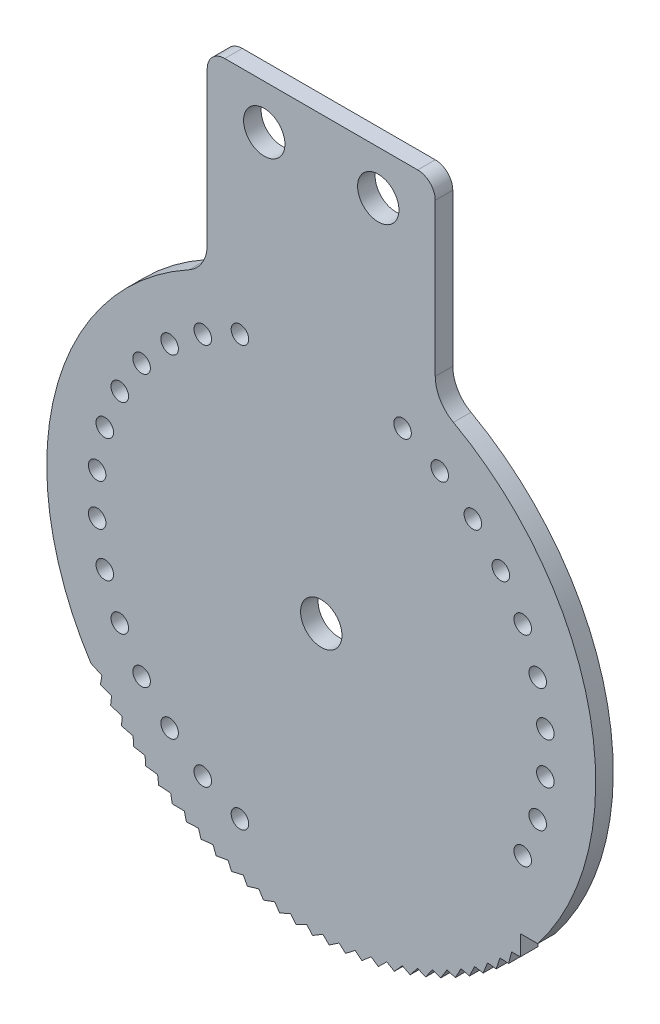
ISO-10303-21;
HEADER;
FILE_DESCRIPTION(('STEP AP214'),'2;1');
FILE_NAME('part.step','',(''),(''),'','','');
FILE_SCHEMA(('AUTOMOTIVE_DESIGN { 1 0 10303 214 1 1 1 1 }'));
ENDSEC;
DATA;
#1=APPLICATION_CONTEXT('core data for automotive mechanical design processes');
#2=APPLICATION_PROTOCOL_DEFINITION('international standard','automotive_design',2000,#1);
#3=PRODUCT_CONTEXT('',#1,'mechanical');
#4=PRODUCT('Part','Part','',(#3));
#5=PRODUCT_RELATED_PRODUCT_CATEGORY('part','',(#4));
#6=PRODUCT_DEFINITION_FORMATION('','',#4);
#7=PRODUCT_DEFINITION_CONTEXT('part definition',#1,'design');
#8=PRODUCT_DEFINITION('design','',#6,#7);
#9=PRODUCT_DEFINITION_SHAPE('','',#8);
#10=(LENGTH_UNIT() NAMED_UNIT(*) SI_UNIT(.MILLI.,.METRE.));
#11=(NAMED_UNIT(*) PLANE_ANGLE_UNIT() SI_UNIT($,.RADIAN.));
#12=(NAMED_UNIT(*) SI_UNIT($,.STERADIAN.) SOLID_ANGLE_UNIT());
#13=UNCERTAINTY_MEASURE_WITH_UNIT(LENGTH_MEASURE(1.E-05),#10,'distance_accuracy_value','');
#14=(GEOMETRIC_REPRESENTATION_CONTEXT(3) GLOBAL_UNCERTAINTY_ASSIGNED_CONTEXT((#13)) GLOBAL_UNIT_ASSIGNED_CONTEXT((#10,
#11,#12)) REPRESENTATION_CONTEXT('',''));
#15=CARTESIAN_POINT('',(0.,0.,0.));
#16=DIRECTION('',(0.,0.,1.));
#17=DIRECTION('',(1.,0.,0.));
#18=AXIS2_PLACEMENT_3D('',#15,#16,#17);
#19=CARTESIAN_POINT('',(14.3366294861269,50.5569351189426,2.54));
#20=DIRECTION('',(0.,0.,-1.));
#21=DIRECTION('',(-1.,0.,0.));
#22=AXIS2_PLACEMENT_3D('',#19,#20,#21);
#23=CYLINDRICAL_SURFACE('',#22,2.54);
#24=CARTESIAN_POINT('',(14.3366294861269,50.5569351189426,0.));
#25=DIRECTION('',(0.,0.,1.));
#26=DIRECTION('',(1.,0.,0.));
#27=AXIS2_PLACEMENT_3D('',#24,#25,#26);
#28=CIRCLE('',#27,2.54);
#29=CARTESIAN_POINT('',(14.3366294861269,53.0969351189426,0.));
#30=VERTEX_POINT('',#29);
#31=CARTESIAN_POINT('',(16.8766294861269,50.5569351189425,0.));
#32=VERTEX_POINT('',#31);
#33=EDGE_CURVE('E587',#30,#32,#28,.F.);
#34=ORIENTED_EDGE('',*,*,#33,.F.);
#35=DIRECTION('',(0.,0.,-1.));
#36=VECTOR('',#35,1.);
#37=CARTESIAN_POINT('',(14.3366294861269,53.0969351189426,2.54));
#38=LINE('',#37,#36);
#39=CARTESIAN_POINT('',(14.3366294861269,53.0969351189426,2.54));
#40=VERTEX_POINT('',#39);
#41=EDGE_CURVE('E11',#40,#30,#38,.T.);
#42=ORIENTED_EDGE('',*,*,#41,.F.);
#43=CARTESIAN_POINT('',(14.3366294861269,50.5569351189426,2.54));
#44=DIRECTION('',(0.,0.,1.));
#45=DIRECTION('',(1.,0.,0.));
#46=AXIS2_PLACEMENT_3D('',#43,#44,#45);
#47=CIRCLE('',#46,2.54);
#48=CARTESIAN_POINT('',(16.8766294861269,50.5569351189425,2.54));
#49=VERTEX_POINT('',#48);
#50=EDGE_CURVE('E875',#40,#49,#47,.F.);
#51=ORIENTED_EDGE('',*,*,#50,.T.);
#52=DIRECTION('',(0.,0.,-1.));
#53=VECTOR('',#52,1.);
#54=CARTESIAN_POINT('',(16.8766294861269,50.5569351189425,2.54));
#55=LINE('',#54,#53);
#56=EDGE_CURVE('E273',#49,#32,#55,.T.);
#57=ORIENTED_EDGE('',*,*,#56,.T.);
#58=EDGE_LOOP('',(#34,#42,#51,#57));
#59=FACE_BOUND('',#58,.T.);
#60=ADVANCED_FACE('F34',(#59),#23,.T.);
#61=CARTESIAN_POINT('',(0.,53.0969351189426,2.54));
#62=DIRECTION('',(0.,1.,0.));
#63=DIRECTION('',(0.,0.,1.));
#64=AXIS2_PLACEMENT_3D('',#61,#62,#63);
#65=PLANE('',#64);
#66=DIRECTION('',(1.,0.,0.));
#67=VECTOR('',#66,1.);
#68=CARTESIAN_POINT('',(0.,53.0969351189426,0.));
#69=LINE('',#68,#67);
#70=CARTESIAN_POINT('',(-13.5890445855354,53.0969351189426,0.));
#71=VERTEX_POINT('',#70);
#72=EDGE_CURVE('E590',#71,#30,#69,.T.);
#73=ORIENTED_EDGE('',*,*,#72,.F.);
#74=DIRECTION('',(0.,0.,-1.));
#75=VECTOR('',#74,1.);
#76=CARTESIAN_POINT('',(-13.5890445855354,53.0969351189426,2.54));
#77=LINE('',#76,#75);
#78=CARTESIAN_POINT('',(-13.5890445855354,53.0969351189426,2.54));
#79=VERTEX_POINT('',#78);
#80=EDGE_CURVE('E42',#79,#71,#77,.T.);
#81=ORIENTED_EDGE('',*,*,#80,.F.);
#82=DIRECTION('',(1.,0.,0.));
#83=VECTOR('',#82,1.);
#84=CARTESIAN_POINT('',(0.,53.0969351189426,2.54));
#85=LINE('',#84,#83);
#86=EDGE_CURVE('E1024',#79,#40,#85,.T.);
#87=ORIENTED_EDGE('',*,*,#86,.T.);
#88=ORIENTED_EDGE('',*,*,#41,.T.);
#89=EDGE_LOOP('',(#73,#81,#87,#88));
#90=FACE_BOUND('',#89,.T.);
#91=ADVANCED_FACE('F1023',(#90),#65,.T.);
#92=CARTESIAN_POINT('',(-13.5890445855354,50.5569351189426,2.54));
#93=DIRECTION('',(0.,0.,-1.));
#94=DIRECTION('',(-1.,0.,0.));
#95=AXIS2_PLACEMENT_3D('',#92,#93,#94);
#96=CYLINDRICAL_SURFACE('',#95,2.54);
#97=CARTESIAN_POINT('',(-13.5890445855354,50.5569351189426,0.));
#98=DIRECTION('',(0.,0.,1.));
#99=DIRECTION('',(1.,0.,0.));
#100=AXIS2_PLACEMENT_3D('',#97,#98,#99);
#101=CIRCLE('',#100,2.54);
#102=CARTESIAN_POINT('',(-16.1290445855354,50.5569351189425,0.));
#103=VERTEX_POINT('',#102);
#104=EDGE_CURVE('E593',#71,#103,#101,.T.);
#105=ORIENTED_EDGE('',*,*,#104,.T.);
#106=DIRECTION('',(0.,0.,-1.));
#107=VECTOR('',#106,1.);
#108=CARTESIAN_POINT('',(-16.1290445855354,50.5569351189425,2.54));
#109=LINE('',#108,#107);
#110=CARTESIAN_POINT('',(-16.1290445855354,50.5569351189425,2.54));
#111=VERTEX_POINT('',#110);
#112=EDGE_CURVE('E1008',#111,#103,#109,.T.);
#113=ORIENTED_EDGE('',*,*,#112,.F.);
#114=CARTESIAN_POINT('',(-13.5890445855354,50.5569351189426,2.54));
#115=DIRECTION('',(0.,0.,1.));
#116=DIRECTION('',(1.,0.,0.));
#117=AXIS2_PLACEMENT_3D('',#114,#115,#116);
#118=CIRCLE('',#117,2.54);
#119=EDGE_CURVE('E1014',#79,#111,#118,.T.);
#120=ORIENTED_EDGE('',*,*,#119,.F.);
#121=ORIENTED_EDGE('',*,*,#80,.T.);
#122=EDGE_LOOP('',(#105,#113,#120,#121));
#123=FACE_BOUND('',#122,.T.);
#124=ADVANCED_FACE('F1012',(#123),#96,.T.);
#125=CARTESIAN_POINT('',(-16.1290445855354,0.,2.54));
#126=DIRECTION('',(-1.,0.,0.));
#127=DIRECTION('',(0.,-1.,0.));
#128=AXIS2_PLACEMENT_3D('',#125,#126,#127);
#129=PLANE('',#128);
#130=DIRECTION('',(0.,1.,0.));
#131=VECTOR('',#130,1.);
#132=CARTESIAN_POINT('',(-16.1290445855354,0.,0.));
#133=LINE('',#132,#131);
#134=CARTESIAN_POINT('',(-16.1290445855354,28.4861243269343,0.));
#135=VERTEX_POINT('',#134);
#136=EDGE_CURVE('E596',#135,#103,#133,.T.);
#137=ORIENTED_EDGE('',*,*,#136,.F.);
#138=DIRECTION('',(0.,0.,-1.));
#139=VECTOR('',#138,1.);
#140=CARTESIAN_POINT('',(-16.1290445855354,28.4861243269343,2.54));
#141=LINE('',#140,#139);
#142=CARTESIAN_POINT('',(-16.1290445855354,28.4861243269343,2.54));
#143=VERTEX_POINT('',#142);
#144=EDGE_CURVE('E1006',#143,#135,#141,.T.);
#145=ORIENTED_EDGE('',*,*,#144,.F.);
#146=DIRECTION('',(0.,1.,0.));
#147=VECTOR('',#146,1.);
#148=CARTESIAN_POINT('',(-16.1290445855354,0.,2.54));
#149=LINE('',#148,#147);
#150=EDGE_CURVE('E1032',#143,#111,#149,.T.);
#151=ORIENTED_EDGE('',*,*,#150,.T.);
#152=ORIENTED_EDGE('',*,*,#112,.T.);
#153=EDGE_LOOP('',(#137,#145,#151,#152));
#154=FACE_BOUND('',#153,.T.);
#155=ADVANCED_FACE('F1478',(#154),#129,.T.);
#156=CARTESIAN_POINT('',(-21.2090445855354,28.4861243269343,2.54));
#157=DIRECTION('',(0.,0.,-1.));
#158=DIRECTION('',(-1.,0.,0.));
#159=AXIS2_PLACEMENT_3D('',#156,#157,#158);
#160=CYLINDRICAL_SURFACE('',#159,5.08);
#161=CARTESIAN_POINT('',(-21.2090445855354,28.4861243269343,0.));
#162=DIRECTION('',(0.,0.,1.));
#163=DIRECTION('',(1.,0.,0.));
#164=AXIS2_PLACEMENT_3D('',#161,#162,#163);
#165=CIRCLE('',#164,5.08);
#166=CARTESIAN_POINT('',(-18.7622719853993,24.0341917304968,0.));
#167=VERTEX_POINT('',#166);
#168=EDGE_CURVE('E599',#167,#135,#165,.T.);
#169=ORIENTED_EDGE('',*,*,#168,.F.);
#170=DIRECTION('',(0.,0.,-1.));
#171=VECTOR('',#170,1.);
#172=CARTESIAN_POINT('',(-18.7622719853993,24.0341917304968,2.54));
#173=LINE('',#172,#171);
#174=CARTESIAN_POINT('',(-18.7622719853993,24.0341917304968,2.54));
#175=VERTEX_POINT('',#174);
#176=EDGE_CURVE('E1004',#175,#167,#173,.T.);
#177=ORIENTED_EDGE('',*,*,#176,.F.);
#178=CARTESIAN_POINT('',(-21.2090445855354,28.4861243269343,2.54));
#179=DIRECTION('',(0.,0.,1.));
#180=DIRECTION('',(1.,0.,0.));
#181=AXIS2_PLACEMENT_3D('',#178,#179,#180);
#182=CIRCLE('',#181,5.08);
#183=EDGE_CURVE('E1035',#175,#143,#182,.T.);
#184=ORIENTED_EDGE('',*,*,#183,.T.);
#185=ORIENTED_EDGE('',*,*,#144,.T.);
#186=EDGE_LOOP('',(#169,#177,#184,#185));
#187=FACE_BOUND('',#186,.T.);
#188=ADVANCED_FACE('F1475',(#187),#160,.F.);
#189=CARTESIAN_POINT('',(0.373792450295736,-10.784110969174,2.54));
#190=DIRECTION('',(0.,0.,-1.));
#191=DIRECTION('',(-1.,0.,0.));
#192=AXIS2_PLACEMENT_3D('',#189,#190,#191);
#193=CYLINDRICAL_SURFACE('',#192,39.7303808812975);
#194=CARTESIAN_POINT('',(0.373792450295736,-10.784110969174,0.));
#195=DIRECTION('',(0.,0.,1.));
#196=DIRECTION('',(1.,0.,0.));
#197=AXIS2_PLACEMENT_3D('',#194,#195,#196);
#198=CIRCLE('',#197,39.7303808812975);
#199=CARTESIAN_POINT('',(-32.9575686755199,-32.4064034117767,0.));
#200=VERTEX_POINT('',#199);
#201=EDGE_CURVE('E602',#200,#167,#198,.F.);
#202=ORIENTED_EDGE('',*,*,#201,.F.);
#203=DIRECTION('',(0.,0.,-1.));
#204=VECTOR('',#203,1.);
#205=CARTESIAN_POINT('',(-32.9575686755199,-32.4064034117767,2.54));
#206=LINE('',#205,#204);
#207=CARTESIAN_POINT('',(-32.9575686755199,-32.4064034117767,2.54));
#208=VERTEX_POINT('',#207);
#209=EDGE_CURVE('E1002',#208,#200,#206,.T.);
#210=ORIENTED_EDGE('',*,*,#209,.F.);
#211=CARTESIAN_POINT('',(0.373792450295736,-10.784110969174,2.54));
#212=DIRECTION('',(0.,0.,1.));
#213=DIRECTION('',(1.,0.,0.));
#214=AXIS2_PLACEMENT_3D('',#211,#212,#213);
#215=CIRCLE('',#214,39.7303808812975);
#216=EDGE_CURVE('E1038',#208,#175,#215,.F.);
#217=ORIENTED_EDGE('',*,*,#216,.T.);
#218=ORIENTED_EDGE('',*,*,#176,.T.);
#219=EDGE_LOOP('',(#202,#210,#217,#218));
#220=FACE_BOUND('',#219,.T.);
#221=ADVANCED_FACE('F1470',(#220),#193,.T.);
#222=CARTESIAN_POINT('',(-17.9414486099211,-39.2673446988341,2.54));
#223=DIRECTION('',(0.415580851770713,0.909556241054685,0.));
#224=DIRECTION('',(-0.909556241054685,0.415580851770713,0.));
#225=AXIS2_PLACEMENT_3D('',#222,#223,#224);
#226=PLANE('',#225);
#227=DIRECTION('',(0.909556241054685,-0.415580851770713,0.));
#228=VECTOR('',#227,1.);
#229=CARTESIAN_POINT('',(-17.9414486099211,-39.2673446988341,0.));
#230=LINE('',#229,#228);
#231=CARTESIAN_POINT('',(-31.3752381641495,-33.1293782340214,0.));
#232=VERTEX_POINT('',#231);
#233=EDGE_CURVE('E605',#200,#232,#230,.T.);
#234=ORIENTED_EDGE('',*,*,#233,.T.);
#235=DIRECTION('',(0.,0.,-1.));
#236=VECTOR('',#235,1.);
#237=CARTESIAN_POINT('',(-31.3752381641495,-33.1293782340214,2.54));
#238=LINE('',#237,#236);
#239=CARTESIAN_POINT('',(-31.3752381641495,-33.1293782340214,2.54));
#240=VERTEX_POINT('',#239);
#241=EDGE_CURVE('E1000',#240,#232,#238,.T.);
#242=ORIENTED_EDGE('',*,*,#241,.F.);
#243=DIRECTION('',(0.909556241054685,-0.415580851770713,0.));
#244=VECTOR('',#243,1.);
#245=CARTESIAN_POINT('',(-17.9414486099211,-39.2673446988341,2.54));
#246=LINE('',#245,#244);
#247=EDGE_CURVE('E1041',#208,#240,#246,.T.);
#248=ORIENTED_EDGE('',*,*,#247,.F.);
#249=ORIENTED_EDGE('',*,*,#209,.T.);
#250=EDGE_LOOP('',(#234,#242,#248,#249));
#251=FACE_BOUND('',#250,.T.);
#252=ADVANCED_FACE('F1467',(#251),#226,.F.);
#253=CARTESIAN_POINT('',(-24.7637016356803,4.3665087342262,2.54));
#254=DIRECTION('',(-0.984807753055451,0.173648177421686,0.));
#255=DIRECTION('',(-0.173648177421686,-0.984807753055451,0.));
#256=AXIS2_PLACEMENT_3D('',#253,#254,#255);
#257=PLANE('',#256);
#258=DIRECTION('',(0.173648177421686,0.984807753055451,0.));
#259=VECTOR('',#258,1.);
#260=CARTESIAN_POINT('',(-24.7637016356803,4.3665087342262,0.));
#261=LINE('',#260,#259);
#262=CARTESIAN_POINT('',(-31.594342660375,-34.3719815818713,0.));
#263=VERTEX_POINT('',#262);
#264=EDGE_CURVE('E608',#263,#232,#261,.T.);
#265=ORIENTED_EDGE('',*,*,#264,.F.);
#266=DIRECTION('',(0.,0.,-1.));
#267=VECTOR('',#266,1.);
#268=CARTESIAN_POINT('',(-31.594342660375,-34.3719815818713,2.54));
#269=LINE('',#268,#267);
#270=CARTESIAN_POINT('',(-31.594342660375,-34.3719815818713,2.54));
#271=VERTEX_POINT('',#270);
#272=EDGE_CURVE('E998',#271,#263,#269,.T.);
#273=ORIENTED_EDGE('',*,*,#272,.F.);
#274=DIRECTION('',(0.173648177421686,0.984807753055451,0.));
#275=VECTOR('',#274,1.);
#276=CARTESIAN_POINT('',(-24.7637016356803,4.3665087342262,2.54));
#277=LINE('',#276,#275);
#278=EDGE_CURVE('E1043',#271,#240,#277,.T.);
#279=ORIENTED_EDGE('',*,*,#278,.T.);
#280=ORIENTED_EDGE('',*,*,#241,.T.);
#281=EDGE_LOOP('',(#265,#273,#279,#280));
#282=FACE_BOUND('',#281,.T.);
#283=ADVANCED_FACE('F1462',(#282),#257,.T.);
#284=CARTESIAN_POINT('',(-15.6449509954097,-40.5287783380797,2.54));
#285=DIRECTION('',(0.360120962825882,0.932905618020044,0.));
#286=DIRECTION('',(-0.932905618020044,0.360120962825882,0.));
#287=AXIS2_PLACEMENT_3D('',#284,#285,#286);
#288=PLANE('',#287);
#289=DIRECTION('',(0.932905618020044,-0.360120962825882,0.));
#290=VECTOR('',#289,1.);
#291=CARTESIAN_POINT('',(-15.6449509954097,-40.5287783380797,0.));
#292=LINE('',#291,#290);
#293=CARTESIAN_POINT('',(-29.9713918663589,-34.9984743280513,0.));
#294=VERTEX_POINT('',#293);
#295=EDGE_CURVE('E611',#263,#294,#292,.T.);
#296=ORIENTED_EDGE('',*,*,#295,.T.);
#297=DIRECTION('',(0.,0.,-1.));
#298=VECTOR('',#297,1.);
#299=CARTESIAN_POINT('',(-29.9713918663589,-34.9984743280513,2.54));
#300=LINE('',#299,#298);
#301=CARTESIAN_POINT('',(-29.9713918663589,-34.9984743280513,2.54));
#302=VERTEX_POINT('',#301);
#303=EDGE_CURVE('E996',#302,#294,#300,.T.);
#304=ORIENTED_EDGE('',*,*,#303,.F.);
#305=DIRECTION('',(0.932905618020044,-0.360120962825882,0.));
#306=VECTOR('',#305,1.);
#307=CARTESIAN_POINT('',(-15.6449509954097,-40.5287783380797,2.54));
#308=LINE('',#307,#306);
#309=EDGE_CURVE('E1046',#271,#302,#308,.T.);
#310=ORIENTED_EDGE('',*,*,#309,.F.);
#311=ORIENTED_EDGE('',*,*,#272,.T.);
#312=EDGE_LOOP('',(#296,#304,#310,#311));
#313=FACE_BOUND('',#312,.T.);
#314=ADVANCED_FACE('F1458',(#313),#288,.F.);
#315=CARTESIAN_POINT('',(-25.6139484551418,2.9417665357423,2.54));
#316=DIRECTION('',(-0.9934692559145,0.114100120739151,0.));
#317=DIRECTION('',(-0.114100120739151,-0.993469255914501,0.));
#318=AXIS2_PLACEMENT_3D('',#315,#316,#317);
#319=PLANE('',#318);
#320=DIRECTION('',(0.114100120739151,0.9934692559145,0.));
#321=VECTOR('',#320,1.);
#322=CARTESIAN_POINT('',(-25.6139484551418,2.9417665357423,0.));
#323=LINE('',#322,#321);
#324=CARTESIAN_POINT('',(-30.1153602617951,-36.2520065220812,0.));
#325=VERTEX_POINT('',#324);
#326=EDGE_CURVE('E614',#325,#294,#323,.T.);
#327=ORIENTED_EDGE('',*,*,#326,.F.);
#328=DIRECTION('',(0.,0.,-1.));
#329=VECTOR('',#328,1.);
#330=CARTESIAN_POINT('',(-30.1153602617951,-36.2520065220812,2.54));
#331=LINE('',#330,#329);
#332=CARTESIAN_POINT('',(-30.1153602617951,-36.2520065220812,2.54));
#333=VERTEX_POINT('',#332);
#334=EDGE_CURVE('E994',#333,#325,#331,.T.);
#335=ORIENTED_EDGE('',*,*,#334,.F.);
#336=DIRECTION('',(0.114100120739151,0.9934692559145,0.));
#337=VECTOR('',#336,1.);
#338=CARTESIAN_POINT('',(-25.6139484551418,2.9417665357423,2.54));
#339=LINE('',#338,#337);
#340=EDGE_CURVE('E1048',#333,#302,#339,.T.);
#341=ORIENTED_EDGE('',*,*,#340,.T.);
#342=ORIENTED_EDGE('',*,*,#303,.T.);
#343=EDGE_LOOP('',(#327,#335,#341,#342));
#344=FACE_BOUND('',#343,.T.);
#345=ADVANCED_FACE('F1453',(#344),#319,.T.);
#346=CARTESIAN_POINT('',(-13.2504579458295,-41.6211021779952,2.54));
#347=DIRECTION('',(0.303357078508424,0.95287695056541,0.));
#348=DIRECTION('',(-0.95287695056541,0.303357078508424,0.));
#349=AXIS2_PLACEMENT_3D('',#346,#347,#348);
#350=PLANE('',#349);
#351=DIRECTION('',(0.95287695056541,-0.303357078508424,0.));
#352=VECTOR('',#351,1.);
#353=CARTESIAN_POINT('',(-13.2504579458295,-41.6211021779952,0.));
#354=LINE('',#353,#352);
#355=CARTESIAN_POINT('',(-28.4576658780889,-36.7797486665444,0.));
#356=VERTEX_POINT('',#355);
#357=EDGE_CURVE('E617',#325,#356,#354,.T.);
#358=ORIENTED_EDGE('',*,*,#357,.T.);
#359=DIRECTION('',(0.,0.,-1.));
#360=VECTOR('',#359,1.);
#361=CARTESIAN_POINT('',(-28.4576658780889,-36.7797486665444,2.54));
#362=LINE('',#361,#360);
#363=CARTESIAN_POINT('',(-28.4576658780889,-36.7797486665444,2.54));
#364=VERTEX_POINT('',#363);
#365=EDGE_CURVE('E992',#364,#356,#362,.T.);
#366=ORIENTED_EDGE('',*,*,#365,.F.);
#367=DIRECTION('',(0.95287695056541,-0.303357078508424,0.));
#368=VECTOR('',#367,1.);
#369=CARTESIAN_POINT('',(-13.2504579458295,-41.6211021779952,2.54));
#370=LINE('',#369,#368);
#371=EDGE_CURVE('E1051',#333,#364,#370,.T.);
#372=ORIENTED_EDGE('',*,*,#371,.F.);
#373=ORIENTED_EDGE('',*,*,#334,.T.);
#374=EDGE_LOOP('',(#358,#366,#372,#373));
#375=FACE_BOUND('',#374,.T.);
#376=ADVANCED_FACE('F1449',(#375),#350,.F.);
#377=CARTESIAN_POINT('',(-26.3859606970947,1.43060521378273,2.54));
#378=DIRECTION('',(-0.998533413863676,0.054138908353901,0.));
#379=DIRECTION('',(-0.054138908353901,-0.998533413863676,0.));
#380=AXIS2_PLACEMENT_3D('',#377,#378,#379);
#381=PLANE('',#380);
#382=DIRECTION('',(0.054138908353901,0.998533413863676,0.));
#383=VECTOR('',#382,1.);
#384=CARTESIAN_POINT('',(-26.3859606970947,1.43060521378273,0.));
#385=LINE('',#384,#383);
#386=CARTESIAN_POINT('',(-28.5259768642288,-38.0396706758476,0.));
#387=VERTEX_POINT('',#386);
#388=EDGE_CURVE('E620',#387,#356,#385,.T.);
#389=ORIENTED_EDGE('',*,*,#388,.F.);
#390=DIRECTION('',(0.,0.,-1.));
#391=VECTOR('',#390,1.);
#392=CARTESIAN_POINT('',(-28.5259768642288,-38.0396706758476,2.54));
#393=LINE('',#392,#391);
#394=CARTESIAN_POINT('',(-28.5259768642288,-38.0396706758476,2.54));
#395=VERTEX_POINT('',#394);
#396=EDGE_CURVE('E990',#395,#387,#393,.T.);
#397=ORIENTED_EDGE('',*,*,#396,.F.);
#398=DIRECTION('',(0.054138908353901,0.998533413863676,0.));
#399=VECTOR('',#398,1.);
#400=CARTESIAN_POINT('',(-26.3859606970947,1.43060521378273,2.54));
#401=LINE('',#400,#399);
#402=EDGE_CURVE('E1053',#395,#364,#401,.T.);
#403=ORIENTED_EDGE('',*,*,#402,.T.);
#404=ORIENTED_EDGE('',*,*,#365,.T.);
#405=EDGE_LOOP('',(#389,#397,#403,#404));
#406=FACE_BOUND('',#405,.T.);
#407=ADVANCED_FACE('F1444',(#406),#381,.T.);
#408=CARTESIAN_POINT('',(-10.7719544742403,-42.5357800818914,2.54));
#409=DIRECTION('',(0.245494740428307,0.969397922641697,0.));
#410=DIRECTION('',(-0.969397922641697,0.245494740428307,0.));
#411=AXIS2_PLACEMENT_3D('',#408,#409,#410);
#412=PLANE('',#411);
#413=DIRECTION('',(0.969397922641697,-0.245494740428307,0.));
#414=VECTOR('',#413,1.);
#415=CARTESIAN_POINT('',(-10.7719544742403,-42.5357800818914,0.));
#416=LINE('',#415,#414);
#417=CARTESIAN_POINT('',(-26.8395413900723,-38.4667512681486,0.));
#418=VERTEX_POINT('',#417);
#419=EDGE_CURVE('E623',#387,#418,#416,.T.);
#420=ORIENTED_EDGE('',*,*,#419,.T.);
#421=DIRECTION('',(0.,0.,-1.));
#422=VECTOR('',#421,1.);
#423=CARTESIAN_POINT('',(-26.8395413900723,-38.4667512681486,2.54));
#424=LINE('',#423,#422);
#425=CARTESIAN_POINT('',(-26.8395413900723,-38.4667512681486,2.54));
#426=VERTEX_POINT('',#425);
#427=EDGE_CURVE('E988',#426,#418,#424,.T.);
#428=ORIENTED_EDGE('',*,*,#427,.F.);
#429=DIRECTION('',(0.969397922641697,-0.245494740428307,0.));
#430=VECTOR('',#429,1.);
#431=CARTESIAN_POINT('',(-10.7719544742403,-42.5357800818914,2.54));
#432=LINE('',#431,#430);
#433=EDGE_CURVE('E1056',#395,#426,#432,.T.);
#434=ORIENTED_EDGE('',*,*,#433,.F.);
#435=ORIENTED_EDGE('',*,*,#396,.T.);
#436=EDGE_LOOP('',(#420,#428,#434,#435));
#437=FACE_BOUND('',#436,.T.);
#438=ADVANCED_FACE('F1440',(#437),#412,.F.);
#439=CARTESIAN_POINT('',(-27.070071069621,-0.162919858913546,2.54));
#440=DIRECTION('',(-0.999981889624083,-0.00601834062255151,0.));
#441=DIRECTION('',(0.00601834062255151,-0.999981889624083,0.));
#442=AXIS2_PLACEMENT_3D('',#439,#440,#441);
#443=PLANE('',#442);
#444=DIRECTION('',(-0.00601834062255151,0.999981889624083,0.));
#445=VECTOR('',#444,1.);
#446=CARTESIAN_POINT('',(-27.070071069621,-0.162919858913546,0.));
#447=LINE('',#446,#445);
#448=CARTESIAN_POINT('',(-26.8319476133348,-39.7285009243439,0.));
#449=VERTEX_POINT('',#448);
#450=EDGE_CURVE('E626',#449,#418,#447,.T.);
#451=ORIENTED_EDGE('',*,*,#450,.F.);
#452=DIRECTION('',(0.,0.,-1.));
#453=VECTOR('',#452,1.);
#454=CARTESIAN_POINT('',(-26.8319476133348,-39.7285009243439,2.54));
#455=LINE('',#454,#453);
#456=CARTESIAN_POINT('',(-26.8319476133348,-39.7285009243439,2.54));
#457=VERTEX_POINT('',#456);
#458=EDGE_CURVE('E986',#457,#449,#455,.T.);
#459=ORIENTED_EDGE('',*,*,#458,.F.);
#460=DIRECTION('',(-0.00601834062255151,0.999981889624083,0.));
#461=VECTOR('',#460,1.);
#462=CARTESIAN_POINT('',(-27.070071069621,-0.162919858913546,2.54));
#463=LINE('',#462,#461);
#464=EDGE_CURVE('E1058',#457,#426,#463,.T.);
#465=ORIENTED_EDGE('',*,*,#464,.T.);
#466=ORIENTED_EDGE('',*,*,#427,.T.);
#467=EDGE_LOOP('',(#451,#459,#465,#466));
#468=FACE_BOUND('',#467,.T.);
#469=ADVANCED_FACE('F1435',(#468),#443,.T.);
#470=CARTESIAN_POINT('',(-8.22424139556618,-43.2655904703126,2.54));
#471=DIRECTION('',(0.186743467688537,0.982408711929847,0.));
#472=DIRECTION('',(-0.982408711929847,0.186743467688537,0.));
#473=AXIS2_PLACEMENT_3D('',#470,#471,#472);
#474=PLANE('',#473);
#475=DIRECTION('',(0.982408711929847,-0.186743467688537,0.));
#476=VECTOR('',#475,1.);
#477=CARTESIAN_POINT('',(-8.22424139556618,-43.2655904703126,0.));
#478=LINE('',#477,#476);
#479=CARTESIAN_POINT('',(-25.122877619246,-40.0533735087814,0.));
#480=VERTEX_POINT('',#479);
#481=EDGE_CURVE('E629',#449,#480,#478,.T.);
#482=ORIENTED_EDGE('',*,*,#481,.T.);
#483=DIRECTION('',(0.,0.,-1.));
#484=VECTOR('',#483,1.);
#485=CARTESIAN_POINT('',(-25.122877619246,-40.0533735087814,2.54));
#486=LINE('',#485,#484);
#487=CARTESIAN_POINT('',(-25.122877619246,-40.0533735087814,2.54));
#488=VERTEX_POINT('',#487);
#489=EDGE_CURVE('E984',#488,#480,#486,.T.);
#490=ORIENTED_EDGE('',*,*,#489,.F.);
#491=DIRECTION('',(0.982408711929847,-0.186743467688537,0.));
#492=VECTOR('',#491,1.);
#493=CARTESIAN_POINT('',(-8.22424139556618,-43.2655904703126,2.54));
#494=LINE('',#493,#492);
#495=EDGE_CURVE('E1061',#457,#488,#494,.T.);
#496=ORIENTED_EDGE('',*,*,#495,.F.);
#497=ORIENTED_EDGE('',*,*,#458,.T.);
#498=EDGE_LOOP('',(#482,#490,#496,#497));
#499=FACE_BOUND('',#498,.T.);
#500=ADVANCED_FACE('F1431',(#499),#474,.F.);
#501=CARTESIAN_POINT('',(-27.6568102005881,-1.83361967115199,2.54));
#502=DIRECTION('',(-0.997809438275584,-0.0661537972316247,0.));
#503=DIRECTION('',(0.0661537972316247,-0.997809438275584,0.));
#504=AXIS2_PLACEMENT_3D('',#501,#502,#503);
#505=PLANE('',#504);
#506=DIRECTION('',(-0.0661537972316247,0.997809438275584,0.));
#507=VECTOR('',#506,1.);
#508=CARTESIAN_POINT('',(-27.6568102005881,-1.83361967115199,0.));
#509=LINE('',#508,#507);
#510=CARTESIAN_POINT('',(-25.039406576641,-41.3123820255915,0.));
#511=VERTEX_POINT('',#510);
#512=EDGE_CURVE('E632',#511,#480,#509,.T.);
#513=ORIENTED_EDGE('',*,*,#512,.F.);
#514=DIRECTION('',(0.,0.,-1.));
#515=VECTOR('',#514,1.);
#516=CARTESIAN_POINT('',(-25.039406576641,-41.3123820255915,2.54));
#517=LINE('',#516,#515);
#518=CARTESIAN_POINT('',(-25.039406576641,-41.3123820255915,2.54));
#519=VERTEX_POINT('',#518);
#520=EDGE_CURVE('E982',#519,#511,#517,.T.);
#521=ORIENTED_EDGE('',*,*,#520,.F.);
#522=DIRECTION('',(-0.0661537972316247,0.997809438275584,0.));
#523=VECTOR('',#522,1.);
#524=CARTESIAN_POINT('',(-27.6568102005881,-1.83361967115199,2.54));
#525=LINE('',#524,#523);
#526=EDGE_CURVE('E1063',#519,#488,#525,.T.);
#527=ORIENTED_EDGE('',*,*,#526,.T.);
#528=ORIENTED_EDGE('',*,*,#489,.T.);
#529=EDGE_LOOP('',(#513,#521,#527,#528));
#530=FACE_BOUND('',#529,.T.);
#531=ADVANCED_FACE('F1426',(#530),#505,.T.);
#532=CARTESIAN_POINT('',(-5.62279742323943,-43.8047090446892,2.54));
#533=DIRECTION('',(0.12731599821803,0.991862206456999,0.));
#534=DIRECTION('',(-0.991862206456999,0.12731599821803,0.));
#535=AXIS2_PLACEMENT_3D('',#532,#533,#534);
#536=PLANE('',#535);
#537=DIRECTION('',(0.991862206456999,-0.12731599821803,0.));
#538=VECTOR('',#537,1.);
#539=CARTESIAN_POINT('',(-5.62279742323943,-43.8047090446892,0.));
#540=LINE('',#539,#538);
#541=CARTESIAN_POINT('',(-23.3138905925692,-41.5338702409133,0.));
#542=VERTEX_POINT('',#541);
#543=EDGE_CURVE('E635',#511,#542,#540,.T.);
#544=ORIENTED_EDGE('',*,*,#543,.T.);
#545=DIRECTION('',(0.,0.,-1.));
#546=VECTOR('',#545,1.);
#547=CARTESIAN_POINT('',(-23.3138905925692,-41.5338702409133,2.54));
#548=LINE('',#547,#546);
#549=CARTESIAN_POINT('',(-23.3138905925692,-41.5338702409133,2.54));
#550=VERTEX_POINT('',#549);
#551=EDGE_CURVE('E980',#550,#542,#548,.T.);
#552=ORIENTED_EDGE('',*,*,#551,.F.);
#553=DIRECTION('',(0.991862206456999,-0.12731599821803,0.));
#554=VECTOR('',#553,1.);
#555=CARTESIAN_POINT('',(-5.62279742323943,-43.8047090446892,2.54));
#556=LINE('',#555,#554);
#557=EDGE_CURVE('E1066',#519,#550,#556,.T.);
#558=ORIENTED_EDGE('',*,*,#557,.F.);
#559=ORIENTED_EDGE('',*,*,#520,.T.);
#560=EDGE_LOOP('',(#544,#552,#558,#559));
#561=FACE_BOUND('',#560,.T.);
#562=ADVANCED_FACE('F1422',(#561),#536,.F.);
#563=CARTESIAN_POINT('',(-28.1370421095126,-3.57518195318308,2.54));
#564=DIRECTION('',(-0.992023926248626,-0.126049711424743,0.));
#565=DIRECTION('',(0.126049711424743,-0.992023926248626,0.));
#566=AXIS2_PLACEMENT_3D('',#563,#564,#565);
#567=PLANE('',#566);
#568=DIRECTION('',(-0.126049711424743,0.992023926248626,0.));
#569=VECTOR('',#568,1.);
#570=CARTESIAN_POINT('',(-28.1370421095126,-3.57518195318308,0.));
#571=LINE('',#570,#569);
#572=CARTESIAN_POINT('',(-23.1548445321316,-42.7855787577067,0.));
#573=VERTEX_POINT('',#572);
#574=EDGE_CURVE('E638',#573,#542,#571,.T.);
#575=ORIENTED_EDGE('',*,*,#574,.F.);
#576=DIRECTION('',(0.,0.,-1.));
#577=VECTOR('',#576,1.);
#578=CARTESIAN_POINT('',(-23.1548445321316,-42.7855787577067,2.54));
#579=LINE('',#578,#577);
#580=CARTESIAN_POINT('',(-23.1548445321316,-42.7855787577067,2.54));
#581=VERTEX_POINT('',#580);
#582=EDGE_CURVE('E978',#581,#573,#579,.T.);
#583=ORIENTED_EDGE('',*,*,#582,.F.);
#584=DIRECTION('',(-0.126049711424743,0.992023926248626,0.));
#585=VECTOR('',#584,1.);
#586=CARTESIAN_POINT('',(-28.1370421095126,-3.57518195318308,2.54));
#587=LINE('',#586,#585);
#588=EDGE_CURVE('E1068',#581,#550,#587,.T.);
#589=ORIENTED_EDGE('',*,*,#588,.T.);
#590=ORIENTED_EDGE('',*,*,#551,.T.);
#591=EDGE_LOOP('',(#575,#583,#589,#590));
#592=FACE_BOUND('',#591,.T.);
#593=ADVANCED_FACE('F1417',(#592),#567,.T.);
#594=CARTESIAN_POINT('',(-2.98363262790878,-44.1487759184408,2.54));
#595=DIRECTION('',(0.0674275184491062,0.997724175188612,0.));
#596=DIRECTION('',(-0.997724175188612,0.0674275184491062,0.));
#597=AXIS2_PLACEMENT_3D('',#594,#595,#596);
#598=PLANE('',#597);
#599=DIRECTION('',(0.997724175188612,-0.0674275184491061,0.));
#600=VECTOR('',#599,1.);
#601=CARTESIAN_POINT('',(-2.98363262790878,-44.1487759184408,0.));
#602=LINE('',#601,#600);
#603=CARTESIAN_POINT('',(-21.4191306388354,-42.9028805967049,0.));
#604=VERTEX_POINT('',#603);
#605=EDGE_CURVE('E641',#573,#604,#602,.T.);
#606=ORIENTED_EDGE('',*,*,#605,.T.);
#607=DIRECTION('',(0.,0.,-1.));
#608=VECTOR('',#607,1.);
#609=CARTESIAN_POINT('',(-21.4191306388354,-42.9028805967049,2.54));
#610=LINE('',#609,#608);
#611=CARTESIAN_POINT('',(-21.4191306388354,-42.9028805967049,2.54));
#612=VERTEX_POINT('',#611);
#613=EDGE_CURVE('E976',#612,#604,#610,.T.);
#614=ORIENTED_EDGE('',*,*,#613,.F.);
#615=DIRECTION('',(0.997724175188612,-0.0674275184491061,0.));
#616=VECTOR('',#615,1.);
#617=CARTESIAN_POINT('',(-2.98363262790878,-44.1487759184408,2.54));
#618=LINE('',#617,#616);
#619=EDGE_CURVE('E1071',#581,#612,#618,.T.);
#620=ORIENTED_EDGE('',*,*,#619,.F.);
#621=ORIENTED_EDGE('',*,*,#582,.T.);
#622=EDGE_LOOP('',(#606,#614,#620,#621));
#623=FACE_BOUND('',#622,.T.);
#624=ADVANCED_FACE('F1413',(#623),#598,.F.);
#625=CARTESIAN_POINT('',(-28.502098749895,-5.3801978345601,2.54));
#626=DIRECTION('',(-0.982646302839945,-0.18548920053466,0.));
#627=DIRECTION('',(0.18548920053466,-0.982646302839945,0.));
#628=AXIS2_PLACEMENT_3D('',#625,#626,#627);
#629=PLANE('',#628);
#630=DIRECTION('',(-0.18548920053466,0.982646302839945,0.));
#631=VECTOR('',#630,1.);
#632=CARTESIAN_POINT('',(-28.502098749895,-5.3801978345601,0.));
#633=LINE('',#632,#631);
#634=CARTESIAN_POINT('',(-21.1850854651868,-44.1427566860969,0.));
#635=VERTEX_POINT('',#634);
#636=EDGE_CURVE('E644',#635,#604,#633,.T.);
#637=ORIENTED_EDGE('',*,*,#636,.F.);
#638=DIRECTION('',(0.,0.,-1.));
#639=VECTOR('',#638,1.);
#640=CARTESIAN_POINT('',(-21.1850854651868,-44.1427566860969,2.54));
#641=LINE('',#640,#639);
#642=CARTESIAN_POINT('',(-21.1850854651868,-44.1427566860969,2.54));
#643=VERTEX_POINT('',#642);
#644=EDGE_CURVE('E974',#643,#635,#641,.T.);
#645=ORIENTED_EDGE('',*,*,#644,.F.);
#646=DIRECTION('',(-0.18548920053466,0.982646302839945,0.));
#647=VECTOR('',#646,1.);
#648=CARTESIAN_POINT('',(-28.502098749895,-5.3801978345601,2.54));
#649=LINE('',#648,#647);
#650=EDGE_CURVE('E1073',#643,#612,#649,.T.);
#651=ORIENTED_EDGE('',*,*,#650,.T.);
#652=ORIENTED_EDGE('',*,*,#613,.T.);
#653=EDGE_LOOP('',(#637,#645,#651,#652));
#654=FACE_BOUND('',#653,.T.);
#655=ADVANCED_FACE('F1408',(#654),#629,.T.);
#656=CARTESIAN_POINT('',(-0.323135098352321,-44.2949462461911,2.54));
#657=DIRECTION('',(0.0072948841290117,0.999973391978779,0.));
#658=DIRECTION('',(-0.999973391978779,0.00729488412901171,0.));
#659=AXIS2_PLACEMENT_3D('',#656,#657,#658);
#660=PLANE('',#659);
#661=DIRECTION('',(0.999973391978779,-0.0072948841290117,0.));
#662=VECTOR('',#661,1.);
#663=CARTESIAN_POINT('',(-0.323135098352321,-44.2949462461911,0.));
#664=LINE('',#663,#662);
#665=CARTESIAN_POINT('',(-19.4454586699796,-44.1554473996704,0.));
#666=VERTEX_POINT('',#665);
#667=EDGE_CURVE('E647',#635,#666,#664,.T.);
#668=ORIENTED_EDGE('',*,*,#667,.T.);
#669=DIRECTION('',(0.,0.,-1.));
#670=VECTOR('',#669,1.);
#671=CARTESIAN_POINT('',(-19.4454586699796,-44.1554473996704,2.54));
#672=LINE('',#671,#670);
#673=CARTESIAN_POINT('',(-19.4454586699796,-44.1554473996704,2.54));
#674=VERTEX_POINT('',#673);
#675=EDGE_CURVE('E972',#674,#666,#672,.T.);
#676=ORIENTED_EDGE('',*,*,#675,.F.);
#677=DIRECTION('',(0.999973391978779,-0.0072948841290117,0.));
#678=VECTOR('',#677,1.);
#679=CARTESIAN_POINT('',(-0.323135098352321,-44.2949462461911,2.54));
#680=LINE('',#679,#678);
#681=EDGE_CURVE('E1076',#643,#674,#680,.T.);
#682=ORIENTED_EDGE('',*,*,#681,.F.);
#683=ORIENTED_EDGE('',*,*,#644,.T.);
#684=EDGE_LOOP('',(#668,#676,#682,#683));
#685=FACE_BOUND('',#684,.T.);
#686=ADVANCED_FACE('F1404',(#685),#660,.F.);
#687=CARTESIAN_POINT('',(-28.7439116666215,-7.24020462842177,2.54));
#688=DIRECTION('',(-0.969710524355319,-0.244257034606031,0.));
#689=DIRECTION('',(0.244257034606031,-0.969710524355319,0.));
#690=AXIS2_PLACEMENT_3D('',#687,#688,#689);
#691=PLANE('',#690);
#692=DIRECTION('',(-0.244257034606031,0.969710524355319,0.));
#693=VECTOR('',#692,1.);
#694=CARTESIAN_POINT('',(-28.7439116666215,-7.24020462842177,0.));
#695=LINE('',#694,#693);
#696=CARTESIAN_POINT('',(-19.1372618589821,-45.379001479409,0.));
#697=VERTEX_POINT('',#696);
#698=EDGE_CURVE('E650',#697,#666,#695,.T.);
#699=ORIENTED_EDGE('',*,*,#698,.F.);
#700=DIRECTION('',(0.,0.,-1.));
#701=VECTOR('',#700,1.);
#702=CARTESIAN_POINT('',(-19.1372618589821,-45.379001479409,2.54));
#703=LINE('',#702,#701);
#704=CARTESIAN_POINT('',(-19.1372618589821,-45.379001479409,2.54));
#705=VERTEX_POINT('',#704);
#706=EDGE_CURVE('E970',#705,#697,#703,.T.);
#707=ORIENTED_EDGE('',*,*,#706,.F.);
#708=DIRECTION('',(-0.244257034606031,0.969710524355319,0.));
#709=VECTOR('',#708,1.);
#710=CARTESIAN_POINT('',(-28.7439116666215,-7.24020462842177,2.54));
#711=LINE('',#710,#709);
#712=EDGE_CURVE('E1078',#705,#674,#711,.T.);
#713=ORIENTED_EDGE('',*,*,#712,.T.);
#714=ORIENTED_EDGE('',*,*,#675,.T.);
#715=EDGE_LOOP('',(#699,#707,#713,#714));
#716=FACE_BOUND('',#715,.T.);
#717=ADVANCED_FACE('F1399',(#716),#691,.T.);
#718=CARTESIAN_POINT('',(2.34208726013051,-44.2419236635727,2.54));
#719=DIRECTION('',(-0.0528641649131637,0.998601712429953,0.));
#720=DIRECTION('',(-0.998601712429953,-0.0528641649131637,0.));
#721=AXIS2_PLACEMENT_3D('',#718,#719,#720);
#722=PLANE('',#721);
#723=DIRECTION('',(0.998601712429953,0.0528641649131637,0.));
#724=VECTOR('',#723,1.);
#725=CARTESIAN_POINT('',(2.34208726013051,-44.2419236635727,0.));
#726=LINE('',#725,#724);
#727=CARTESIAN_POINT('',(-17.4000213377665,-45.2870351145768,0.));
#728=VERTEX_POINT('',#727);
#729=EDGE_CURVE('E653',#697,#728,#726,.T.);
#730=ORIENTED_EDGE('',*,*,#729,.T.);
#731=DIRECTION('',(0.,0.,-1.));
#732=VECTOR('',#731,1.);
#733=CARTESIAN_POINT('',(-17.4000213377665,-45.2870351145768,2.54));
#734=LINE('',#733,#732);
#735=CARTESIAN_POINT('',(-17.4000213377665,-45.2870351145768,2.54));
#736=VERTEX_POINT('',#735);
#737=EDGE_CURVE('E968',#736,#728,#734,.T.);
#738=ORIENTED_EDGE('',*,*,#737,.F.);
#739=DIRECTION('',(0.998601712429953,0.0528641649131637,0.));
#740=VECTOR('',#739,1.);
#741=CARTESIAN_POINT('',(2.34208726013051,-44.2419236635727,2.54));
#742=LINE('',#741,#740);
#743=EDGE_CURVE('E1081',#705,#736,#742,.T.);
#744=ORIENTED_EDGE('',*,*,#743,.F.);
#745=ORIENTED_EDGE('',*,*,#706,.T.);
#746=EDGE_LOOP('',(#730,#738,#744,#745));
#747=FACE_BOUND('',#746,.T.);
#748=ADVANCED_FACE('F1395',(#747),#722,.F.);
#749=CARTESIAN_POINT('',(-28.8551388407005,-9.14574435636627,2.54));
#750=DIRECTION('',(-0.953263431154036,-0.30214041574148,0.));
#751=DIRECTION('',(0.30214041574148,-0.953263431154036,0.));
#752=AXIS2_PLACEMENT_3D('',#749,#750,#751);
#753=PLANE('',#752);
#754=DIRECTION('',(-0.30214041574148,0.953263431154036,0.));
#755=VECTOR('',#754,1.);
#756=CARTESIAN_POINT('',(-28.8551388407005,-9.14574435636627,0.));
#757=LINE('',#756,#755);
#758=CARTESIAN_POINT('',(-17.0187888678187,-46.4898367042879,0.));
#759=VERTEX_POINT('',#758);
#760=EDGE_CURVE('E656',#759,#728,#757,.T.);
#761=ORIENTED_EDGE('',*,*,#760,.F.);
#762=DIRECTION('',(0.,0.,-1.));
#763=VECTOR('',#762,1.);
#764=CARTESIAN_POINT('',(-17.0187888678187,-46.4898367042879,2.54));
#765=LINE('',#764,#763);
#766=CARTESIAN_POINT('',(-17.0187888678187,-46.4898367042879,2.54));
#767=VERTEX_POINT('',#766);
#768=EDGE_CURVE('E966',#767,#759,#765,.T.);
#769=ORIENTED_EDGE('',*,*,#768,.F.);
#770=DIRECTION('',(-0.30214041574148,0.953263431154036,0.));
#771=VECTOR('',#770,1.);
#772=CARTESIAN_POINT('',(-28.8551388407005,-9.14574435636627,2.54));
#773=LINE('',#772,#771);
#774=EDGE_CURVE('E1083',#767,#736,#773,.T.);
#775=ORIENTED_EDGE('',*,*,#774,.T.);
#776=ORIENTED_EDGE('',*,*,#737,.T.);
#777=EDGE_LOOP('',(#761,#769,#775,#776));
#778=FACE_BOUND('',#777,.T.);
#779=ADVANCED_FACE('F1390',(#778),#753,.T.);
#780=CARTESIAN_POINT('',(4.99536778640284,-43.9899760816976,2.54));
#781=DIRECTION('',(-0.112831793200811,0.993614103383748,0.));
#782=DIRECTION('',(-0.993614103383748,-0.112831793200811,0.));
#783=AXIS2_PLACEMENT_3D('',#780,#781,#782);
#784=PLANE('',#783);
#785=DIRECTION('',(0.993614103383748,0.112831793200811,0.));
#786=VECTOR('',#785,1.);
#787=CARTESIAN_POINT('',(4.99536778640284,-43.9899760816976,0.));
#788=LINE('',#787,#786);
#789=CARTESIAN_POINT('',(-15.2902251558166,-46.2935462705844,0.));
#790=VERTEX_POINT('',#789);
#791=EDGE_CURVE('E659',#759,#790,#788,.T.);
#792=ORIENTED_EDGE('',*,*,#791,.T.);
#793=DIRECTION('',(0.,0.,-1.));
#794=VECTOR('',#793,1.);
#795=CARTESIAN_POINT('',(-15.2902251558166,-46.2935462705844,2.54));
#796=LINE('',#795,#794);
#797=CARTESIAN_POINT('',(-15.2902251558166,-46.2935462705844,2.54));
#798=VERTEX_POINT('',#797);
#799=EDGE_CURVE('E964',#798,#790,#796,.T.);
#800=ORIENTED_EDGE('',*,*,#799,.F.);
#801=DIRECTION('',(0.993614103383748,0.112831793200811,0.));
#802=VECTOR('',#801,1.);
#803=CARTESIAN_POINT('',(4.99536778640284,-43.9899760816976,2.54));
#804=LINE('',#803,#802);
#805=EDGE_CURVE('E1086',#767,#798,#804,.T.);
#806=ORIENTED_EDGE('',*,*,#805,.F.);
#807=ORIENTED_EDGE('',*,*,#768,.T.);
#808=EDGE_LOOP('',(#792,#800,#806,#807));
#809=FACE_BOUND('',#808,.T.);
#810=ADVANCED_FACE('F1386',(#809),#784,.F.);
#811=CARTESIAN_POINT('',(-28.8292848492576,-11.0864373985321,2.54));
#812=DIRECTION('',(-0.933364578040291,-0.358929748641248,0.));
#813=DIRECTION('',(0.358929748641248,-0.933364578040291,0.));
#814=AXIS2_PLACEMENT_3D('',#811,#812,#813);
#815=PLANE('',#814);
#816=DIRECTION('',(-0.358929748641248,0.933364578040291,0.));
#817=VECTOR('',#816,1.);
#818=CARTESIAN_POINT('',(-28.8292848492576,-11.0864373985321,0.));
#819=LINE('',#818,#817);
#820=CARTESIAN_POINT('',(-14.837337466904,-47.4712400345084,0.));
#821=VERTEX_POINT('',#820);
#822=EDGE_CURVE('E662',#821,#790,#819,.T.);
#823=ORIENTED_EDGE('',*,*,#822,.F.);
#824=DIRECTION('',(0.,0.,-1.));
#825=VECTOR('',#824,1.);
#826=CARTESIAN_POINT('',(-14.837337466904,-47.4712400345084,2.54));
#827=LINE('',#826,#825);
#828=CARTESIAN_POINT('',(-14.837337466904,-47.4712400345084,2.54));
#829=VERTEX_POINT('',#828);
#830=EDGE_CURVE('E962',#829,#821,#827,.T.);
#831=ORIENTED_EDGE('',*,*,#830,.F.);
#832=DIRECTION('',(-0.358929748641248,0.933364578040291,0.));
#833=VECTOR('',#832,1.);
#834=CARTESIAN_POINT('',(-28.8292848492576,-11.0864373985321,2.54));
#835=LINE('',#834,#833);
#836=EDGE_CURVE('E1088',#829,#798,#835,.T.);
#837=ORIENTED_EDGE('',*,*,#836,.T.);
#838=ORIENTED_EDGE('',*,*,#799,.T.);
#839=EDGE_LOOP('',(#823,#831,#837,#838));
#840=FACE_BOUND('',#839,.T.);
#841=ADVANCED_FACE('F1381',(#840),#815,.T.);
#842=CARTESIAN_POINT('',(7.62014293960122,-43.5409336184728,2.54));
#843=DIRECTION('',(-0.172390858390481,0.985028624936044,0.));
#844=DIRECTION('',(-0.985028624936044,-0.172390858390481,0.));
#845=AXIS2_PLACEMENT_3D('',#842,#843,#844);
#846=PLANE('',#845);
#847=DIRECTION('',(0.985028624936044,0.172390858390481,0.));
#848=VECTOR('',#847,1.);
#849=CARTESIAN_POINT('',(7.62014293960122,-43.5409336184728,0.));
#850=LINE('',#849,#848);
#851=CARTESIAN_POINT('',(-13.1237096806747,-47.1713362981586,0.));
#852=VERTEX_POINT('',#851);
#853=EDGE_CURVE('E665',#821,#852,#850,.T.);
#854=ORIENTED_EDGE('',*,*,#853,.T.);
#855=DIRECTION('',(0.,0.,-1.));
#856=VECTOR('',#855,1.);
#857=CARTESIAN_POINT('',(-13.1237096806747,-47.1713362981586,2.54));
#858=LINE('',#857,#856);
#859=CARTESIAN_POINT('',(-13.1237096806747,-47.1713362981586,2.54));
#860=VERTEX_POINT('',#859);
#861=EDGE_CURVE('E960',#860,#852,#858,.T.);
#862=ORIENTED_EDGE('',*,*,#861,.F.);
#863=DIRECTION('',(0.985028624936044,0.172390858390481,0.));
#864=VECTOR('',#863,1.);
#865=CARTESIAN_POINT('',(7.62014293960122,-43.5409336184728,2.54));
#866=LINE('',#865,#864);
#867=EDGE_CURVE('E1091',#829,#860,#866,.T.);
#868=ORIENTED_EDGE('',*,*,#867,.F.);
#869=ORIENTED_EDGE('',*,*,#830,.T.);
#870=EDGE_LOOP('',(#854,#862,#868,#869));
#871=FACE_BOUND('',#870,.T.);
#872=ADVANCED_FACE('F1377',(#871),#846,.F.);
#873=CARTESIAN_POINT('',(-28.6608125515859,-13.0510704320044,2.54));
#874=DIRECTION('',(-0.910086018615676,-0.414419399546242,0.));
#875=DIRECTION('',(0.414419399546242,-0.910086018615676,0.));
#876=AXIS2_PLACEMENT_3D('',#873,#874,#875);
#877=PLANE('',#876);
#878=DIRECTION('',(-0.414419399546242,0.910086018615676,0.));
#879=VECTOR('',#878,1.);
#880=CARTESIAN_POINT('',(-28.6608125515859,-13.0510704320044,0.));
#881=LINE('',#880,#879);
#882=CARTESIAN_POINT('',(-12.6008066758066,-48.3196578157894,0.));
#883=VERTEX_POINT('',#882);
#884=EDGE_CURVE('E668',#883,#852,#881,.T.);
#885=ORIENTED_EDGE('',*,*,#884,.F.);
#886=DIRECTION('',(0.,0.,-1.));
#887=VECTOR('',#886,1.);
#888=CARTESIAN_POINT('',(-12.6008066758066,-48.3196578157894,2.54));
#889=LINE('',#888,#887);
#890=CARTESIAN_POINT('',(-12.6008066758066,-48.3196578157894,2.54));
#891=VERTEX_POINT('',#890);
#892=EDGE_CURVE('E958',#891,#883,#889,.T.);
#893=ORIENTED_EDGE('',*,*,#892,.F.);
#894=DIRECTION('',(-0.414419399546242,0.910086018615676,0.));
#895=VECTOR('',#894,1.);
#896=CARTESIAN_POINT('',(-28.6608125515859,-13.0510704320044,2.54));
#897=LINE('',#896,#895);
#898=EDGE_CURVE('E1093',#891,#860,#897,.T.);
#899=ORIENTED_EDGE('',*,*,#898,.T.);
#900=ORIENTED_EDGE('',*,*,#861,.T.);
#901=EDGE_LOOP('',(#885,#893,#899,#900));
#902=FACE_BOUND('',#901,.T.);
#903=ADVANCED_FACE('F1372',(#902),#877,.T.);
#904=CARTESIAN_POINT('',(10.2001129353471,-42.8981686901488,2.54));
#905=DIRECTION('',(-0.231325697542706,0.97287636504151,0.));
#906=DIRECTION('',(-0.97287636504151,-0.231325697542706,0.));
#907=AXIS2_PLACEMENT_3D('',#904,#905,#906);
#908=PLANE('',#907);
#909=DIRECTION('',(0.97287636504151,0.231325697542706,0.));
#910=VECTOR('',#909,1.);
#911=CARTESIAN_POINT('',(10.2001129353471,-42.8981686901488,0.));
#912=LINE('',#911,#910);
#913=CARTESIAN_POINT('',(-10.9083198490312,-47.9172267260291,0.));
#914=VERTEX_POINT('',#913);
#915=EDGE_CURVE('E671',#883,#914,#912,.T.);
#916=ORIENTED_EDGE('',*,*,#915,.T.);
#917=DIRECTION('',(0.,0.,-1.));
#918=VECTOR('',#917,1.);
#919=CARTESIAN_POINT('',(-10.9083198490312,-47.9172267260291,2.54));
#920=LINE('',#919,#918);
#921=CARTESIAN_POINT('',(-10.9083198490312,-47.9172267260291,2.54));
#922=VERTEX_POINT('',#921);
#923=EDGE_CURVE('E956',#922,#914,#920,.T.);
#924=ORIENTED_EDGE('',*,*,#923,.F.);
#925=DIRECTION('',(0.97287636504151,0.231325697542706,0.));
#926=VECTOR('',#925,1.);
#927=CARTESIAN_POINT('',(10.2001129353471,-42.8981686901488,2.54));
#928=LINE('',#927,#926);
#929=EDGE_CURVE('E1096',#891,#922,#928,.T.);
#930=ORIENTED_EDGE('',*,*,#929,.F.);
#931=ORIENTED_EDGE('',*,*,#892,.T.);
#932=EDGE_LOOP('',(#916,#924,#930,#931));
#933=FACE_BOUND('',#932,.T.);
#934=ADVANCED_FACE('F1368',(#933),#908,.F.);
#935=CARTESIAN_POINT('',(-28.3452446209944,-15.0276976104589,2.54));
#936=DIRECTION('',(-0.88351204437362,-0.468408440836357,0.));
#937=DIRECTION('',(0.468408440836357,-0.88351204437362,0.));
#938=AXIS2_PLACEMENT_3D('',#935,#936,#937);
#939=PLANE('',#938);
#940=DIRECTION('',(-0.468408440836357,0.88351204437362,0.));
#941=VECTOR('',#940,1.);
#942=CARTESIAN_POINT('',(-28.3452446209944,-15.0276976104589,0.));
#943=LINE('',#942,#941);
#944=CARTESIAN_POINT('',(-10.317294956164,-49.0320179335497,0.));
#945=VERTEX_POINT('',#944);
#946=EDGE_CURVE('E674',#945,#914,#943,.T.);
#947=ORIENTED_EDGE('',*,*,#946,.F.);
#948=DIRECTION('',(0.,0.,-1.));
#949=VECTOR('',#948,1.);
#950=CARTESIAN_POINT('',(-10.317294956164,-49.0320179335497,2.54));
#951=LINE('',#950,#949);
#952=CARTESIAN_POINT('',(-10.317294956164,-49.0320179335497,2.54));
#953=VERTEX_POINT('',#952);
#954=EDGE_CURVE('E954',#953,#945,#951,.T.);
#955=ORIENTED_EDGE('',*,*,#954,.F.);
#956=DIRECTION('',(-0.468408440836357,0.88351204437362,0.));
#957=VECTOR('',#956,1.);
#958=CARTESIAN_POINT('',(-28.3452446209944,-15.0276976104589,2.54));
#959=LINE('',#958,#957);
#960=EDGE_CURVE('E1098',#953,#922,#959,.T.);
#961=ORIENTED_EDGE('',*,*,#960,.T.);
#962=ORIENTED_EDGE('',*,*,#923,.T.);
#963=EDGE_LOOP('',(#947,#955,#961,#962));
#964=FACE_BOUND('',#963,.T.);
#965=ADVANCED_FACE('F1363',(#964),#939,.T.);
#966=CARTESIAN_POINT('',(12.7193991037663,-42.0665585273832,2.54));
#967=DIRECTION('',(-0.289422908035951,0.957201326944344,0.));
#968=DIRECTION('',(-0.957201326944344,-0.289422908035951,0.));
#969=AXIS2_PLACEMENT_3D('',#966,#967,#968);
#970=PLANE('',#969);
#971=DIRECTION('',(0.957201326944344,0.289422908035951,0.));
#972=VECTOR('',#971,1.);
#973=CARTESIAN_POINT('',(12.7193991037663,-42.0665585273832,0.));
#974=LINE('',#973,#972);
#975=CARTESIAN_POINT('',(-8.65207757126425,-48.5285166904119,0.));
#976=VERTEX_POINT('',#975);
#977=EDGE_CURVE('E677',#945,#976,#974,.T.);
#978=ORIENTED_EDGE('',*,*,#977,.T.);
#979=DIRECTION('',(0.,0.,-1.));
#980=VECTOR('',#979,1.);
#981=CARTESIAN_POINT('',(-8.65207757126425,-48.5285166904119,2.54));
#982=LINE('',#981,#980);
#983=CARTESIAN_POINT('',(-8.65207757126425,-48.5285166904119,2.54));
#984=VERTEX_POINT('',#983);
#985=EDGE_CURVE('E952',#984,#976,#982,.T.);
#986=ORIENTED_EDGE('',*,*,#985,.F.);
#987=DIRECTION('',(0.957201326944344,0.289422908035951,0.));
#988=VECTOR('',#987,1.);
#989=CARTESIAN_POINT('',(12.7193991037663,-42.0665585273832,2.54));
#990=LINE('',#989,#988);
#991=EDGE_CURVE('E1101',#953,#984,#990,.T.);
#992=ORIENTED_EDGE('',*,*,#991,.F.);
#993=ORIENTED_EDGE('',*,*,#954,.T.);
#994=EDGE_LOOP('',(#978,#986,#992,#993));
#995=FACE_BOUND('',#994,.T.);
#996=ADVANCED_FACE('F1359',(#995),#970,.F.);
#997=CARTESIAN_POINT('',(-27.8792533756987,-17.0037537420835,2.54));
#998=DIRECTION('',(-0.853738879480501,-0.520701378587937,0.));
#999=DIRECTION('',(0.520701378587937,-0.853738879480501,0.));
#1000=AXIS2_PLACEMENT_3D('',#997,#998,#999);
#1001=PLANE('',#1000);
#1002=DIRECTION('',(-0.520701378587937,0.853738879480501,0.));
#1003=VECTOR('',#1002,1.);
#1004=CARTESIAN_POINT('',(-27.8792533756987,-17.0037537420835,0.));
#1005=LINE('',#1004,#1003);
#1006=CARTESIAN_POINT('',(-7.99507088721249,-49.605740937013,0.));
#1007=VERTEX_POINT('',#1006);
#1008=EDGE_CURVE('E680',#1007,#976,#1005,.T.);
#1009=ORIENTED_EDGE('',*,*,#1008,.F.);
#1010=DIRECTION('',(0.,0.,-1.));
#1011=VECTOR('',#1010,1.);
#1012=CARTESIAN_POINT('',(-7.99507088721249,-49.605740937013,2.54));
#1013=LINE('',#1012,#1011);
#1014=CARTESIAN_POINT('',(-7.99507088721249,-49.605740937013,2.54));
#1015=VERTEX_POINT('',#1014);
#1016=EDGE_CURVE('E950',#1015,#1007,#1013,.T.);
#1017=ORIENTED_EDGE('',*,*,#1016,.F.);
#1018=DIRECTION('',(-0.520701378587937,0.853738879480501,0.));
#1019=VECTOR('',#1018,1.);
#1020=CARTESIAN_POINT('',(-27.8792533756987,-17.0037537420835,2.54));
#1021=LINE('',#1020,#1019);
#1022=EDGE_CURVE('E1103',#1015,#984,#1021,.T.);
#1023=ORIENTED_EDGE('',*,*,#1022,.T.);
#1024=ORIENTED_EDGE('',*,*,#985,.T.);
#1025=EDGE_LOOP('',(#1009,#1017,#1023,#1024));
#1026=FACE_BOUND('',#1025,.T.);
#1027=ADVANCED_FACE('F1354',(#1026),#1001,.T.);
#1028=CARTESIAN_POINT('',(15.1626959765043,-41.0524306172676,2.54));
#1029=DIRECTION('',(-0.346472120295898,0.938060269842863,0.));
#1030=DIRECTION('',(-0.938060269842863,-0.346472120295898,0.));
#1031=AXIS2_PLACEMENT_3D('',#1028,#1029,#1030);
#1032=PLANE('',#1031);
#1033=DIRECTION('',(0.938060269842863,0.346472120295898,0.));
#1034=VECTOR('',#1033,1.);
#1035=CARTESIAN_POINT('',(15.1626959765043,-41.0524306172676,0.));
#1036=LINE('',#1035,#1034);
#1037=CARTESIAN_POINT('',(-6.36315268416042,-49.0029927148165,0.));
#1038=VERTEX_POINT('',#1037);
#1039=EDGE_CURVE('E683',#1007,#1038,#1036,.T.);
#1040=ORIENTED_EDGE('',*,*,#1039,.T.);
#1041=DIRECTION('',(0.,0.,-1.));
#1042=VECTOR('',#1041,1.);
#1043=CARTESIAN_POINT('',(-6.36315268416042,-49.0029927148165,2.54));
#1044=LINE('',#1043,#1042);
#1045=CARTESIAN_POINT('',(-6.36315268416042,-49.0029927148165,2.54));
#1046=VERTEX_POINT('',#1045);
#1047=EDGE_CURVE('E948',#1046,#1038,#1044,.T.);
#1048=ORIENTED_EDGE('',*,*,#1047,.F.);
#1049=DIRECTION('',(0.938060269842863,0.346472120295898,0.));
#1050=VECTOR('',#1049,1.);
#1051=CARTESIAN_POINT('',(15.1626959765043,-41.0524306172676,2.54));
#1052=LINE('',#1051,#1050);
#1053=EDGE_CURVE('E1106',#1015,#1046,#1052,.T.);
#1054=ORIENTED_EDGE('',*,*,#1053,.F.);
#1055=ORIENTED_EDGE('',*,*,#1016,.T.);
#1056=EDGE_LOOP('',(#1040,#1048,#1054,#1055));
#1057=FACE_BOUND('',#1056,.T.);
#1058=ADVANCED_FACE('F1350',(#1057),#1032,.F.);
#1059=CARTESIAN_POINT('',(-27.2607375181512,-18.966178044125,2.54));
#1060=DIRECTION('',(-0.820874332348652,-0.571108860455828,0.));
#1061=DIRECTION('',(0.571108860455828,-0.820874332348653,0.));
#1062=AXIS2_PLACEMENT_3D('',#1059,#1060,#1061);
#1063=PLANE('',#1062);
#1064=DIRECTION('',(-0.571108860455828,0.820874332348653,0.));
#1065=VECTOR('',#1064,1.);
#1066=CARTESIAN_POINT('',(-27.2607375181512,-18.966178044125,0.));
#1067=LINE('',#1066,#1065);
#1068=CARTESIAN_POINT('',(-5.64254322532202,-50.0387493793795,0.));
#1069=VERTEX_POINT('',#1068);
#1070=EDGE_CURVE('E686',#1069,#1038,#1067,.T.);
#1071=ORIENTED_EDGE('',*,*,#1070,.F.);
#1072=DIRECTION('',(0.,0.,-1.));
#1073=VECTOR('',#1072,1.);
#1074=CARTESIAN_POINT('',(-5.64254322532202,-50.0387493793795,2.54));
#1075=LINE('',#1074,#1073);
#1076=CARTESIAN_POINT('',(-5.64254322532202,-50.0387493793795,2.54));
#1077=VERTEX_POINT('',#1076);
#1078=EDGE_CURVE('E946',#1077,#1069,#1075,.T.);
#1079=ORIENTED_EDGE('',*,*,#1078,.F.);
#1080=DIRECTION('',(-0.571108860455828,0.820874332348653,0.));
#1081=VECTOR('',#1080,1.);
#1082=CARTESIAN_POINT('',(-27.2607375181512,-18.966178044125,2.54));
#1083=LINE('',#1082,#1081);
#1084=EDGE_CURVE('E1108',#1077,#1046,#1083,.T.);
#1085=ORIENTED_EDGE('',*,*,#1084,.T.);
#1086=ORIENTED_EDGE('',*,*,#1047,.T.);
#1087=EDGE_LOOP('',(#1071,#1079,#1085,#1086));
#1088=FACE_BOUND('',#1087,.T.);
#1089=ADVANCED_FACE('F1345',(#1088),#1063,.T.);
#1090=CARTESIAN_POINT('',(17.5154161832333,-39.8634918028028,2.54));
#1091=DIRECTION('',(-0.402266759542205,0.915522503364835,0.));
#1092=DIRECTION('',(-0.915522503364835,-0.402266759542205,0.));
#1093=AXIS2_PLACEMENT_3D('',#1090,#1091,#1092);
#1094=PLANE('',#1093);
#1095=DIRECTION('',(0.915522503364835,0.402266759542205,0.));
#1096=VECTOR('',#1095,1.);
#1097=CARTESIAN_POINT('',(17.5154161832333,-39.8634918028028,0.));
#1098=LINE('',#1097,#1096);
#1099=CARTESIAN_POINT('',(-4.04983336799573,-49.3389367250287,0.));
#1100=VERTEX_POINT('',#1099);
#1101=EDGE_CURVE('E689',#1069,#1100,#1098,.T.);
#1102=ORIENTED_EDGE('',*,*,#1101,.T.);
#1103=DIRECTION('',(0.,0.,-1.));
#1104=VECTOR('',#1103,1.);
#1105=CARTESIAN_POINT('',(-4.04983336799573,-49.3389367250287,2.54));
#1106=LINE('',#1105,#1104);
#1107=CARTESIAN_POINT('',(-4.04983336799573,-49.3389367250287,2.54));
#1108=VERTEX_POINT('',#1107);
#1109=EDGE_CURVE('E944',#1108,#1100,#1106,.T.);
#1110=ORIENTED_EDGE('',*,*,#1109,.F.);
#1111=DIRECTION('',(0.915522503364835,0.402266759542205,0.));
#1112=VECTOR('',#1111,1.);
#1113=CARTESIAN_POINT('',(17.5154161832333,-39.8634918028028,2.54));
#1114=LINE('',#1113,#1112);
#1115=EDGE_CURVE('E1111',#1077,#1108,#1114,.T.);
#1116=ORIENTED_EDGE('',*,*,#1115,.F.);
#1117=ORIENTED_EDGE('',*,*,#1078,.T.);
#1118=EDGE_LOOP('',(#1102,#1110,#1116,#1117));
#1119=FACE_BOUND('',#1118,.T.);
#1120=ADVANCED_FACE('F1341',(#1119),#1094,.F.);
#1121=CARTESIAN_POINT('',(-26.488884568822,-20.9015468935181,2.54));
#1122=DIRECTION('',(-0.78503740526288,-0.619448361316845,0.));
#1123=DIRECTION('',(0.619448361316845,-0.78503740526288,0.));
#1124=AXIS2_PLACEMENT_3D('',#1121,#1122,#1123);
#1125=PLANE('',#1124);
#1126=DIRECTION('',(-0.619448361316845,0.78503740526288,0.));
#1127=VECTOR('',#1126,1.);
#1128=CARTESIAN_POINT('',(-26.488884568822,-20.9015468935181,0.));
#1129=LINE('',#1128,#1127);
#1130=CARTESIAN_POINT('',(-3.26823045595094,-50.3294753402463,0.));
#1131=VERTEX_POINT('',#1130);
#1132=EDGE_CURVE('E692',#1131,#1100,#1129,.T.);
#1133=ORIENTED_EDGE('',*,*,#1132,.F.);
#1134=DIRECTION('',(0.,0.,-1.));
#1135=VECTOR('',#1134,1.);
#1136=CARTESIAN_POINT('',(-3.26823045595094,-50.3294753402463,2.54));
#1137=LINE('',#1136,#1135);
#1138=CARTESIAN_POINT('',(-3.26823045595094,-50.3294753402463,2.54));
#1139=VERTEX_POINT('',#1138);
#1140=EDGE_CURVE('E942',#1139,#1131,#1137,.T.);
#1141=ORIENTED_EDGE('',*,*,#1140,.F.);
#1142=DIRECTION('',(-0.619448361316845,0.78503740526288,0.));
#1143=VECTOR('',#1142,1.);
#1144=CARTESIAN_POINT('',(-26.488884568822,-20.9015468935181,2.54));
#1145=LINE('',#1144,#1143);
#1146=EDGE_CURVE('E1113',#1139,#1108,#1145,.T.);
#1147=ORIENTED_EDGE('',*,*,#1146,.T.);
#1148=ORIENTED_EDGE('',*,*,#1109,.T.);
#1149=EDGE_LOOP('',(#1133,#1141,#1147,#1148));
#1150=FACE_BOUND('',#1149,.T.);
#1151=ADVANCED_FACE('F1336',(#1150),#1125,.T.);
#1152=CARTESIAN_POINT('',(19.7638263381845,-38.5087419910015,2.54));
#1153=DIRECTION('',(-0.456604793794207,0.88966963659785,0.));
#1154=DIRECTION('',(-0.88966963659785,-0.456604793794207,0.));
#1155=AXIS2_PLACEMENT_3D('',#1152,#1153,#1154);
#1156=PLANE('',#1155);
#1157=DIRECTION('',(0.88966963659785,0.456604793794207,0.));
#1158=VECTOR('',#1157,1.);
#1159=CARTESIAN_POINT('',(19.7638263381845,-38.5087419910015,0.));
#1160=LINE('',#1159,#1158);
#1161=CARTESIAN_POINT('',(-1.72049613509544,-49.5351322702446,0.));
#1162=VERTEX_POINT('',#1161);
#1163=EDGE_CURVE('E695',#1131,#1162,#1160,.T.);
#1164=ORIENTED_EDGE('',*,*,#1163,.T.);
#1165=DIRECTION('',(0.,0.,-1.));
#1166=VECTOR('',#1165,1.);
#1167=CARTESIAN_POINT('',(-1.72049613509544,-49.5351322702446,2.54));
#1168=LINE('',#1167,#1166);
#1169=CARTESIAN_POINT('',(-1.72049613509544,-49.5351322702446,2.54));
#1170=VERTEX_POINT('',#1169);
#1171=EDGE_CURVE('E940',#1170,#1162,#1168,.T.);
#1172=ORIENTED_EDGE('',*,*,#1171,.F.);
#1173=DIRECTION('',(0.88966963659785,0.456604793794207,0.));
#1174=VECTOR('',#1173,1.);
#1175=CARTESIAN_POINT('',(19.7638263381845,-38.5087419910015,2.54));
#1176=LINE('',#1175,#1174);
#1177=EDGE_CURVE('E1116',#1139,#1170,#1176,.T.);
#1178=ORIENTED_EDGE('',*,*,#1177,.F.);
#1179=ORIENTED_EDGE('',*,*,#1140,.T.);
#1180=EDGE_LOOP('',(#1164,#1172,#1178,#1179));
#1181=FACE_BOUND('',#1180,.T.);
#1182=ADVANCED_FACE('F1332',(#1181),#1156,.F.);
#1183=CARTESIAN_POINT('',(-25.5642179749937,-22.7962138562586,2.54));
#1184=DIRECTION('',(-0.746357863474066,-0.665544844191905,0.));
#1185=DIRECTION('',(0.665544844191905,-0.746357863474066,0.));
#1186=AXIS2_PLACEMENT_3D('',#1183,#1184,#1185);
#1187=PLANE('',#1186);
#1188=DIRECTION('',(-0.665544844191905,0.746357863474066,0.));
#1189=VECTOR('',#1188,1.);
#1190=CARTESIAN_POINT('',(-25.5642179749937,-22.7962138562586,0.));
#1191=LINE('',#1190,#1189);
#1192=CARTESIAN_POINT('',(-0.88072994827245,-50.4768661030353,0.));
#1193=VERTEX_POINT('',#1192);
#1194=EDGE_CURVE('E698',#1193,#1162,#1191,.T.);
#1195=ORIENTED_EDGE('',*,*,#1194,.F.);
#1196=DIRECTION('',(0.,0.,-1.));
#1197=VECTOR('',#1196,1.);
#1198=CARTESIAN_POINT('',(-0.88072994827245,-50.4768661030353,2.54));
#1199=LINE('',#1198,#1197);
#1200=CARTESIAN_POINT('',(-0.88072994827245,-50.4768661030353,2.54));
#1201=VERTEX_POINT('',#1200);
#1202=EDGE_CURVE('E938',#1201,#1193,#1199,.T.);
#1203=ORIENTED_EDGE('',*,*,#1202,.F.);
#1204=DIRECTION('',(-0.665544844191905,0.746357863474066,0.));
#1205=VECTOR('',#1204,1.);
#1206=CARTESIAN_POINT('',(-25.5642179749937,-22.7962138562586,2.54));
#1207=LINE('',#1206,#1205);
#1208=EDGE_CURVE('E1118',#1201,#1170,#1207,.T.);
#1209=ORIENTED_EDGE('',*,*,#1208,.T.);
#1210=ORIENTED_EDGE('',*,*,#1171,.T.);
#1211=EDGE_LOOP('',(#1195,#1203,#1209,#1210));
#1212=FACE_BOUND('',#1211,.T.);
#1213=ADVANCED_FACE('F1327',(#1212),#1187,.T.);
#1214=CARTESIAN_POINT('',(21.8951722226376,-36.9983736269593,2.54));
#1215=DIRECTION('',(-0.509289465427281,0.860595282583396,0.));
#1216=DIRECTION('',(-0.860595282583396,-0.509289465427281,0.));
#1217=AXIS2_PLACEMENT_3D('',#1214,#1215,#1216);
#1218=PLANE('',#1217);
#1219=DIRECTION('',(0.860595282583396,0.509289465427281,0.));
#1220=VECTOR('',#1219,1.);
#1221=CARTESIAN_POINT('',(21.8951722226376,-36.9983736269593,0.));
#1222=LINE('',#1221,#1220);
#1223=CARTESIAN_POINT('',(0.616424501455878,-49.5908689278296,0.));
#1224=VERTEX_POINT('',#1223);
#1225=EDGE_CURVE('E701',#1193,#1224,#1222,.T.);
#1226=ORIENTED_EDGE('',*,*,#1225,.T.);
#1227=DIRECTION('',(0.,0.,-1.));
#1228=VECTOR('',#1227,1.);
#1229=CARTESIAN_POINT('',(0.616424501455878,-49.5908689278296,2.54));
#1230=LINE('',#1229,#1228);
#1231=CARTESIAN_POINT('',(0.616424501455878,-49.5908689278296,2.54));
#1232=VERTEX_POINT('',#1231);
#1233=EDGE_CURVE('E936',#1232,#1224,#1230,.T.);
#1234=ORIENTED_EDGE('',*,*,#1233,.F.);
#1235=DIRECTION('',(0.860595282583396,0.509289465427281,0.));
#1236=VECTOR('',#1235,1.);
#1237=CARTESIAN_POINT('',(21.8951722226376,-36.9983736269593,2.54));
#1238=LINE('',#1237,#1236);
#1239=EDGE_CURVE('E1121',#1201,#1232,#1238,.T.);
#1240=ORIENTED_EDGE('',*,*,#1239,.F.);
#1241=ORIENTED_EDGE('',*,*,#1202,.T.);
#1242=EDGE_LOOP('',(#1226,#1234,#1240,#1241));
#1243=FACE_BOUND('',#1242,.T.);
#1244=ADVANCED_FACE('F1323',(#1243),#1218,.F.);
#1245=CARTESIAN_POINT('',(-24.4886280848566,-24.6364551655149,2.54));
#1246=DIRECTION('',(-0.704975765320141,-0.709231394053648,0.));
#1247=DIRECTION('',(0.709231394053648,-0.704975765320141,0.));
#1248=AXIS2_PLACEMENT_3D('',#1245,#1246,#1247);
#1249=PLANE('',#1248);
#1250=DIRECTION('',(-0.709231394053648,0.704975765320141,0.));
#1251=VECTOR('',#1250,1.);
#1252=CARTESIAN_POINT('',(-24.4886280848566,-24.6364551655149,0.));
#1253=LINE('',#1252,#1251);
#1254=CARTESIAN_POINT('',(1.51131317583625,-50.4803879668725,0.));
#1255=VERTEX_POINT('',#1254);
#1256=EDGE_CURVE('E704',#1255,#1224,#1253,.T.);
#1257=ORIENTED_EDGE('',*,*,#1256,.F.);
#1258=DIRECTION('',(0.,0.,-1.));
#1259=VECTOR('',#1258,1.);
#1260=CARTESIAN_POINT('',(1.51131317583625,-50.4803879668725,2.54));
#1261=LINE('',#1260,#1259);
#1262=CARTESIAN_POINT('',(1.51131317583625,-50.4803879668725,2.54));
#1263=VERTEX_POINT('',#1262);
#1264=EDGE_CURVE('E934',#1263,#1255,#1261,.T.);
#1265=ORIENTED_EDGE('',*,*,#1264,.F.);
#1266=DIRECTION('',(-0.709231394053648,0.704975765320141,0.));
#1267=VECTOR('',#1266,1.);
#1268=CARTESIAN_POINT('',(-24.4886280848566,-24.6364551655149,2.54));
#1269=LINE('',#1268,#1267);
#1270=EDGE_CURVE('E1123',#1263,#1232,#1269,.T.);
#1271=ORIENTED_EDGE('',*,*,#1270,.T.);
#1272=ORIENTED_EDGE('',*,*,#1233,.T.);
#1273=EDGE_LOOP('',(#1257,#1265,#1271,#1272));
#1274=FACE_BOUND('',#1273,.T.);
#1275=ADVANCED_FACE('F1318',(#1274),#1249,.T.);
#1276=CARTESIAN_POINT('',(23.8977917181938,-35.3436582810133,2.54));
#1277=DIRECTION('',(-0.560130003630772,0.828404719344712,0.));
#1278=DIRECTION('',(-0.828404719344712,-0.560130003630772,0.));
#1279=AXIS2_PLACEMENT_3D('',#1276,#1277,#1278);
#1280=PLANE('',#1279);
#1281=DIRECTION('',(0.828404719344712,0.560130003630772,0.));
#1282=VECTOR('',#1281,1.);
#1283=CARTESIAN_POINT('',(23.8977917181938,-35.3436582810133,0.));
#1284=LINE('',#1283,#1282);
#1285=CARTESIAN_POINT('',(2.95246656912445,-49.5059448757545,0.));
#1286=VERTEX_POINT('',#1285);
#1287=EDGE_CURVE('E707',#1255,#1286,#1284,.T.);
#1288=ORIENTED_EDGE('',*,*,#1287,.T.);
#1289=DIRECTION('',(0.,0.,-1.));
#1290=VECTOR('',#1289,1.);
#1291=CARTESIAN_POINT('',(2.95246656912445,-49.5059448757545,2.54));
#1292=LINE('',#1291,#1290);
#1293=CARTESIAN_POINT('',(2.95246656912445,-49.5059448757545,2.54));
#1294=VERTEX_POINT('',#1293);
#1295=EDGE_CURVE('E932',#1294,#1286,#1292,.T.);
#1296=ORIENTED_EDGE('',*,*,#1295,.F.);
#1297=DIRECTION('',(0.828404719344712,0.560130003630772,0.));
#1298=VECTOR('',#1297,1.);
#1299=CARTESIAN_POINT('',(23.8977917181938,-35.3436582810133,2.54));
#1300=LINE('',#1299,#1298);
#1301=EDGE_CURVE('E1126',#1263,#1294,#1300,.T.);
#1302=ORIENTED_EDGE('',*,*,#1301,.F.);
#1303=ORIENTED_EDGE('',*,*,#1264,.T.);
#1304=EDGE_LOOP('',(#1288,#1296,#1302,#1303));
#1305=FACE_BOUND('',#1304,.T.);
#1306=ADVANCED_FACE('F1314',(#1305),#1280,.F.);
#1307=CARTESIAN_POINT('',(-23.2653863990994,-26.4086187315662,2.54));
#1308=DIRECTION('',(-0.661040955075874,-0.750349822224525,0.));
#1309=DIRECTION('',(0.750349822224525,-0.661040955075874,0.));
#1310=AXIS2_PLACEMENT_3D('',#1307,#1308,#1309);
#1311=PLANE('',#1310);
#1312=DIRECTION('',(-0.750349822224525,0.661040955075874,0.));
#1313=VECTOR('',#1312,1.);
#1314=CARTESIAN_POINT('',(-23.2653863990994,-26.4086187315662,0.));
#1315=LINE('',#1314,#1313);
#1316=CARTESIAN_POINT('',(3.89923734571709,-50.3400281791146,0.));
#1317=VERTEX_POINT('',#1316);
#1318=EDGE_CURVE('E710',#1317,#1286,#1315,.T.);
#1319=ORIENTED_EDGE('',*,*,#1318,.F.);
#1320=DIRECTION('',(0.,0.,-1.));
#1321=VECTOR('',#1320,1.);
#1322=CARTESIAN_POINT('',(3.89923734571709,-50.3400281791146,2.54));
#1323=LINE('',#1322,#1321);
#1324=CARTESIAN_POINT('',(3.89923734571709,-50.3400281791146,2.54));
#1325=VERTEX_POINT('',#1324);
#1326=EDGE_CURVE('E930',#1325,#1317,#1323,.T.);
#1327=ORIENTED_EDGE('',*,*,#1326,.F.);
#1328=DIRECTION('',(-0.750349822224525,0.661040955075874,0.));
#1329=VECTOR('',#1328,1.);
#1330=CARTESIAN_POINT('',(-23.2653863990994,-26.4086187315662,2.54));
#1331=LINE('',#1330,#1329);
#1332=EDGE_CURVE('E1128',#1325,#1294,#1331,.T.);
#1333=ORIENTED_EDGE('',*,*,#1332,.T.);
#1334=ORIENTED_EDGE('',*,*,#1295,.T.);
#1335=EDGE_LOOP('',(#1319,#1327,#1333,#1334));
#1336=FACE_BOUND('',#1335,.T.);
#1337=ADVANCED_FACE('F1309',(#1336),#1311,.T.);
#1338=CARTESIAN_POINT('',(25.7612141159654,-33.5568218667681,2.54));
#1339=DIRECTION('',(-0.608942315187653,0.79321450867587,0.));
#1340=DIRECTION('',(-0.79321450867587,-0.608942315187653,0.));
#1341=AXIS2_PLACEMENT_3D('',#1338,#1339,#1340);
#1342=PLANE('',#1341);
#1343=DIRECTION('',(0.79321450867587,0.608942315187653,0.));
#1344=VECTOR('',#1343,1.);
#1345=CARTESIAN_POINT('',(25.7612141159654,-33.5568218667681,0.));
#1346=LINE('',#1345,#1344);
#1347=CARTESIAN_POINT('',(5.27917127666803,-49.2806676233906,0.));
#1348=VERTEX_POINT('',#1347);
#1349=EDGE_CURVE('E713',#1317,#1348,#1346,.T.);
#1350=ORIENTED_EDGE('',*,*,#1349,.T.);
#1351=DIRECTION('',(0.,0.,-1.));
#1352=VECTOR('',#1351,1.);
#1353=CARTESIAN_POINT('',(5.27917127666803,-49.2806676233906,2.54));
#1354=LINE('',#1353,#1352);
#1355=CARTESIAN_POINT('',(5.27917127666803,-49.2806676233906,2.54));
#1356=VERTEX_POINT('',#1355);
#1357=EDGE_CURVE('E928',#1356,#1348,#1354,.T.);
#1358=ORIENTED_EDGE('',*,*,#1357,.F.);
#1359=DIRECTION('',(0.79321450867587,0.608942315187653,0.));
#1360=VECTOR('',#1359,1.);
#1361=CARTESIAN_POINT('',(25.7612141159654,-33.5568218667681,2.54));
#1362=LINE('',#1361,#1360);
#1363=EDGE_CURVE('E1131',#1325,#1356,#1362,.T.);
#1364=ORIENTED_EDGE('',*,*,#1363,.F.);
#1365=ORIENTED_EDGE('',*,*,#1326,.T.);
#1366=EDGE_LOOP('',(#1350,#1358,#1364,#1365));
#1367=FACE_BOUND('',#1366,.T.);
#1368=ADVANCED_FACE('F1305',(#1367),#1342,.F.);
#1369=CARTESIAN_POINT('',(-21.8991427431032,-28.099274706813,2.54));
#1370=DIRECTION('',(-0.614712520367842,-0.78875123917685,0.));
#1371=DIRECTION('',(0.78875123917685,-0.614712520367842,0.));
#1372=AXIS2_PLACEMENT_3D('',#1369,#1370,#1371);
#1373=PLANE('',#1372);
#1374=DIRECTION('',(-0.78875123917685,0.614712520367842,0.));
#1375=VECTOR('',#1374,1.);
#1376=CARTESIAN_POINT('',(-21.8991427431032,-28.099274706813,0.));
#1377=LINE('',#1376,#1375);
#1378=CARTESIAN_POINT('',(6.27439590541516,-50.0562949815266,0.));
#1379=VERTEX_POINT('',#1378);
#1380=EDGE_CURVE('E716',#1379,#1348,#1377,.T.);
#1381=ORIENTED_EDGE('',*,*,#1380,.F.);
#1382=DIRECTION('',(0.,0.,-1.));
#1383=VECTOR('',#1382,1.);
#1384=CARTESIAN_POINT('',(6.27439590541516,-50.0562949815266,2.54));
#1385=LINE('',#1384,#1383);
#1386=CARTESIAN_POINT('',(6.27439590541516,-50.0562949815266,2.54));
#1387=VERTEX_POINT('',#1386);
#1388=EDGE_CURVE('E926',#1387,#1379,#1385,.T.);
#1389=ORIENTED_EDGE('',*,*,#1388,.F.);
#1390=DIRECTION('',(-0.78875123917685,0.614712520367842,0.));
#1391=VECTOR('',#1390,1.);
#1392=CARTESIAN_POINT('',(-21.8991427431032,-28.099274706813,2.54));
#1393=LINE('',#1392,#1391);
#1394=EDGE_CURVE('E1133',#1387,#1356,#1393,.T.);
#1395=ORIENTED_EDGE('',*,*,#1394,.T.);
#1396=ORIENTED_EDGE('',*,*,#1357,.T.);
#1397=EDGE_LOOP('',(#1381,#1389,#1395,#1396));
#1398=FACE_BOUND('',#1397,.T.);
#1399=ADVANCED_FACE('F1300',(#1398),#1373,.T.);
#1400=CARTESIAN_POINT('',(27.4762446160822,-31.650910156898,2.54));
#1401=DIRECTION('',(-0.655549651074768,0.755152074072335,0.));
#1402=DIRECTION('',(-0.755152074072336,-0.655549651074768,0.));
#1403=AXIS2_PLACEMENT_3D('',#1400,#1401,#1402);
#1404=PLANE('',#1403);
#1405=DIRECTION('',(0.755152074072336,0.655549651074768,0.));
#1406=VECTOR('',#1405,1.);
#1407=CARTESIAN_POINT('',(27.4762446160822,-31.650910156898,0.));
#1408=LINE('',#1407,#1406);
#1409=CARTESIAN_POINT('',(7.58811364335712,-48.9158528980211,0.));
#1410=VERTEX_POINT('',#1409);
#1411=EDGE_CURVE('E719',#1379,#1410,#1408,.T.);
#1412=ORIENTED_EDGE('',*,*,#1411,.T.);
#1413=DIRECTION('',(0.,0.,-1.));
#1414=VECTOR('',#1413,1.);
#1415=CARTESIAN_POINT('',(7.58811364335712,-48.9158528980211,2.54));
#1416=LINE('',#1415,#1414);
#1417=CARTESIAN_POINT('',(7.58811364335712,-48.9158528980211,2.54));
#1418=VERTEX_POINT('',#1417);
#1419=EDGE_CURVE('E924',#1418,#1410,#1416,.T.);
#1420=ORIENTED_EDGE('',*,*,#1419,.F.);
#1421=DIRECTION('',(0.755152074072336,0.655549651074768,0.));
#1422=VECTOR('',#1421,1.);
#1423=CARTESIAN_POINT('',(27.4762446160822,-31.650910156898,2.54));
#1424=LINE('',#1423,#1422);
#1425=EDGE_CURVE('E1136',#1387,#1418,#1424,.T.);
#1426=ORIENTED_EDGE('',*,*,#1425,.F.);
#1427=ORIENTED_EDGE('',*,*,#1388,.T.);
#1428=EDGE_LOOP('',(#1412,#1420,#1426,#1427));
#1429=FACE_BOUND('',#1428,.T.);
#1430=ADVANCED_FACE('F1296',(#1429),#1404,.F.);
#1431=CARTESIAN_POINT('',(-20.3959052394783,-29.6953655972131,2.54));
#1432=DIRECTION('',(-0.56615821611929,-0.824296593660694,0.));
#1433=DIRECTION('',(0.824296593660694,-0.56615821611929,0.));
#1434=AXIS2_PLACEMENT_3D('',#1431,#1432,#1433);
#1435=PLANE('',#1434);
#1436=DIRECTION('',(-0.824296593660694,0.56615821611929,0.));
#1437=VECTOR('',#1436,1.);
#1438=CARTESIAN_POINT('',(-20.3959052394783,-29.6953655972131,0.));
#1439=LINE('',#1438,#1437);
#1440=CARTESIAN_POINT('',(8.62818842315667,-49.6302157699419,0.));
#1441=VERTEX_POINT('',#1440);
#1442=EDGE_CURVE('E722',#1441,#1410,#1439,.T.);
#1443=ORIENTED_EDGE('',*,*,#1442,.F.);
#1444=DIRECTION('',(0.,0.,-1.));
#1445=VECTOR('',#1444,1.);
#1446=CARTESIAN_POINT('',(8.62818842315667,-49.6302157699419,2.54));
#1447=LINE('',#1446,#1445);
#1448=CARTESIAN_POINT('',(8.62818842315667,-49.6302157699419,2.54));
#1449=VERTEX_POINT('',#1448);
#1450=EDGE_CURVE('E922',#1449,#1441,#1447,.T.);
#1451=ORIENTED_EDGE('',*,*,#1450,.F.);
#1452=DIRECTION('',(-0.824296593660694,0.56615821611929,0.));
#1453=VECTOR('',#1452,1.);
#1454=CARTESIAN_POINT('',(-20.3959052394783,-29.6953655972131,2.54));
#1455=LINE('',#1454,#1453);
#1456=EDGE_CURVE('E1138',#1449,#1418,#1455,.T.);
#1457=ORIENTED_EDGE('',*,*,#1456,.T.);
#1458=ORIENTED_EDGE('',*,*,#1419,.T.);
#1459=EDGE_LOOP('',(#1443,#1451,#1457,#1458));
#1460=FACE_BOUND('',#1459,.T.);
#1461=ADVANCED_FACE('F1291',(#1460),#1435,.T.);
#1462=CARTESIAN_POINT('',(29.0350330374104,-29.6396463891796,2.54));
#1463=DIRECTION('',(-0.699783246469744,0.714355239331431,0.));
#1464=DIRECTION('',(-0.714355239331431,-0.699783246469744,0.));
#1465=AXIS2_PLACEMENT_3D('',#1462,#1463,#1464);
#1466=PLANE('',#1465);
#1467=DIRECTION('',(0.714355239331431,0.699783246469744,0.));
#1468=VECTOR('',#1467,1.);
#1469=CARTESIAN_POINT('',(29.0350330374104,-29.6396463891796,0.));
#1470=LINE('',#1469,#1468);
#1471=CARTESIAN_POINT('',(9.87093300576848,-48.4128216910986,0.));
#1472=VERTEX_POINT('',#1471);
#1473=EDGE_CURVE('E725',#1441,#1472,#1470,.T.);
#1474=ORIENTED_EDGE('',*,*,#1473,.T.);
#1475=DIRECTION('',(0.,0.,-1.));
#1476=VECTOR('',#1475,1.);
#1477=CARTESIAN_POINT('',(9.87093300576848,-48.4128216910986,2.54));
#1478=LINE('',#1477,#1476);
#1479=CARTESIAN_POINT('',(9.87093300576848,-48.4128216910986,2.54));
#1480=VERTEX_POINT('',#1479);
#1481=EDGE_CURVE('E920',#1480,#1472,#1478,.T.);
#1482=ORIENTED_EDGE('',*,*,#1481,.F.);
#1483=DIRECTION('',(0.714355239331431,0.699783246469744,0.));
#1484=VECTOR('',#1483,1.);
#1485=CARTESIAN_POINT('',(29.0350330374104,-29.6396463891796,2.54));
#1486=LINE('',#1485,#1484);
#1487=EDGE_CURVE('E1141',#1449,#1480,#1486,.T.);
#1488=ORIENTED_EDGE('',*,*,#1487,.F.);
#1489=ORIENTED_EDGE('',*,*,#1450,.T.);
#1490=EDGE_LOOP('',(#1474,#1482,#1488,#1489));
#1491=FACE_BOUND('',#1490,.T.);
#1492=ADVANCED_FACE('F1287',(#1491),#1466,.F.);
#1493=CARTESIAN_POINT('',(-18.7630031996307,-31.184353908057,2.54));
#1494=DIRECTION('',(-0.515553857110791,-0.856857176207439,0.));
#1495=DIRECTION('',(0.856857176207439,-0.515553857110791,0.));
#1496=AXIS2_PLACEMENT_3D('',#1493,#1494,#1495);
#1497=PLANE('',#1496);
#1498=DIRECTION('',(-0.856857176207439,0.515553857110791,0.));
#1499=VECTOR('',#1498,1.);
#1500=CARTESIAN_POINT('',(-18.7630031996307,-31.184353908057,0.));
#1501=LINE('',#1500,#1499);
#1502=CARTESIAN_POINT('',(10.9520918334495,-49.0633333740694,0.));
#1503=VERTEX_POINT('',#1502);
#1504=EDGE_CURVE('E728',#1503,#1472,#1501,.T.);
#1505=ORIENTED_EDGE('',*,*,#1504,.F.);
#1506=DIRECTION('',(0.,0.,-1.));
#1507=VECTOR('',#1506,1.);
#1508=CARTESIAN_POINT('',(10.9520918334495,-49.0633333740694,2.54));
#1509=LINE('',#1508,#1507);
#1510=CARTESIAN_POINT('',(10.9520918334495,-49.0633333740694,2.54));
#1511=VERTEX_POINT('',#1510);
#1512=EDGE_CURVE('E918',#1511,#1503,#1509,.T.);
#1513=ORIENTED_EDGE('',*,*,#1512,.F.);
#1514=DIRECTION('',(-0.856857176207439,0.515553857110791,0.));
#1515=VECTOR('',#1514,1.);
#1516=CARTESIAN_POINT('',(-18.7630031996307,-31.184353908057,2.54));
#1517=LINE('',#1516,#1515);
#1518=EDGE_CURVE('E1143',#1511,#1480,#1517,.T.);
#1519=ORIENTED_EDGE('',*,*,#1518,.T.);
#1520=ORIENTED_EDGE('',*,*,#1481,.T.);
#1521=EDGE_LOOP('',(#1505,#1513,#1519,#1520));
#1522=FACE_BOUND('',#1521,.T.);
#1523=ADVANCED_FACE('F1282',(#1522),#1497,.T.);
#1524=CARTESIAN_POINT('',(30.4311259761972,-27.5372828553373,2.54));
#1525=DIRECTION('',(-0.74148293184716,0.670971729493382,0.));
#1526=DIRECTION('',(-0.670971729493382,-0.74148293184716,0.));
#1527=AXIS2_PLACEMENT_3D('',#1524,#1525,#1526);
#1528=PLANE('',#1527);
#1529=DIRECTION('',(0.670971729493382,0.74148293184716,0.));
#1530=VECTOR('',#1529,1.);
#1531=CARTESIAN_POINT('',(30.4311259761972,-27.5372828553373,0.));
#1532=LINE('',#1531,#1530);
#1533=CARTESIAN_POINT('',(12.1193632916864,-47.7733954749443,0.));
#1534=VERTEX_POINT('',#1533);
#1535=EDGE_CURVE('E731',#1503,#1534,#1532,.T.);
#1536=ORIENTED_EDGE('',*,*,#1535,.T.);
#1537=DIRECTION('',(0.,0.,-1.));
#1538=VECTOR('',#1537,1.);
#1539=CARTESIAN_POINT('',(12.1193632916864,-47.7733954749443,2.54));
#1540=LINE('',#1539,#1538);
#1541=CARTESIAN_POINT('',(12.1193632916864,-47.7733954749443,2.54));
#1542=VERTEX_POINT('',#1541);
#1543=EDGE_CURVE('E916',#1542,#1534,#1540,.T.);
#1544=ORIENTED_EDGE('',*,*,#1543,.F.);
#1545=DIRECTION('',(0.670971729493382,0.74148293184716,0.));
#1546=VECTOR('',#1545,1.);
#1547=CARTESIAN_POINT('',(30.4311259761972,-27.5372828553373,2.54));
#1548=LINE('',#1547,#1546);
#1549=EDGE_CURVE('E1146',#1511,#1542,#1548,.T.);
#1550=ORIENTED_EDGE('',*,*,#1549,.F.);
#1551=ORIENTED_EDGE('',*,*,#1512,.T.);
#1552=EDGE_LOOP('',(#1536,#1544,#1550,#1551));
#1553=FACE_BOUND('',#1552,.T.);
#1554=ADVANCED_FACE('F1278',(#1553),#1528,.F.);
#1555=CARTESIAN_POINT('',(-17.0090332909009,-32.5543653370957,2.54));
#1556=DIRECTION('',(-0.463082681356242,-0.886315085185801,0.));
#1557=DIRECTION('',(0.886315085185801,-0.463082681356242,0.));
#1558=AXIS2_PLACEMENT_3D('',#1555,#1556,#1557);
#1559=PLANE('',#1558);
#1560=DIRECTION('',(-0.886315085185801,0.463082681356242,0.));
#1561=VECTOR('',#1560,1.);
#1562=CARTESIAN_POINT('',(-17.0090332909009,-32.5543653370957,0.));
#1563=LINE('',#1562,#1561);
#1564=CARTESIAN_POINT('',(13.2376912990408,-48.3577004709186,0.));
#1565=VERTEX_POINT('',#1564);
#1566=EDGE_CURVE('E734',#1565,#1534,#1563,.T.);
#1567=ORIENTED_EDGE('',*,*,#1566,.F.);
#1568=DIRECTION('',(0.,0.,-1.));
#1569=VECTOR('',#1568,1.);
#1570=CARTESIAN_POINT('',(13.2376912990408,-48.3577004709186,2.54));
#1571=LINE('',#1570,#1569);
#1572=CARTESIAN_POINT('',(13.2376912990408,-48.3577004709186,2.54));
#1573=VERTEX_POINT('',#1572);
#1574=EDGE_CURVE('E914',#1573,#1565,#1571,.T.);
#1575=ORIENTED_EDGE('',*,*,#1574,.F.);
#1576=DIRECTION('',(-0.886315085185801,0.463082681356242,0.));
#1577=VECTOR('',#1576,1.);
#1578=CARTESIAN_POINT('',(-17.0090332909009,-32.5543653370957,2.54));
#1579=LINE('',#1578,#1577);
#1580=EDGE_CURVE('E1148',#1573,#1542,#1579,.T.);
#1581=ORIENTED_EDGE('',*,*,#1580,.T.);
#1582=ORIENTED_EDGE('',*,*,#1543,.T.);
#1583=EDGE_LOOP('',(#1567,#1575,#1581,#1582));
#1584=FACE_BOUND('',#1583,.T.);
#1585=ADVANCED_FACE('F1273',(#1584),#1559,.T.);
#1586=CARTESIAN_POINT('',(31.6595018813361,-25.3584484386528,2.54));
#1587=DIRECTION('',(-0.780497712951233,0.625158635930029,0.));
#1588=DIRECTION('',(-0.625158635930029,-0.780497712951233,0.));
#1589=AXIS2_PLACEMENT_3D('',#1586,#1587,#1588);
#1590=PLANE('',#1589);
#1591=DIRECTION('',(0.625158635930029,0.780497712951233,0.));
#1592=VECTOR('',#1591,1.);
#1593=CARTESIAN_POINT('',(31.6595018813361,-25.3584484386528,0.));
#1594=LINE('',#1593,#1592);
#1595=CARTESIAN_POINT('',(14.3252629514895,-46.9998896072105,0.));
#1596=VERTEX_POINT('',#1595);
#1597=EDGE_CURVE('E737',#1565,#1596,#1594,.T.);
#1598=ORIENTED_EDGE('',*,*,#1597,.T.);
#1599=DIRECTION('',(0.,0.,-1.));
#1600=VECTOR('',#1599,1.);
#1601=CARTESIAN_POINT('',(14.3252629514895,-46.9998896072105,2.54));
#1602=LINE('',#1601,#1600);
#1603=CARTESIAN_POINT('',(14.3252629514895,-46.9998896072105,2.54));
#1604=VERTEX_POINT('',#1603);
#1605=EDGE_CURVE('E912',#1604,#1596,#1602,.T.);
#1606=ORIENTED_EDGE('',*,*,#1605,.F.);
#1607=DIRECTION('',(0.625158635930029,0.780497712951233,0.));
#1608=VECTOR('',#1607,1.);
#1609=CARTESIAN_POINT('',(31.6595018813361,-25.3584484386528,2.54));
#1610=LINE('',#1609,#1608);
#1611=EDGE_CURVE('E1151',#1573,#1604,#1610,.T.);
#1612=ORIENTED_EDGE('',*,*,#1611,.F.);
#1613=ORIENTED_EDGE('',*,*,#1574,.T.);
#1614=EDGE_LOOP('',(#1598,#1606,#1612,#1613));
#1615=FACE_BOUND('',#1614,.T.);
#1616=ADVANCED_FACE('F1269',(#1615),#1590,.F.);
#1617=CARTESIAN_POINT('',(-15.143789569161,-33.7943255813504,2.54));
#1618=DIRECTION('',(-0.40893468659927,-0.912563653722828,0.));
#1619=DIRECTION('',(0.912563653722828,-0.40893468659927,0.));
#1620=AXIS2_PLACEMENT_3D('',#1617,#1618,#1619);
#1621=PLANE('',#1620);
#1622=DIRECTION('',(-0.912563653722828,0.40893468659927,0.));
#1623=VECTOR('',#1622,1.);
#1624=CARTESIAN_POINT('',(-15.143789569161,-33.7943255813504,0.));
#1625=LINE('',#1624,#1623);
#1626=CARTESIAN_POINT('',(15.4767106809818,-47.5158721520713,0.));
#1627=VERTEX_POINT('',#1626);
#1628=EDGE_CURVE('E740',#1627,#1596,#1625,.T.);
#1629=ORIENTED_EDGE('',*,*,#1628,.F.);
#1630=DIRECTION('',(0.,0.,-1.));
#1631=VECTOR('',#1630,1.);
#1632=CARTESIAN_POINT('',(15.4767106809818,-47.5158721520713,2.54));
#1633=LINE('',#1632,#1631);
#1634=CARTESIAN_POINT('',(15.4767106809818,-47.5158721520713,2.54));
#1635=VERTEX_POINT('',#1634);
#1636=EDGE_CURVE('E910',#1635,#1627,#1633,.T.);
#1637=ORIENTED_EDGE('',*,*,#1636,.F.);
#1638=DIRECTION('',(-0.912563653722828,0.40893468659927,0.));
#1639=VECTOR('',#1638,1.);
#1640=CARTESIAN_POINT('',(-15.143789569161,-33.7943255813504,2.54));
#1641=LINE('',#1640,#1639);
#1642=EDGE_CURVE('E1153',#1635,#1604,#1641,.T.);
#1643=ORIENTED_EDGE('',*,*,#1642,.T.);
#1644=ORIENTED_EDGE('',*,*,#1605,.T.);
#1645=EDGE_LOOP('',(#1629,#1637,#1643,#1644));
#1646=FACE_BOUND('',#1645,.T.);
#1647=ADVANCED_FACE('F1264',(#1646),#1621,.T.);
#1648=CARTESIAN_POINT('',(32.7165887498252,-23.1179941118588,2.54));
#1649=DIRECTION('',(-0.816686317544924,0.577081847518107,0.));
#1650=DIRECTION('',(-0.577081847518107,-0.816686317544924,0.));
#1651=AXIS2_PLACEMENT_3D('',#1648,#1649,#1650);
#1652=PLANE('',#1651);
#1653=DIRECTION('',(0.577081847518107,0.816686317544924,0.));
#1654=VECTOR('',#1653,1.);
#1655=CARTESIAN_POINT('',(32.7165887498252,-23.1179941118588,0.));
#1656=LINE('',#1655,#1654);
#1657=CARTESIAN_POINT('',(16.4806444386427,-46.0951049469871,0.));
#1658=VERTEX_POINT('',#1657);
#1659=EDGE_CURVE('E743',#1627,#1658,#1656,.T.);
#1660=ORIENTED_EDGE('',*,*,#1659,.T.);
#1661=DIRECTION('',(0.,0.,-1.));
#1662=VECTOR('',#1661,1.);
#1663=CARTESIAN_POINT('',(16.4806444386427,-46.0951049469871,2.54));
#1664=LINE('',#1663,#1662);
#1665=CARTESIAN_POINT('',(16.4806444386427,-46.0951049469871,2.54));
#1666=VERTEX_POINT('',#1665);
#1667=EDGE_CURVE('E908',#1666,#1658,#1664,.T.);
#1668=ORIENTED_EDGE('',*,*,#1667,.F.);
#1669=DIRECTION('',(0.577081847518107,0.816686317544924,0.));
#1670=VECTOR('',#1669,1.);
#1671=CARTESIAN_POINT('',(32.7165887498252,-23.1179941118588,2.54));
#1672=LINE('',#1671,#1670);
#1673=EDGE_CURVE('E1156',#1635,#1666,#1672,.T.);
#1674=ORIENTED_EDGE('',*,*,#1673,.F.);
#1675=ORIENTED_EDGE('',*,*,#1636,.T.);
#1676=EDGE_LOOP('',(#1660,#1668,#1674,#1675));
#1677=FACE_BOUND('',#1676,.T.);
#1678=ADVANCED_FACE('F1260',(#1677),#1652,.F.);
#1679=CARTESIAN_POINT('',(-13.1781781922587,-34.8940889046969,2.54));
#1680=DIRECTION('',(-0.353305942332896,-0.935507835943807,0.));
#1681=DIRECTION('',(0.935507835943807,-0.353305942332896,0.));
#1682=AXIS2_PLACEMENT_3D('',#1679,#1680,#1681);
#1683=PLANE('',#1682);
#1684=DIRECTION('',(-0.935507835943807,0.353305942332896,0.));
#1685=VECTOR('',#1684,1.);
#1686=CARTESIAN_POINT('',(-13.1781781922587,-34.8940889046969,0.));
#1687=LINE('',#1686,#1685);
#1688=CARTESIAN_POINT('',(17.6610425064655,-46.5408966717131,0.));
#1689=VERTEX_POINT('',#1688);
#1690=EDGE_CURVE('E746',#1689,#1658,#1687,.T.);
#1691=ORIENTED_EDGE('',*,*,#1690,.F.);
#1692=DIRECTION('',(0.,0.,-1.));
#1693=VECTOR('',#1692,1.);
#1694=CARTESIAN_POINT('',(17.6610425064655,-46.5408966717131,2.54));
#1695=LINE('',#1694,#1693);
#1696=CARTESIAN_POINT('',(17.6610425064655,-46.5408966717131,2.54));
#1697=VERTEX_POINT('',#1696);
#1698=EDGE_CURVE('E906',#1697,#1689,#1695,.T.);
#1699=ORIENTED_EDGE('',*,*,#1698,.F.);
#1700=DIRECTION('',(-0.935507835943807,0.353305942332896,0.));
#1701=VECTOR('',#1700,1.);
#1702=CARTESIAN_POINT('',(-13.1781781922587,-34.8940889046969,2.54));
#1703=LINE('',#1702,#1701);
#1704=EDGE_CURVE('E1158',#1697,#1666,#1703,.T.);
#1705=ORIENTED_EDGE('',*,*,#1704,.T.);
#1706=ORIENTED_EDGE('',*,*,#1667,.T.);
#1707=EDGE_LOOP('',(#1691,#1699,#1705,#1706));
#1708=FACE_BOUND('',#1707,.T.);
#1709=ADVANCED_FACE('F1255',(#1708),#1683,.T.);
#1710=CARTESIAN_POINT('',(33.6002643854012,-20.8308384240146,2.54));
#1711=DIRECTION('',(-0.849917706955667,0.526915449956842,0.));
#1712=DIRECTION('',(-0.526915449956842,-0.849917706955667,0.));
#1713=AXIS2_PLACEMENT_3D('',#1710,#1711,#1712);
#1714=PLANE('',#1713);
#1715=DIRECTION('',(0.526915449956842,0.849917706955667,0.));
#1716=VECTOR('',#1715,1.);
#1717=CARTESIAN_POINT('',(33.6002643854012,-20.8308384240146,0.));
#1718=LINE('',#1717,#1716);
#1719=CARTESIAN_POINT('',(18.5777031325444,-45.0623177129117,0.));
#1720=VERTEX_POINT('',#1719);
#1721=EDGE_CURVE('E749',#1689,#1720,#1718,.T.);
#1722=ORIENTED_EDGE('',*,*,#1721,.T.);
#1723=DIRECTION('',(0.,0.,-1.));
#1724=VECTOR('',#1723,1.);
#1725=CARTESIAN_POINT('',(18.5777031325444,-45.0623177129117,2.54));
#1726=LINE('',#1725,#1724);
#1727=CARTESIAN_POINT('',(18.5777031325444,-45.0623177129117,2.54));
#1728=VERTEX_POINT('',#1727);
#1729=EDGE_CURVE('E904',#1728,#1720,#1726,.T.);
#1730=ORIENTED_EDGE('',*,*,#1729,.F.);
#1731=DIRECTION('',(0.526915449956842,0.849917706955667,0.));
#1732=VECTOR('',#1731,1.);
#1733=CARTESIAN_POINT('',(33.6002643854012,-20.8308384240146,2.54));
#1734=LINE('',#1733,#1732);
#1735=EDGE_CURVE('E1161',#1697,#1728,#1734,.T.);
#1736=ORIENTED_EDGE('',*,*,#1735,.F.);
#1737=ORIENTED_EDGE('',*,*,#1698,.T.);
#1738=EDGE_LOOP('',(#1722,#1730,#1736,#1737));
#1739=FACE_BOUND('',#1738,.T.);
#1740=ADVANCED_FACE('F1251',(#1739),#1714,.F.);
#1741=CARTESIAN_POINT('',(-11.1241178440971,-35.844556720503,2.54));
#1742=DIRECTION('',(-0.296397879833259,-0.955064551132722,0.));
#1743=DIRECTION('',(0.955064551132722,-0.296397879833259,0.));
#1744=AXIS2_PLACEMENT_3D('',#1741,#1742,#1743);
#1745=PLANE('',#1744);
#1746=DIRECTION('',(-0.955064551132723,0.296397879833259,0.));
#1747=VECTOR('',#1746,1.);
#1748=CARTESIAN_POINT('',(-11.1241178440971,-35.844556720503,0.));
#1749=LINE('',#1748,#1747);
#1750=CARTESIAN_POINT('',(19.7827773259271,-45.436304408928,0.));
#1751=VERTEX_POINT('',#1750);
#1752=EDGE_CURVE('E752',#1751,#1720,#1749,.T.);
#1753=ORIENTED_EDGE('',*,*,#1752,.F.);
#1754=DIRECTION('',(0.,0.,-1.));
#1755=VECTOR('',#1754,1.);
#1756=CARTESIAN_POINT('',(19.7827773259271,-45.436304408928,2.54));
#1757=LINE('',#1756,#1755);
#1758=CARTESIAN_POINT('',(19.7827773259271,-45.436304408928,2.54));
#1759=VERTEX_POINT('',#1758);
#1760=EDGE_CURVE('E902',#1759,#1751,#1757,.T.);
#1761=ORIENTED_EDGE('',*,*,#1760,.F.);
#1762=DIRECTION('',(-0.955064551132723,0.296397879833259,0.));
#1763=VECTOR('',#1762,1.);
#1764=CARTESIAN_POINT('',(-11.1241178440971,-35.844556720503,2.54));
#1765=LINE('',#1764,#1763);
#1766=EDGE_CURVE('E1163',#1759,#1728,#1765,.T.);
#1767=ORIENTED_EDGE('',*,*,#1766,.T.);
#1768=ORIENTED_EDGE('',*,*,#1729,.T.);
#1769=EDGE_LOOP('',(#1753,#1761,#1767,#1768));
#1770=FACE_BOUND('',#1769,.T.);
#1771=ADVANCED_FACE('F1246',(#1770),#1745,.T.);
#1772=CARTESIAN_POINT('',(34.3098394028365,-18.5118149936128,2.54));
#1773=DIRECTION('',(-0.880071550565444,0.47484109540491,0.));
#1774=DIRECTION('',(-0.47484109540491,-0.880071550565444,0.));
#1775=AXIS2_PLACEMENT_3D('',#1772,#1773,#1774);
#1776=PLANE('',#1775);
#1777=DIRECTION('',(0.47484109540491,0.880071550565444,0.));
#1778=VECTOR('',#1777,1.);
#1779=CARTESIAN_POINT('',(34.3098394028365,-18.5118149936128,0.));
#1780=LINE('',#1779,#1778);
#1781=CARTESIAN_POINT('',(20.6088455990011,-43.9052676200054,0.));
#1782=VERTEX_POINT('',#1781);
#1783=EDGE_CURVE('E755',#1751,#1782,#1780,.T.);
#1784=ORIENTED_EDGE('',*,*,#1783,.T.);
#1785=DIRECTION('',(0.,0.,-1.));
#1786=VECTOR('',#1785,1.);
#1787=CARTESIAN_POINT('',(20.6088455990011,-43.9052676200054,2.54));
#1788=LINE('',#1787,#1786);
#1789=CARTESIAN_POINT('',(20.6088455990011,-43.9052676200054,2.54));
#1790=VERTEX_POINT('',#1789);
#1791=EDGE_CURVE('E900',#1790,#1782,#1788,.T.);
#1792=ORIENTED_EDGE('',*,*,#1791,.F.);
#1793=DIRECTION('',(0.47484109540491,0.880071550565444,0.));
#1794=VECTOR('',#1793,1.);
#1795=CARTESIAN_POINT('',(34.3098394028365,-18.5118149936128,2.54));
#1796=LINE('',#1795,#1794);
#1797=EDGE_CURVE('E1166',#1759,#1790,#1796,.T.);
#1798=ORIENTED_EDGE('',*,*,#1797,.F.);
#1799=ORIENTED_EDGE('',*,*,#1760,.T.);
#1800=EDGE_LOOP('',(#1784,#1792,#1798,#1799));
#1801=FACE_BOUND('',#1800,.T.);
#1802=ADVANCED_FACE('F1242',(#1801),#1776,.F.);
#1803=CARTESIAN_POINT('',(-8.99442709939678,-36.6377845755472,2.54));
#1804=DIRECTION('',(-0.23841656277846,-0.971162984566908,0.));
#1805=DIRECTION('',(0.971162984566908,-0.23841656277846,0.));
#1806=AXIS2_PLACEMENT_3D('',#1803,#1804,#1805);
#1807=PLANE('',#1806);
#1808=DIRECTION('',(-0.971162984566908,0.23841656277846,0.));
#1809=VECTOR('',#1808,1.);
#1810=CARTESIAN_POINT('',(-8.99442709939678,-36.6377845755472,0.));
#1811=LINE('',#1810,#1809);
#1812=CARTESIAN_POINT('',(21.8342323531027,-44.2060950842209,0.));
#1813=VERTEX_POINT('',#1812);
#1814=EDGE_CURVE('E758',#1813,#1782,#1811,.T.);
#1815=ORIENTED_EDGE('',*,*,#1814,.F.);
#1816=DIRECTION('',(0.,0.,-1.));
#1817=VECTOR('',#1816,1.);
#1818=CARTESIAN_POINT('',(21.8342323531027,-44.2060950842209,2.54));
#1819=LINE('',#1818,#1817);
#1820=CARTESIAN_POINT('',(21.8342323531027,-44.2060950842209,2.54));
#1821=VERTEX_POINT('',#1820);
#1822=EDGE_CURVE('E898',#1821,#1813,#1819,.T.);
#1823=ORIENTED_EDGE('',*,*,#1822,.F.);
#1824=DIRECTION('',(-0.971162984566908,0.23841656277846,0.));
#1825=VECTOR('',#1824,1.);
#1826=CARTESIAN_POINT('',(-8.99442709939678,-36.6377845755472,2.54));
#1827=LINE('',#1826,#1825);
#1828=EDGE_CURVE('E1168',#1821,#1790,#1827,.T.);
#1829=ORIENTED_EDGE('',*,*,#1828,.T.);
#1830=ORIENTED_EDGE('',*,*,#1791,.T.);
#1831=EDGE_LOOP('',(#1815,#1823,#1829,#1830));
#1832=FACE_BOUND('',#1831,.T.);
#1833=ADVANCED_FACE('F1237',(#1832),#1807,.T.);
#1834=CARTESIAN_POINT('',(34.8460233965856,-16.1755239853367,2.54));
#1835=DIRECTION('',(-0.907038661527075,0.421047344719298,0.));
#1836=DIRECTION('',(-0.421047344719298,-0.907038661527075,0.));
#1837=AXIS2_PLACEMENT_3D('',#1834,#1835,#1836);
#1838=PLANE('',#1837);
#1839=DIRECTION('',(0.421047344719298,0.907038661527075,0.));
#1840=VECTOR('',#1839,1.);
#1841=CARTESIAN_POINT('',(34.8460233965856,-16.1755239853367,0.));
#1842=LINE('',#1841,#1840);
#1843=CARTESIAN_POINT('',(22.5667170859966,-42.6281443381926,0.));
#1844=VERTEX_POINT('',#1843);
#1845=EDGE_CURVE('E761',#1813,#1844,#1842,.T.);
#1846=ORIENTED_EDGE('',*,*,#1845,.T.);
#1847=DIRECTION('',(0.,0.,-1.));
#1848=VECTOR('',#1847,1.);
#1849=CARTESIAN_POINT('',(22.5667170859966,-42.6281443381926,2.54));
#1850=LINE('',#1849,#1848);
#1851=CARTESIAN_POINT('',(22.5667170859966,-42.6281443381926,2.54));
#1852=VERTEX_POINT('',#1851);
#1853=EDGE_CURVE('E896',#1852,#1844,#1850,.T.);
#1854=ORIENTED_EDGE('',*,*,#1853,.F.);
#1855=DIRECTION('',(0.421047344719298,0.907038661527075,0.));
#1856=VECTOR('',#1855,1.);
#1857=CARTESIAN_POINT('',(34.8460233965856,-16.1755239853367,2.54));
#1858=LINE('',#1857,#1856);
#1859=EDGE_CURVE('E1171',#1821,#1852,#1858,.T.);
#1860=ORIENTED_EDGE('',*,*,#1859,.F.);
#1861=ORIENTED_EDGE('',*,*,#1822,.T.);
#1862=EDGE_LOOP('',(#1846,#1854,#1860,#1861));
#1863=FACE_BOUND('',#1862,.T.);
#1864=ADVANCED_FACE('F1233',(#1863),#1838,.F.);
#1865=CARTESIAN_POINT('',(-6.80270014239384,-37.267076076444,2.54));
#1866=DIRECTION('',(-0.17957194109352,-0.98374484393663,0.));
#1867=DIRECTION('',(0.983744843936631,-0.17957194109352,0.));
#1868=AXIS2_PLACEMENT_3D('',#1865,#1866,#1867);
#1869=PLANE('',#1868);
#1870=DIRECTION('',(-0.98374484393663,0.17957194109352,0.));
#1871=VECTOR('',#1870,1.);
#1872=CARTESIAN_POINT('',(-6.80270014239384,-37.267076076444,0.));
#1873=LINE('',#1872,#1871);
#1874=CARTESIAN_POINT('',(23.8079792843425,-42.8547232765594,0.));
#1875=VERTEX_POINT('',#1874);
#1876=EDGE_CURVE('E764',#1875,#1844,#1873,.T.);
#1877=ORIENTED_EDGE('',*,*,#1876,.F.);
#1878=DIRECTION('',(0.,0.,-1.));
#1879=VECTOR('',#1878,1.);
#1880=CARTESIAN_POINT('',(23.8079792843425,-42.8547232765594,2.54));
#1881=LINE('',#1880,#1879);
#1882=CARTESIAN_POINT('',(23.8079792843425,-42.8547232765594,2.54));
#1883=VERTEX_POINT('',#1882);
#1884=EDGE_CURVE('E894',#1883,#1875,#1881,.T.);
#1885=ORIENTED_EDGE('',*,*,#1884,.F.);
#1886=DIRECTION('',(-0.98374484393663,0.17957194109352,0.));
#1887=VECTOR('',#1886,1.);
#1888=CARTESIAN_POINT('',(-6.80270014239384,-37.267076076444,2.54));
#1889=LINE('',#1888,#1887);
#1890=EDGE_CURVE('E1173',#1883,#1852,#1889,.T.);
#1891=ORIENTED_EDGE('',*,*,#1890,.T.);
#1892=ORIENTED_EDGE('',*,*,#1853,.T.);
#1893=EDGE_LOOP('',(#1877,#1885,#1891,#1892));
#1894=FACE_BOUND('',#1893,.T.);
#1895=ADVANCED_FACE('F1228',(#1894),#1869,.T.);
#1896=CARTESIAN_POINT('',(35.2108749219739,-13.8361894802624,2.54));
#1897=DIRECTION('',(-0.930721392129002,0.365728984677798,0.));
#1898=DIRECTION('',(-0.365728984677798,-0.930721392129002,0.));
#1899=AXIS2_PLACEMENT_3D('',#1896,#1897,#1898);
#1900=PLANE('',#1899);
#1901=DIRECTION('',(0.365728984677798,0.930721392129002,0.));
#1902=VECTOR('',#1901,1.);
#1903=CARTESIAN_POINT('',(35.2108749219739,-13.8361894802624,0.));
#1904=LINE('',#1903,#1902);
#1905=CARTESIAN_POINT('',(24.4442281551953,-41.2355723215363,0.));
#1906=VERTEX_POINT('',#1905);
#1907=EDGE_CURVE('E767',#1875,#1906,#1904,.T.);
#1908=ORIENTED_EDGE('',*,*,#1907,.T.);
#1909=DIRECTION('',(0.,0.,-1.));
#1910=VECTOR('',#1909,1.);
#1911=CARTESIAN_POINT('',(24.4442281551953,-41.2355723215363,2.54));
#1912=LINE('',#1911,#1910);
#1913=CARTESIAN_POINT('',(24.4442281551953,-41.2355723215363,2.54));
#1914=VERTEX_POINT('',#1913);
#1915=EDGE_CURVE('E892',#1914,#1906,#1912,.T.);
#1916=ORIENTED_EDGE('',*,*,#1915,.F.);
#1917=DIRECTION('',(0.365728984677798,0.930721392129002,0.));
#1918=VECTOR('',#1917,1.);
#1919=CARTESIAN_POINT('',(35.2108749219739,-13.8361894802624,2.54));
#1920=LINE('',#1919,#1918);
#1921=EDGE_CURVE('E1176',#1883,#1914,#1920,.T.);
#1922=ORIENTED_EDGE('',*,*,#1921,.F.);
#1923=ORIENTED_EDGE('',*,*,#1884,.T.);
#1924=EDGE_LOOP('',(#1908,#1916,#1922,#1923));
#1925=FACE_BOUND('',#1924,.T.);
#1926=ADVANCED_FACE('F1224',(#1925),#1900,.F.);
#1927=CARTESIAN_POINT('',(-4.56317241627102,-37.7270624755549,2.54));
#1928=DIRECTION('',(-0.120077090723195,-0.992764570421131,0.));
#1929=DIRECTION('',(0.992764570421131,-0.120077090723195,0.));
#1930=AXIS2_PLACEMENT_3D('',#1927,#1928,#1929);
#1931=PLANE('',#1930);
#1932=DIRECTION('',(-0.992764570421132,0.120077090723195,0.));
#1933=VECTOR('',#1932,1.);
#1934=CARTESIAN_POINT('',(-4.56317241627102,-37.7270624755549,0.));
#1935=LINE('',#1934,#1933);
#1936=CARTESIAN_POINT('',(25.6968711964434,-41.3870822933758,0.));
#1937=VERTEX_POINT('',#1936);
#1938=EDGE_CURVE('E770',#1937,#1906,#1935,.T.);
#1939=ORIENTED_EDGE('',*,*,#1938,.F.);
#1940=DIRECTION('',(0.,0.,-1.));
#1941=VECTOR('',#1940,1.);
#1942=CARTESIAN_POINT('',(25.6968711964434,-41.3870822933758,2.54));
#1943=LINE('',#1942,#1941);
#1944=CARTESIAN_POINT('',(25.6968711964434,-41.3870822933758,2.54));
#1945=VERTEX_POINT('',#1944);
#1946=EDGE_CURVE('E890',#1945,#1937,#1943,.T.);
#1947=ORIENTED_EDGE('',*,*,#1946,.F.);
#1948=DIRECTION('',(-0.992764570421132,0.120077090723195,0.));
#1949=VECTOR('',#1948,1.);
#1950=CARTESIAN_POINT('',(-4.56317241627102,-37.7270624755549,2.54));
#1951=LINE('',#1950,#1949);
#1952=EDGE_CURVE('E1178',#1945,#1914,#1951,.T.);
#1953=ORIENTED_EDGE('',*,*,#1952,.T.);
#1954=ORIENTED_EDGE('',*,*,#1915,.T.);
#1955=EDGE_LOOP('',(#1939,#1947,#1953,#1954));
#1956=FACE_BOUND('',#1955,.T.);
#1957=ADVANCED_FACE('F1219',(#1956),#1931,.T.);
#1958=CARTESIAN_POINT('',(35.407736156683,-11.5075245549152,2.54));
#1959=DIRECTION('',(-0.951033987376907,0.309086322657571,0.));
#1960=DIRECTION('',(-0.309086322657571,-0.951033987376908,0.));
#1961=AXIS2_PLACEMENT_3D('',#1958,#1959,#1960);
#1962=PLANE('',#1961);
#1963=DIRECTION('',(0.309086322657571,0.951033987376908,0.));
#1964=VECTOR('',#1963,1.);
#1965=CARTESIAN_POINT('',(35.407736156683,-11.5075245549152,0.));
#1966=LINE('',#1965,#1964);
#1967=CARTESIAN_POINT('',(26.2345803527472,-39.7325940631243,0.));
#1968=VERTEX_POINT('',#1967);
#1969=EDGE_CURVE('E773',#1937,#1968,#1966,.T.);
#1970=ORIENTED_EDGE('',*,*,#1969,.T.);
#1971=DIRECTION('',(0.,0.,-1.));
#1972=VECTOR('',#1971,1.);
#1973=CARTESIAN_POINT('',(26.2345803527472,-39.7325940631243,2.54));
#1974=LINE('',#1973,#1972);
#1975=CARTESIAN_POINT('',(26.2345803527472,-39.7325940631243,2.54));
#1976=VERTEX_POINT('',#1975);
#1977=EDGE_CURVE('E888',#1976,#1968,#1974,.T.);
#1978=ORIENTED_EDGE('',*,*,#1977,.F.);
#1979=DIRECTION('',(0.309086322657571,0.951033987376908,0.));
#1980=VECTOR('',#1979,1.);
#1981=CARTESIAN_POINT('',(35.407736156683,-11.5075245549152,2.54));
#1982=LINE('',#1981,#1980);
#1983=EDGE_CURVE('E1181',#1945,#1976,#1982,.T.);
#1984=ORIENTED_EDGE('',*,*,#1983,.F.);
#1985=ORIENTED_EDGE('',*,*,#1946,.T.);
#1986=EDGE_LOOP('',(#1970,#1978,#1984,#1985));
#1987=FACE_BOUND('',#1986,.T.);
#1988=ADVANCED_FACE('F1215',(#1987),#1962,.F.);
#1989=CARTESIAN_POINT('',(-2.29057792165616,-38.0137668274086,2.54));
#1990=DIRECTION('',(-0.0601474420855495,-0.998189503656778,0.));
#1991=DIRECTION('',(0.998189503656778,-0.0601474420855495,0.));
#1992=AXIS2_PLACEMENT_3D('',#1989,#1990,#1991);
#1993=PLANE('',#1992);
#1994=DIRECTION('',(-0.998189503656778,0.0601474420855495,0.));
#1995=VECTOR('',#1994,1.);
#1996=CARTESIAN_POINT('',(-2.29057792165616,-38.0137668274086,0.));
#1997=LINE('',#1996,#1995);
#1998=CARTESIAN_POINT('',(27.4940684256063,-39.8084864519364,0.));
#1999=VERTEX_POINT('',#1998);
#2000=EDGE_CURVE('E776',#1999,#1968,#1997,.T.);
#2001=ORIENTED_EDGE('',*,*,#2000,.F.);
#2002=DIRECTION('',(0.,0.,-1.));
#2003=VECTOR('',#2002,1.);
#2004=CARTESIAN_POINT('',(27.4940684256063,-39.8084864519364,2.54));
#2005=LINE('',#2004,#2003);
#2006=CARTESIAN_POINT('',(27.4940684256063,-39.8084864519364,2.54));
#2007=VERTEX_POINT('',#2006);
#2008=EDGE_CURVE('E886',#2007,#1999,#2005,.T.);
#2009=ORIENTED_EDGE('',*,*,#2008,.F.);
#2010=DIRECTION('',(-0.998189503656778,0.0601474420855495,0.));
#2011=VECTOR('',#2010,1.);
#2012=CARTESIAN_POINT('',(-2.29057792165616,-38.0137668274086,2.54));
#2013=LINE('',#2012,#2011);
#2014=EDGE_CURVE('E1183',#2007,#1976,#2013,.T.);
#2015=ORIENTED_EDGE('',*,*,#2014,.T.);
#2016=ORIENTED_EDGE('',*,*,#1977,.T.);
#2017=EDGE_LOOP('',(#2001,#2009,#2015,#2016));
#2018=FACE_BOUND('',#2017,.T.);
#2019=ADVANCED_FACE('F1210',(#2018),#1993,.T.);
#2020=CARTESIAN_POINT('',(35.4411533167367,-9.2026057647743,2.54));
#2021=DIRECTION('',(-0.96790289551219,0.251324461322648,0.));
#2022=DIRECTION('',(-0.251324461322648,-0.96790289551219,0.));
#2023=AXIS2_PLACEMENT_3D('',#2020,#2021,#2022);
#2024=PLANE('',#2023);
#2025=DIRECTION('',(0.251324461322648,0.96790289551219,0.));
#2026=VECTOR('',#2025,1.);
#2027=CARTESIAN_POINT('',(35.4411533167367,-9.2026057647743,0.));
#2028=LINE('',#2027,#2026);
#2029=CARTESIAN_POINT('',(27.931290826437,-38.124651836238,0.));
#2030=VERTEX_POINT('',#2029);
#2031=EDGE_CURVE('E779',#1999,#2030,#2028,.T.);
#2032=ORIENTED_EDGE('',*,*,#2031,.T.);
#2033=DIRECTION('',(0.,0.,-1.));
#2034=VECTOR('',#2033,1.);
#2035=CARTESIAN_POINT('',(27.931290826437,-38.124651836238,2.54));
#2036=LINE('',#2035,#2034);
#2037=CARTESIAN_POINT('',(27.931290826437,-38.124651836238,2.54));
#2038=VERTEX_POINT('',#2037);
#2039=EDGE_CURVE('E884',#2038,#2030,#2036,.T.);
#2040=ORIENTED_EDGE('',*,*,#2039,.F.);
#2041=DIRECTION('',(0.251324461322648,0.96790289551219,0.));
#2042=VECTOR('',#2041,1.);
#2043=CARTESIAN_POINT('',(35.4411533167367,-9.2026057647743,2.54));
#2044=LINE('',#2043,#2042);
#2045=EDGE_CURVE('E1186',#2007,#2038,#2044,.T.);
#2046=ORIENTED_EDGE('',*,*,#2045,.F.);
#2047=ORIENTED_EDGE('',*,*,#2008,.T.);
#2048=EDGE_LOOP('',(#2032,#2040,#2046,#2047));
#2049=FACE_BOUND('',#2048,.T.);
#2050=ADVANCED_FACE('F1206',(#2049),#2024,.F.);
#2051=CARTESIAN_POINT('',(2.09659754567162E-13,-38.1246518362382,2.54));
#2052=DIRECTION('',(0.,-1.,0.));
#2053=DIRECTION('',(1.,0.,0.));
#2054=AXIS2_PLACEMENT_3D('',#2051,#2052,#2053);
#2055=PLANE('',#2054);
#2056=DIRECTION('',(-1.,0.,0.));
#2057=VECTOR('',#2056,1.);
#2058=CARTESIAN_POINT('',(2.09659754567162E-13,-38.1246518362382,0.));
#2059=LINE('',#2058,#2057);
#2060=CARTESIAN_POINT('',(29.1930633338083,-38.124651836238,0.));
#2061=VERTEX_POINT('',#2060);
#2062=EDGE_CURVE('E782',#2061,#2030,#2059,.T.);
#2063=ORIENTED_EDGE('',*,*,#2062,.F.);
#2064=DIRECTION('',(0.,0.,-1.));
#2065=VECTOR('',#2064,1.);
#2066=CARTESIAN_POINT('',(29.1930633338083,-38.124651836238,2.54));
#2067=LINE('',#2066,#2065);
#2068=CARTESIAN_POINT('',(29.1930633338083,-38.124651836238,2.54));
#2069=VERTEX_POINT('',#2068);
#2070=EDGE_CURVE('E882',#2069,#2061,#2067,.T.);
#2071=ORIENTED_EDGE('',*,*,#2070,.F.);
#2072=DIRECTION('',(-1.,0.,0.));
#2073=VECTOR('',#2072,1.);
#2074=CARTESIAN_POINT('',(2.09659754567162E-13,-38.1246518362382,2.54));
#2075=LINE('',#2074,#2073);
#2076=EDGE_CURVE('E1188',#2069,#2038,#2075,.T.);
#2077=ORIENTED_EDGE('',*,*,#2076,.T.);
#2078=ORIENTED_EDGE('',*,*,#2039,.T.);
#2079=EDGE_LOOP('',(#2063,#2071,#2077,#2078));
#2080=FACE_BOUND('',#2079,.T.);
#2081=ADVANCED_FACE('F1202',(#2080),#2055,.T.);
#2082=CARTESIAN_POINT('',(29.1930633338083,0.,2.54));
#2083=DIRECTION('',(-1.,0.,0.));
#2084=DIRECTION('',(0.,0.,1.));
#2085=AXIS2_PLACEMENT_3D('',#2082,#2083,#2084);
#2086=PLANE('',#2085);
#2087=DIRECTION('',(0.,1.,0.));
#2088=VECTOR('',#2087,1.);
#2089=CARTESIAN_POINT('',(29.1930633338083,0.,0.));
#2090=LINE('',#2089,#2088);
#2091=CARTESIAN_POINT('',(29.1930633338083,-35.2117144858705,0.));
#2092=VERTEX_POINT('',#2091);
#2093=EDGE_CURVE('E785',#2061,#2092,#2090,.T.);
#2094=ORIENTED_EDGE('',*,*,#2093,.T.);
#2095=DIRECTION('',(0.,0.,-1.));
#2096=VECTOR('',#2095,1.);
#2097=CARTESIAN_POINT('',(29.1930633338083,-35.2117144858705,2.54));
#2098=LINE('',#2097,#2096);
#2099=CARTESIAN_POINT('',(29.1930633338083,-35.2117144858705,2.54));
#2100=VERTEX_POINT('',#2099);
#2101=EDGE_CURVE('E879',#2100,#2092,#2098,.T.);
#2102=ORIENTED_EDGE('',*,*,#2101,.F.);
#2103=DIRECTION('',(0.,1.,0.));
#2104=VECTOR('',#2103,1.);
#2105=CARTESIAN_POINT('',(29.1930633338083,0.,2.54));
#2106=LINE('',#2105,#2104);
#2107=EDGE_CURVE('E501',#2069,#2100,#2106,.T.);
#2108=ORIENTED_EDGE('',*,*,#2107,.F.);
#2109=ORIENTED_EDGE('',*,*,#2070,.T.);
#2110=EDGE_LOOP('',(#2094,#2102,#2108,#2109));
#2111=FACE_BOUND('',#2110,.T.);
#2112=ADVANCED_FACE('F1194',(#2111),#2086,.F.);
#2113=CARTESIAN_POINT('',(0.,-35.2117144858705,2.54));
#2114=DIRECTION('',(0.,1.,0.));
#2115=DIRECTION('',(0.,0.,1.));
#2116=AXIS2_PLACEMENT_3D('',#2113,#2114,#2115);
#2117=PLANE('',#2116);
#2118=DIRECTION('',(1.,0.,0.));
#2119=VECTOR('',#2118,1.);
#2120=CARTESIAN_POINT('',(0.,-35.2117144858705,0.));
#2121=LINE('',#2120,#2119);
#2122=CARTESIAN_POINT('',(31.7074062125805,-35.2117144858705,0.));
#2123=VERTEX_POINT('',#2122);
#2124=EDGE_CURVE('E787',#2092,#2123,#2121,.T.);
#2125=ORIENTED_EDGE('',*,*,#2124,.T.);
#2126=DIRECTION('',(0.,0.,-1.));
#2127=VECTOR('',#2126,1.);
#2128=CARTESIAN_POINT('',(31.7074062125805,-35.2117144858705,2.54));
#2129=LINE('',#2128,#2127);
#2130=CARTESIAN_POINT('',(31.7074062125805,-35.2117144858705,2.54));
#2131=VERTEX_POINT('',#2130);
#2132=EDGE_CURVE('E489',#2131,#2123,#2129,.T.);
#2133=ORIENTED_EDGE('',*,*,#2132,.F.);
#2134=DIRECTION('',(1.,0.,0.));
#2135=VECTOR('',#2134,1.);
#2136=CARTESIAN_POINT('',(0.,-35.2117144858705,2.54));
#2137=LINE('',#2136,#2135);
#2138=EDGE_CURVE('E498',#2100,#2131,#2137,.T.);
#2139=ORIENTED_EDGE('',*,*,#2138,.F.);
#2140=ORIENTED_EDGE('',*,*,#2101,.T.);
#2141=EDGE_LOOP('',(#2125,#2133,#2139,#2140));
#2142=FACE_BOUND('',#2141,.T.);
#2143=ADVANCED_FACE('F1198',(#2142),#2117,.F.);
#2144=CARTESIAN_POINT('',(0.373792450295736,-10.784110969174,2.54));
#2145=DIRECTION('',(0.,0.,-1.));
#2146=DIRECTION('',(-1.,0.,0.));
#2147=AXIS2_PLACEMENT_3D('',#2144,#2145,#2146);
#2148=CYLINDRICAL_SURFACE('',#2147,39.7303808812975);
#2149=CARTESIAN_POINT('',(0.373792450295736,-10.784110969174,0.));
#2150=DIRECTION('',(0.,0.,1.));
#2151=DIRECTION('',(1.,0.,0.));
#2152=AXIS2_PLACEMENT_3D('',#2149,#2150,#2151);
#2153=CIRCLE('',#2152,39.7303808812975);
#2154=CARTESIAN_POINT('',(19.5098568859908,24.0341917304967,0.));
#2155=VERTEX_POINT('',#2154);
#2156=EDGE_CURVE('E488',#2155,#2123,#2153,.F.);
#2157=ORIENTED_EDGE('',*,*,#2156,.F.);
#2158=DIRECTION('',(0.,0.,-1.));
#2159=VECTOR('',#2158,1.);
#2160=CARTESIAN_POINT('',(19.5098568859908,24.0341917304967,2.54));
#2161=LINE('',#2160,#2159);
#2162=CARTESIAN_POINT('',(19.5098568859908,24.0341917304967,2.54));
#2163=VERTEX_POINT('',#2162);
#2164=EDGE_CURVE('E482',#2163,#2155,#2161,.T.);
#2165=ORIENTED_EDGE('',*,*,#2164,.F.);
#2166=CARTESIAN_POINT('',(0.373792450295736,-10.784110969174,2.54));
#2167=DIRECTION('',(0.,0.,1.));
#2168=DIRECTION('',(1.,0.,0.));
#2169=AXIS2_PLACEMENT_3D('',#2166,#2167,#2168);
#2170=CIRCLE('',#2169,39.7303808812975);
#2171=EDGE_CURVE('E486',#2163,#2131,#2170,.F.);
#2172=ORIENTED_EDGE('',*,*,#2171,.T.);
#2173=ORIENTED_EDGE('',*,*,#2132,.T.);
#2174=EDGE_LOOP('',(#2157,#2165,#2172,#2173));
#2175=FACE_BOUND('',#2174,.T.);
#2176=ADVANCED_FACE('F484',(#2175),#2148,.T.);
#2177=CARTESIAN_POINT('',(21.9566294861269,28.4861243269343,2.54));
#2178=DIRECTION('',(0.,0.,-1.));
#2179=DIRECTION('',(-1.,0.,0.));
#2180=AXIS2_PLACEMENT_3D('',#2177,#2178,#2179);
#2181=CYLINDRICAL_SURFACE('',#2180,5.08);
#2182=CARTESIAN_POINT('',(21.9566294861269,28.4861243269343,0.));
#2183=DIRECTION('',(0.,0.,1.));
#2184=DIRECTION('',(1.,0.,0.));
#2185=AXIS2_PLACEMENT_3D('',#2182,#2183,#2184);
#2186=CIRCLE('',#2185,5.08);
#2187=CARTESIAN_POINT('',(16.8766294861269,28.4861243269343,0.));
#2188=VERTEX_POINT('',#2187);
#2189=EDGE_CURVE('E266',#2155,#2188,#2186,.F.);
#2190=ORIENTED_EDGE('',*,*,#2189,.T.);
#2191=DIRECTION('',(0.,0.,-1.));
#2192=VECTOR('',#2191,1.);
#2193=CARTESIAN_POINT('',(16.8766294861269,28.4861243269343,2.54));
#2194=LINE('',#2193,#2192);
#2195=CARTESIAN_POINT('',(16.8766294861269,28.4861243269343,2.54));
#2196=VERTEX_POINT('',#2195);
#2197=EDGE_CURVE('E490',#2196,#2188,#2194,.T.);
#2198=ORIENTED_EDGE('',*,*,#2197,.F.);
#2199=CARTESIAN_POINT('',(21.9566294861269,28.4861243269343,2.54));
#2200=DIRECTION('',(0.,0.,1.));
#2201=DIRECTION('',(1.,0.,0.));
#2202=AXIS2_PLACEMENT_3D('',#2199,#2200,#2201);
#2203=CIRCLE('',#2202,5.08);
#2204=EDGE_CURVE('E492',#2163,#2196,#2203,.F.);
#2205=ORIENTED_EDGE('',*,*,#2204,.F.);
#2206=ORIENTED_EDGE('',*,*,#2164,.T.);
#2207=EDGE_LOOP('',(#2190,#2198,#2205,#2206));
#2208=FACE_BOUND('',#2207,.T.);
#2209=ADVANCED_FACE('F493',(#2208),#2181,.F.);
#2210=CARTESIAN_POINT('',(-7.87762606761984,46.7085263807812,2.54));
#2211=DIRECTION('',(0.,0.,-1.));
#2212=DIRECTION('',(-1.,0.,0.));
#2213=AXIS2_PLACEMENT_3D('',#2210,#2211,#2212);
#2214=CYLINDRICAL_SURFACE('',#2213,2.99251043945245);
#2215=CARTESIAN_POINT('',(-7.87762606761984,46.7085263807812,2.54));
#2216=DIRECTION('',(0.,0.,1.));
#2217=DIRECTION('',(1.,0.,0.));
#2218=AXIS2_PLACEMENT_3D('',#2215,#2216,#2217);
#2219=CIRCLE('',#2218,2.99251043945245);
#2220=CARTESIAN_POINT('',(-4.88511562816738,46.7085263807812,2.54));
#2221=VERTEX_POINT('',#2220);
#2222=EDGE_CURVE('E581',#2221,#2221,#2219,.T.);
#2223=ORIENTED_EDGE('',*,*,#2222,.T.);
#2224=EDGE_LOOP('',(#2223));
#2225=FACE_BOUND('',#2224,.T.);
#2226=CARTESIAN_POINT('',(-7.87762606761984,46.7085263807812,0.));
#2227=DIRECTION('',(0.,0.,1.));
#2228=DIRECTION('',(1.,0.,0.));
#2229=AXIS2_PLACEMENT_3D('',#2226,#2227,#2228);
#2230=CIRCLE('',#2229,2.99251043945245);
#2231=CARTESIAN_POINT('',(-4.88511562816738,46.7085263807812,0.));
#2232=VERTEX_POINT('',#2231);
#2233=EDGE_CURVE('E869',#2232,#2232,#2230,.T.);
#2234=ORIENTED_EDGE('',*,*,#2233,.F.);
#2235=EDGE_LOOP('',(#2234));
#2236=FACE_BOUND('',#2235,.T.);
#2237=ADVANCED_FACE('F2028',(#2225,#2236),#2214,.F.);
#2238=CARTESIAN_POINT('',(0.373792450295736,-10.74497172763,2.54));
#2239=DIRECTION('',(0.,0.,-1.));
#2240=DIRECTION('',(-1.,0.,0.));
#2241=AXIS2_PLACEMENT_3D('',#2238,#2239,#2240);
#2242=CYLINDRICAL_SURFACE('',#2241,2.99251043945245);
#2243=CARTESIAN_POINT('',(0.373792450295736,-10.74497172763,2.54));
#2244=DIRECTION('',(0.,0.,1.));
#2245=DIRECTION('',(1.,0.,0.));
#2246=AXIS2_PLACEMENT_3D('',#2243,#2244,#2245);
#2247=CIRCLE('',#2246,2.99251043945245);
#2248=CARTESIAN_POINT('',(3.36630288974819,-10.74497172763,2.54));
#2249=VERTEX_POINT('',#2248);
#2250=EDGE_CURVE('E578',#2249,#2249,#2247,.T.);
#2251=ORIENTED_EDGE('',*,*,#2250,.T.);
#2252=EDGE_LOOP('',(#2251));
#2253=FACE_BOUND('',#2252,.T.);
#2254=CARTESIAN_POINT('',(0.373792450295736,-10.74497172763,0.));
#2255=DIRECTION('',(0.,0.,1.));
#2256=DIRECTION('',(1.,0.,0.));
#2257=AXIS2_PLACEMENT_3D('',#2254,#2255,#2256);
#2258=CIRCLE('',#2257,2.99251043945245);
#2259=CARTESIAN_POINT('',(3.36630288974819,-10.74497172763,0.));
#2260=VERTEX_POINT('',#2259);
#2261=EDGE_CURVE('E866',#2260,#2260,#2258,.T.);
#2262=ORIENTED_EDGE('',*,*,#2261,.F.);
#2263=EDGE_LOOP('',(#2262));
#2264=FACE_BOUND('',#2263,.T.);
#2265=ADVANCED_FACE('F2037',(#2253,#2264),#2242,.F.);
#2266=CARTESIAN_POINT('',(-30.959821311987,-19.660153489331,2.54));
#2267=DIRECTION('',(0.,0.,-1.));
#2268=DIRECTION('',(-1.,0.,0.));
#2269=AXIS2_PLACEMENT_3D('',#2266,#2267,#2268);
#2270=CYLINDRICAL_SURFACE('',#2269,1.27000000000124);
#2271=CARTESIAN_POINT('',(-30.959821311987,-19.660153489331,2.54));
#2272=DIRECTION('',(0.,0.,1.));
#2273=DIRECTION('',(1.,0.,0.));
#2274=AXIS2_PLACEMENT_3D('',#2271,#2272,#2273);
#2275=CIRCLE('',#2274,1.27000000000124);
#2276=CARTESIAN_POINT('',(-29.6898213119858,-19.660153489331,2.54));
#2277=VERTEX_POINT('',#2276);
#2278=EDGE_CURVE('E575',#2277,#2277,#2275,.T.);
#2279=ORIENTED_EDGE('',*,*,#2278,.T.);
#2280=EDGE_LOOP('',(#2279));
#2281=FACE_BOUND('',#2280,.T.);
#2282=CARTESIAN_POINT('',(-30.959821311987,-19.660153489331,0.));
#2283=DIRECTION('',(0.,0.,1.));
#2284=DIRECTION('',(1.,0.,0.));
#2285=AXIS2_PLACEMENT_3D('',#2282,#2283,#2284);
#2286=CIRCLE('',#2285,1.27000000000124);
#2287=CARTESIAN_POINT('',(-29.6898213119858,-19.660153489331,0.));
#2288=VERTEX_POINT('',#2287);
#2289=EDGE_CURVE('E863',#2288,#2288,#2286,.T.);
#2290=ORIENTED_EDGE('',*,*,#2289,.F.);
#2291=EDGE_LOOP('',(#2290));
#2292=FACE_BOUND('',#2291,.T.);
#2293=ADVANCED_FACE('F2047',(#2281,#2292),#2270,.F.);
#2294=CARTESIAN_POINT('',(-32.0644673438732,-13.7508191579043,2.54));
#2295=DIRECTION('',(0.,0.,-1.));
#2296=DIRECTION('',(-1.,0.,0.));
#2297=AXIS2_PLACEMENT_3D('',#2294,#2295,#2296);
#2298=CYLINDRICAL_SURFACE('',#2297,1.27000000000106);
#2299=CARTESIAN_POINT('',(-32.0644673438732,-13.7508191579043,2.54));
#2300=DIRECTION('',(0.,0.,1.));
#2301=DIRECTION('',(1.,0.,0.));
#2302=AXIS2_PLACEMENT_3D('',#2299,#2300,#2301);
#2303=CIRCLE('',#2302,1.27000000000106);
#2304=CARTESIAN_POINT('',(-30.7944673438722,-13.7508191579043,2.54));
#2305=VERTEX_POINT('',#2304);
#2306=EDGE_CURVE('E572',#2305,#2305,#2303,.T.);
#2307=ORIENTED_EDGE('',*,*,#2306,.T.);
#2308=EDGE_LOOP('',(#2307));
#2309=FACE_BOUND('',#2308,.T.);
#2310=CARTESIAN_POINT('',(-32.0644673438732,-13.7508191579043,0.));
#2311=DIRECTION('',(0.,0.,1.));
#2312=DIRECTION('',(1.,0.,0.));
#2313=AXIS2_PLACEMENT_3D('',#2310,#2311,#2312);
#2314=CIRCLE('',#2313,1.27000000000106);
#2315=CARTESIAN_POINT('',(-30.7944673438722,-13.7508191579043,0.));
#2316=VERTEX_POINT('',#2315);
#2317=EDGE_CURVE('E860',#2316,#2316,#2314,.T.);
#2318=ORIENTED_EDGE('',*,*,#2317,.F.);
#2319=EDGE_LOOP('',(#2318));
#2320=FACE_BOUND('',#2319,.T.);
#2321=ADVANCED_FACE('F2057',(#2309,#2320),#2298,.F.);
#2322=CARTESIAN_POINT('',(-32.0644673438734,-7.73912429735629,2.54));
#2323=DIRECTION('',(0.,0.,-1.));
#2324=DIRECTION('',(-1.,0.,0.));
#2325=AXIS2_PLACEMENT_3D('',#2322,#2323,#2324);
#2326=CYLINDRICAL_SURFACE('',#2325,1.27000000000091);
#2327=CARTESIAN_POINT('',(-32.0644673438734,-7.73912429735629,2.54));
#2328=DIRECTION('',(0.,0.,1.));
#2329=DIRECTION('',(1.,0.,0.));
#2330=AXIS2_PLACEMENT_3D('',#2327,#2328,#2329);
#2331=CIRCLE('',#2330,1.27000000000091);
#2332=CARTESIAN_POINT('',(-30.7944673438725,-7.73912429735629,2.54));
#2333=VERTEX_POINT('',#2332);
#2334=EDGE_CURVE('E569',#2333,#2333,#2331,.T.);
#2335=ORIENTED_EDGE('',*,*,#2334,.T.);
#2336=EDGE_LOOP('',(#2335));
#2337=FACE_BOUND('',#2336,.T.);
#2338=CARTESIAN_POINT('',(-32.0644673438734,-7.73912429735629,0.));
#2339=DIRECTION('',(0.,0.,1.));
#2340=DIRECTION('',(1.,0.,0.));
#2341=AXIS2_PLACEMENT_3D('',#2338,#2339,#2340);
#2342=CIRCLE('',#2341,1.27000000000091);
#2343=CARTESIAN_POINT('',(-30.7944673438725,-7.73912429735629,0.));
#2344=VERTEX_POINT('',#2343);
#2345=EDGE_CURVE('E857',#2344,#2344,#2342,.T.);
#2346=ORIENTED_EDGE('',*,*,#2345,.F.);
#2347=EDGE_LOOP('',(#2346));
#2348=FACE_BOUND('',#2347,.T.);
#2349=ADVANCED_FACE('F2067',(#2337,#2348),#2326,.F.);
#2350=CARTESIAN_POINT('',(-30.9598213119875,-1.82978996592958,2.54));
#2351=DIRECTION('',(0.,0.,-1.));
#2352=DIRECTION('',(-1.,0.,0.));
#2353=AXIS2_PLACEMENT_3D('',#2350,#2351,#2352);
#2354=CYLINDRICAL_SURFACE('',#2353,1.27000000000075);
#2355=CARTESIAN_POINT('',(-30.9598213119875,-1.82978996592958,2.54));
#2356=DIRECTION('',(0.,0.,1.));
#2357=DIRECTION('',(1.,0.,0.));
#2358=AXIS2_PLACEMENT_3D('',#2355,#2356,#2357);
#2359=CIRCLE('',#2358,1.27000000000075);
#2360=CARTESIAN_POINT('',(-29.6898213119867,-1.82978996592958,2.54));
#2361=VERTEX_POINT('',#2360);
#2362=EDGE_CURVE('E566',#2361,#2361,#2359,.T.);
#2363=ORIENTED_EDGE('',*,*,#2362,.T.);
#2364=EDGE_LOOP('',(#2363));
#2365=FACE_BOUND('',#2364,.T.);
#2366=CARTESIAN_POINT('',(-30.9598213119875,-1.82978996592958,0.));
#2367=DIRECTION('',(0.,0.,1.));
#2368=DIRECTION('',(1.,0.,0.));
#2369=AXIS2_PLACEMENT_3D('',#2366,#2367,#2368);
#2370=CIRCLE('',#2369,1.27000000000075);
#2371=CARTESIAN_POINT('',(-29.6898213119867,-1.82978996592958,0.));
#2372=VERTEX_POINT('',#2371);
#2373=EDGE_CURVE('E854',#2372,#2372,#2370,.T.);
#2374=ORIENTED_EDGE('',*,*,#2373,.F.);
#2375=EDGE_LOOP('',(#2374));
#2376=FACE_BOUND('',#2375,.T.);
#2377=ADVANCED_FACE('F2077',(#2365,#2376),#2354,.F.);
#2378=CARTESIAN_POINT('',(-28.7881466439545,3.7759485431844,2.54));
#2379=DIRECTION('',(0.,0.,-1.));
#2380=DIRECTION('',(-1.,0.,0.));
#2381=AXIS2_PLACEMENT_3D('',#2378,#2379,#2380);
#2382=CYLINDRICAL_SURFACE('',#2381,1.27000000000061);
#2383=CARTESIAN_POINT('',(-28.7881466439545,3.7759485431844,2.54));
#2384=DIRECTION('',(0.,0.,1.));
#2385=DIRECTION('',(1.,0.,0.));
#2386=AXIS2_PLACEMENT_3D('',#2383,#2384,#2385);
#2387=CIRCLE('',#2386,1.27000000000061);
#2388=CARTESIAN_POINT('',(-27.5181466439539,3.7759485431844,2.54));
#2389=VERTEX_POINT('',#2388);
#2390=EDGE_CURVE('E563',#2389,#2389,#2387,.T.);
#2391=ORIENTED_EDGE('',*,*,#2390,.T.);
#2392=EDGE_LOOP('',(#2391));
#2393=FACE_BOUND('',#2392,.T.);
#2394=CARTESIAN_POINT('',(-28.7881466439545,3.7759485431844,0.));
#2395=DIRECTION('',(0.,0.,1.));
#2396=DIRECTION('',(1.,0.,0.));
#2397=AXIS2_PLACEMENT_3D('',#2394,#2395,#2396);
#2398=CIRCLE('',#2397,1.27000000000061);
#2399=CARTESIAN_POINT('',(-27.5181466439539,3.7759485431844,0.));
#2400=VERTEX_POINT('',#2399);
#2401=EDGE_CURVE('E851',#2400,#2400,#2398,.T.);
#2402=ORIENTED_EDGE('',*,*,#2401,.F.);
#2403=EDGE_LOOP('',(#2402));
#2404=FACE_BOUND('',#2403,.T.);
#2405=ADVANCED_FACE('F2087',(#2393,#2404),#2382,.F.);
#2406=CARTESIAN_POINT('',(-25.6233971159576,8.88719452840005,2.54));
#2407=DIRECTION('',(0.,0.,-1.));
#2408=DIRECTION('',(-1.,0.,0.));
#2409=AXIS2_PLACEMENT_3D('',#2406,#2407,#2408);
#2410=CYLINDRICAL_SURFACE('',#2409,1.27000000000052);
#2411=CARTESIAN_POINT('',(-25.6233971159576,8.88719452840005,2.54));
#2412=DIRECTION('',(0.,0.,1.));
#2413=DIRECTION('',(1.,0.,0.));
#2414=AXIS2_PLACEMENT_3D('',#2411,#2412,#2413);
#2415=CIRCLE('',#2414,1.27000000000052);
#2416=CARTESIAN_POINT('',(-24.3533971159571,8.88719452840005,2.54));
#2417=VERTEX_POINT('',#2416);
#2418=EDGE_CURVE('E560',#2417,#2417,#2415,.T.);
#2419=ORIENTED_EDGE('',*,*,#2418,.T.);
#2420=EDGE_LOOP('',(#2419));
#2421=FACE_BOUND('',#2420,.T.);
#2422=CARTESIAN_POINT('',(-25.6233971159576,8.88719452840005,0.));
#2423=DIRECTION('',(0.,0.,1.));
#2424=DIRECTION('',(1.,0.,0.));
#2425=AXIS2_PLACEMENT_3D('',#2422,#2423,#2424);
#2426=CIRCLE('',#2425,1.27000000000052);
#2427=CARTESIAN_POINT('',(-24.3533971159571,8.88719452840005,0.));
#2428=VERTEX_POINT('',#2427);
#2429=EDGE_CURVE('E848',#2428,#2428,#2426,.T.);
#2430=ORIENTED_EDGE('',*,*,#2429,.F.);
#2431=EDGE_LOOP('',(#2430));
#2432=FACE_BOUND('',#2431,.T.);
#2433=ADVANCED_FACE('F2097',(#2421,#2432),#2410,.F.);
#2434=CARTESIAN_POINT('',(-21.5733444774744,13.3298906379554,2.54));
#2435=DIRECTION('',(0.,0.,-1.));
#2436=DIRECTION('',(-1.,0.,0.));
#2437=AXIS2_PLACEMENT_3D('',#2434,#2435,#2436);
#2438=CYLINDRICAL_SURFACE('',#2437,1.27);
#2439=CARTESIAN_POINT('',(-21.5733444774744,13.3298906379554,2.54));
#2440=DIRECTION('',(0.,0.,1.));
#2441=DIRECTION('',(1.,0.,0.));
#2442=AXIS2_PLACEMENT_3D('',#2439,#2440,#2441);
#2443=CIRCLE('',#2442,1.27);
#2444=CARTESIAN_POINT('',(-20.3033444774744,13.3298906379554,2.54));
#2445=VERTEX_POINT('',#2444);
#2446=EDGE_CURVE('E557',#2445,#2445,#2443,.T.);
#2447=ORIENTED_EDGE('',*,*,#2446,.T.);
#2448=EDGE_LOOP('',(#2447));
#2449=FACE_BOUND('',#2448,.T.);
#2450=CARTESIAN_POINT('',(-21.5733444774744,13.3298906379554,0.));
#2451=DIRECTION('',(0.,0.,1.));
#2452=DIRECTION('',(1.,0.,0.));
#2453=AXIS2_PLACEMENT_3D('',#2450,#2451,#2452);
#2454=CIRCLE('',#2453,1.27);
#2455=CARTESIAN_POINT('',(-20.3033444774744,13.3298906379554,0.));
#2456=VERTEX_POINT('',#2455);
#2457=EDGE_CURVE('E845',#2456,#2456,#2454,.T.);
#2458=ORIENTED_EDGE('',*,*,#2457,.F.);
#2459=EDGE_LOOP('',(#2458));
#2460=FACE_BOUND('',#2459,.T.);
#2461=ADVANCED_FACE('F2107',(#2449,#2460),#2438,.F.);
#2462=CARTESIAN_POINT('',(-16.7759084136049,16.9527461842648,2.54));
#2463=DIRECTION('',(0.,0.,-1.));
#2464=DIRECTION('',(-1.,0.,0.));
#2465=AXIS2_PLACEMENT_3D('',#2462,#2463,#2464);
#2466=CYLINDRICAL_SURFACE('',#2465,1.27);
#2467=CARTESIAN_POINT('',(-16.7759084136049,16.9527461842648,2.54));
#2468=DIRECTION('',(0.,0.,1.));
#2469=DIRECTION('',(1.,0.,0.));
#2470=AXIS2_PLACEMENT_3D('',#2467,#2468,#2469);
#2471=CIRCLE('',#2470,1.27);
#2472=CARTESIAN_POINT('',(-15.5059084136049,16.9527461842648,2.54));
#2473=VERTEX_POINT('',#2472);
#2474=EDGE_CURVE('E554',#2473,#2473,#2471,.T.);
#2475=ORIENTED_EDGE('',*,*,#2474,.T.);
#2476=EDGE_LOOP('',(#2475));
#2477=FACE_BOUND('',#2476,.T.);
#2478=CARTESIAN_POINT('',(-16.7759084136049,16.9527461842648,0.));
#2479=DIRECTION('',(0.,0.,1.));
#2480=DIRECTION('',(1.,0.,0.));
#2481=AXIS2_PLACEMENT_3D('',#2478,#2479,#2480);
#2482=CIRCLE('',#2481,1.27);
#2483=CARTESIAN_POINT('',(-15.5059084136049,16.9527461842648,0.));
#2484=VERTEX_POINT('',#2483);
#2485=EDGE_CURVE('E842',#2484,#2484,#2482,.T.);
#2486=ORIENTED_EDGE('',*,*,#2485,.F.);
#2487=EDGE_LOOP('',(#2486));
#2488=FACE_BOUND('',#2487,.T.);
#2489=ADVANCED_FACE('F2117',(#2477,#2488),#2466,.F.);
#2490=CARTESIAN_POINT('',(-11.3944598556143,19.6323891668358,2.54));
#2491=DIRECTION('',(0.,0.,-1.));
#2492=DIRECTION('',(-1.,0.,0.));
#2493=AXIS2_PLACEMENT_3D('',#2490,#2491,#2492);
#2494=CYLINDRICAL_SURFACE('',#2493,1.27);
#2495=CARTESIAN_POINT('',(-11.3944598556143,19.6323891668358,2.54));
#2496=DIRECTION('',(0.,0.,1.));
#2497=DIRECTION('',(1.,0.,0.));
#2498=AXIS2_PLACEMENT_3D('',#2495,#2496,#2497);
#2499=CIRCLE('',#2498,1.27);
#2500=CARTESIAN_POINT('',(-10.1244598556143,19.6323891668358,2.54));
#2501=VERTEX_POINT('',#2500);
#2502=EDGE_CURVE('E551',#2501,#2501,#2499,.T.);
#2503=ORIENTED_EDGE('',*,*,#2502,.T.);
#2504=EDGE_LOOP('',(#2503));
#2505=FACE_BOUND('',#2504,.T.);
#2506=CARTESIAN_POINT('',(-11.3944598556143,19.6323891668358,0.));
#2507=DIRECTION('',(0.,0.,1.));
#2508=DIRECTION('',(1.,0.,0.));
#2509=AXIS2_PLACEMENT_3D('',#2506,#2507,#2508);
#2510=CIRCLE('',#2509,1.27);
#2511=CARTESIAN_POINT('',(-10.1244598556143,19.6323891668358,0.));
#2512=VERTEX_POINT('',#2511);
#2513=EDGE_CURVE('E839',#2512,#2512,#2510,.T.);
#2514=ORIENTED_EDGE('',*,*,#2513,.F.);
#2515=EDGE_LOOP('',(#2514));
#2516=FACE_BOUND('',#2515,.T.);
#2517=ADVANCED_FACE('F2127',(#2505,#2516),#2494,.F.);
#2518=CARTESIAN_POINT('',(12.1420447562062,19.6323891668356,2.54));
#2519=DIRECTION('',(0.,0.,-1.));
#2520=DIRECTION('',(-1.,0.,0.));
#2521=AXIS2_PLACEMENT_3D('',#2518,#2519,#2520);
#2522=CYLINDRICAL_SURFACE('',#2521,1.27);
#2523=CARTESIAN_POINT('',(12.1420447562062,19.6323891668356,2.54));
#2524=DIRECTION('',(0.,0.,1.));
#2525=DIRECTION('',(1.,0.,0.));
#2526=AXIS2_PLACEMENT_3D('',#2523,#2524,#2525);
#2527=CIRCLE('',#2526,1.27);
#2528=CARTESIAN_POINT('',(13.4120447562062,19.6323891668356,2.54));
#2529=VERTEX_POINT('',#2528);
#2530=EDGE_CURVE('E548',#2529,#2529,#2527,.T.);
#2531=ORIENTED_EDGE('',*,*,#2530,.T.);
#2532=EDGE_LOOP('',(#2531));
#2533=FACE_BOUND('',#2532,.T.);
#2534=CARTESIAN_POINT('',(12.1420447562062,19.6323891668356,0.));
#2535=DIRECTION('',(0.,0.,1.));
#2536=DIRECTION('',(1.,0.,0.));
#2537=AXIS2_PLACEMENT_3D('',#2534,#2535,#2536);
#2538=CIRCLE('',#2537,1.27);
#2539=CARTESIAN_POINT('',(13.4120447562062,19.6323891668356,0.));
#2540=VERTEX_POINT('',#2539);
#2541=EDGE_CURVE('E836',#2540,#2540,#2538,.T.);
#2542=ORIENTED_EDGE('',*,*,#2541,.F.);
#2543=EDGE_LOOP('',(#2542));
#2544=FACE_BOUND('',#2543,.T.);
#2545=ADVANCED_FACE('F2137',(#2533,#2544),#2522,.F.);
#2546=CARTESIAN_POINT('',(17.5234933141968,16.9527461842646,2.54));
#2547=DIRECTION('',(0.,0.,-1.));
#2548=DIRECTION('',(-1.,0.,0.));
#2549=AXIS2_PLACEMENT_3D('',#2546,#2547,#2548);
#2550=CYLINDRICAL_SURFACE('',#2549,1.27);
#2551=CARTESIAN_POINT('',(17.5234933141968,16.9527461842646,2.54));
#2552=DIRECTION('',(0.,0.,1.));
#2553=DIRECTION('',(1.,0.,0.));
#2554=AXIS2_PLACEMENT_3D('',#2551,#2552,#2553);
#2555=CIRCLE('',#2554,1.27);
#2556=CARTESIAN_POINT('',(18.7934933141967,16.9527461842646,2.54));
#2557=VERTEX_POINT('',#2556);
#2558=EDGE_CURVE('E545',#2557,#2557,#2555,.T.);
#2559=ORIENTED_EDGE('',*,*,#2558,.T.);
#2560=EDGE_LOOP('',(#2559));
#2561=FACE_BOUND('',#2560,.T.);
#2562=CARTESIAN_POINT('',(17.5234933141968,16.9527461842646,0.));
#2563=DIRECTION('',(0.,0.,1.));
#2564=DIRECTION('',(1.,0.,0.));
#2565=AXIS2_PLACEMENT_3D('',#2562,#2563,#2564);
#2566=CIRCLE('',#2565,1.27);
#2567=CARTESIAN_POINT('',(18.7934933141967,16.9527461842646,0.));
#2568=VERTEX_POINT('',#2567);
#2569=EDGE_CURVE('E833',#2568,#2568,#2566,.T.);
#2570=ORIENTED_EDGE('',*,*,#2569,.F.);
#2571=EDGE_LOOP('',(#2570));
#2572=FACE_BOUND('',#2571,.T.);
#2573=ADVANCED_FACE('F2147',(#2561,#2572),#2550,.F.);
#2574=CARTESIAN_POINT('',(22.3209293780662,13.3298906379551,2.54));
#2575=DIRECTION('',(0.,0.,-1.));
#2576=DIRECTION('',(-1.,0.,0.));
#2577=AXIS2_PLACEMENT_3D('',#2574,#2575,#2576);
#2578=CYLINDRICAL_SURFACE('',#2577,1.27);
#2579=CARTESIAN_POINT('',(22.3209293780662,13.3298906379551,2.54));
#2580=DIRECTION('',(0.,0.,1.));
#2581=DIRECTION('',(1.,0.,0.));
#2582=AXIS2_PLACEMENT_3D('',#2579,#2580,#2581);
#2583=CIRCLE('',#2582,1.27);
#2584=CARTESIAN_POINT('',(23.5909293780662,13.3298906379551,2.54));
#2585=VERTEX_POINT('',#2584);
#2586=EDGE_CURVE('E542',#2585,#2585,#2583,.T.);
#2587=ORIENTED_EDGE('',*,*,#2586,.T.);
#2588=EDGE_LOOP('',(#2587));
#2589=FACE_BOUND('',#2588,.T.);
#2590=CARTESIAN_POINT('',(22.3209293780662,13.3298906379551,0.));
#2591=DIRECTION('',(0.,0.,1.));
#2592=DIRECTION('',(1.,0.,0.));
#2593=AXIS2_PLACEMENT_3D('',#2590,#2591,#2592);
#2594=CIRCLE('',#2593,1.27);
#2595=CARTESIAN_POINT('',(23.5909293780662,13.3298906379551,0.));
#2596=VERTEX_POINT('',#2595);
#2597=EDGE_CURVE('E830',#2596,#2596,#2594,.T.);
#2598=ORIENTED_EDGE('',*,*,#2597,.F.);
#2599=EDGE_LOOP('',(#2598));
#2600=FACE_BOUND('',#2599,.T.);
#2601=ADVANCED_FACE('F2157',(#2589,#2600),#2578,.F.);
#2602=CARTESIAN_POINT('',(26.3709820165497,8.88719452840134,2.54));
#2603=DIRECTION('',(0.,0.,-1.));
#2604=DIRECTION('',(-1.,0.,0.));
#2605=AXIS2_PLACEMENT_3D('',#2602,#2603,#2604);
#2606=CYLINDRICAL_SURFACE('',#2605,1.27000000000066);
#2607=CARTESIAN_POINT('',(26.3709820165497,8.88719452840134,2.54));
#2608=DIRECTION('',(0.,0.,1.));
#2609=DIRECTION('',(1.,0.,0.));
#2610=AXIS2_PLACEMENT_3D('',#2607,#2608,#2609);
#2611=CIRCLE('',#2610,1.27000000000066);
#2612=CARTESIAN_POINT('',(27.6409820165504,8.88719452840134,2.54));
#2613=VERTEX_POINT('',#2612);
#2614=EDGE_CURVE('E539',#2613,#2613,#2611,.T.);
#2615=ORIENTED_EDGE('',*,*,#2614,.T.);
#2616=EDGE_LOOP('',(#2615));
#2617=FACE_BOUND('',#2616,.T.);
#2618=CARTESIAN_POINT('',(26.3709820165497,8.88719452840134,0.));
#2619=DIRECTION('',(0.,0.,1.));
#2620=DIRECTION('',(1.,0.,0.));
#2621=AXIS2_PLACEMENT_3D('',#2618,#2619,#2620);
#2622=CIRCLE('',#2621,1.27000000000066);
#2623=CARTESIAN_POINT('',(27.6409820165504,8.88719452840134,0.));
#2624=VERTEX_POINT('',#2623);
#2625=EDGE_CURVE('E827',#2624,#2624,#2622,.T.);
#2626=ORIENTED_EDGE('',*,*,#2625,.F.);
#2627=EDGE_LOOP('',(#2626));
#2628=FACE_BOUND('',#2627,.T.);
#2629=ADVANCED_FACE('F2167',(#2617,#2628),#2606,.F.);
#2630=CARTESIAN_POINT('',(29.5357315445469,3.77594854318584,2.54));
#2631=DIRECTION('',(0.,0.,-1.));
#2632=DIRECTION('',(-1.,0.,0.));
#2633=AXIS2_PLACEMENT_3D('',#2630,#2631,#2632);
#2634=CYLINDRICAL_SURFACE('',#2633,1.27000000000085);
#2635=CARTESIAN_POINT('',(29.5357315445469,3.77594854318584,2.54));
#2636=DIRECTION('',(0.,0.,1.));
#2637=DIRECTION('',(1.,0.,0.));
#2638=AXIS2_PLACEMENT_3D('',#2635,#2636,#2637);
#2639=CIRCLE('',#2638,1.27000000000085);
#2640=CARTESIAN_POINT('',(30.8057315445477,3.77594854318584,2.54));
#2641=VERTEX_POINT('',#2640);
#2642=EDGE_CURVE('E536',#2641,#2641,#2639,.T.);
#2643=ORIENTED_EDGE('',*,*,#2642,.T.);
#2644=EDGE_LOOP('',(#2643));
#2645=FACE_BOUND('',#2644,.T.);
#2646=CARTESIAN_POINT('',(29.5357315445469,3.77594854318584,0.));
#2647=DIRECTION('',(0.,0.,1.));
#2648=DIRECTION('',(1.,0.,0.));
#2649=AXIS2_PLACEMENT_3D('',#2646,#2647,#2648);
#2650=CIRCLE('',#2649,1.27000000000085);
#2651=CARTESIAN_POINT('',(30.8057315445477,3.77594854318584,0.));
#2652=VERTEX_POINT('',#2651);
#2653=EDGE_CURVE('E824',#2652,#2652,#2650,.T.);
#2654=ORIENTED_EDGE('',*,*,#2653,.F.);
#2655=EDGE_LOOP('',(#2654));
#2656=FACE_BOUND('',#2655,.T.);
#2657=ADVANCED_FACE('F2177',(#2645,#2656),#2634,.F.);
#2658=CARTESIAN_POINT('',(31.7074062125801,-1.82978996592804,2.54));
#2659=DIRECTION('',(0.,0.,-1.));
#2660=DIRECTION('',(-1.,0.,0.));
#2661=AXIS2_PLACEMENT_3D('',#2658,#2659,#2660);
#2662=CYLINDRICAL_SURFACE('',#2661,1.27000000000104);
#2663=CARTESIAN_POINT('',(31.7074062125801,-1.82978996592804,2.54));
#2664=DIRECTION('',(0.,0.,1.));
#2665=DIRECTION('',(1.,0.,0.));
#2666=AXIS2_PLACEMENT_3D('',#2663,#2664,#2665);
#2667=CIRCLE('',#2666,1.27000000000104);
#2668=CARTESIAN_POINT('',(32.9774062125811,-1.82978996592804,2.54));
#2669=VERTEX_POINT('',#2668);
#2670=EDGE_CURVE('E533',#2669,#2669,#2667,.T.);
#2671=ORIENTED_EDGE('',*,*,#2670,.T.);
#2672=EDGE_LOOP('',(#2671));
#2673=FACE_BOUND('',#2672,.T.);
#2674=CARTESIAN_POINT('',(31.7074062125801,-1.82978996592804,0.));
#2675=DIRECTION('',(0.,0.,1.));
#2676=DIRECTION('',(1.,0.,0.));
#2677=AXIS2_PLACEMENT_3D('',#2674,#2675,#2676);
#2678=CIRCLE('',#2677,1.27000000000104);
#2679=CARTESIAN_POINT('',(32.9774062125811,-1.82978996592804,0.));
#2680=VERTEX_POINT('',#2679);
#2681=EDGE_CURVE('E821',#2680,#2680,#2678,.T.);
#2682=ORIENTED_EDGE('',*,*,#2681,.F.);
#2683=EDGE_LOOP('',(#2682));
#2684=FACE_BOUND('',#2683,.T.);
#2685=ADVANCED_FACE('F2187',(#2673,#2684),#2662,.F.);
#2686=CARTESIAN_POINT('',(32.8120522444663,-7.73912429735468,2.54));
#2687=DIRECTION('',(0.,0.,-1.));
#2688=DIRECTION('',(-1.,0.,0.));
#2689=AXIS2_PLACEMENT_3D('',#2686,#2687,#2688);
#2690=CYLINDRICAL_SURFACE('',#2689,1.27000000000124);
#2691=CARTESIAN_POINT('',(32.8120522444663,-7.73912429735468,2.54));
#2692=DIRECTION('',(0.,0.,1.));
#2693=DIRECTION('',(1.,0.,0.));
#2694=AXIS2_PLACEMENT_3D('',#2691,#2692,#2693);
#2695=CIRCLE('',#2694,1.27000000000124);
#2696=CARTESIAN_POINT('',(34.0820522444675,-7.73912429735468,2.54));
#2697=VERTEX_POINT('',#2696);
#2698=EDGE_CURVE('E530',#2697,#2697,#2695,.T.);
#2699=ORIENTED_EDGE('',*,*,#2698,.T.);
#2700=EDGE_LOOP('',(#2699));
#2701=FACE_BOUND('',#2700,.T.);
#2702=CARTESIAN_POINT('',(32.8120522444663,-7.73912429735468,0.));
#2703=DIRECTION('',(0.,0.,1.));
#2704=DIRECTION('',(1.,0.,0.));
#2705=AXIS2_PLACEMENT_3D('',#2702,#2703,#2704);
#2706=CIRCLE('',#2705,1.27000000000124);
#2707=CARTESIAN_POINT('',(34.0820522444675,-7.73912429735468,0.));
#2708=VERTEX_POINT('',#2707);
#2709=EDGE_CURVE('E818',#2708,#2708,#2706,.T.);
#2710=ORIENTED_EDGE('',*,*,#2709,.F.);
#2711=EDGE_LOOP('',(#2710));
#2712=FACE_BOUND('',#2711,.T.);
#2713=ADVANCED_FACE('F2197',(#2701,#2712),#2690,.F.);
#2714=CARTESIAN_POINT('',(32.8120522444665,-13.7508191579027,2.54));
#2715=DIRECTION('',(0.,0.,-1.));
#2716=DIRECTION('',(-1.,0.,0.));
#2717=AXIS2_PLACEMENT_3D('',#2714,#2715,#2716);
#2718=CYLINDRICAL_SURFACE('',#2717,1.27000000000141);
#2719=CARTESIAN_POINT('',(32.8120522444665,-13.7508191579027,2.54));
#2720=DIRECTION('',(0.,0.,1.));
#2721=DIRECTION('',(1.,0.,0.));
#2722=AXIS2_PLACEMENT_3D('',#2719,#2720,#2721);
#2723=CIRCLE('',#2722,1.27000000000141);
#2724=CARTESIAN_POINT('',(34.0820522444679,-13.7508191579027,2.54));
#2725=VERTEX_POINT('',#2724);
#2726=EDGE_CURVE('E527',#2725,#2725,#2723,.T.);
#2727=ORIENTED_EDGE('',*,*,#2726,.T.);
#2728=EDGE_LOOP('',(#2727));
#2729=FACE_BOUND('',#2728,.T.);
#2730=CARTESIAN_POINT('',(32.8120522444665,-13.7508191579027,0.));
#2731=DIRECTION('',(0.,0.,1.));
#2732=DIRECTION('',(1.,0.,0.));
#2733=AXIS2_PLACEMENT_3D('',#2730,#2731,#2732);
#2734=CIRCLE('',#2733,1.27000000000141);
#2735=CARTESIAN_POINT('',(34.0820522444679,-13.7508191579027,0.));
#2736=VERTEX_POINT('',#2735);
#2737=EDGE_CURVE('E815',#2736,#2736,#2734,.T.);
#2738=ORIENTED_EDGE('',*,*,#2737,.F.);
#2739=EDGE_LOOP('',(#2738));
#2740=FACE_BOUND('',#2739,.T.);
#2741=ADVANCED_FACE('F2207',(#2729,#2740),#2718,.F.);
#2742=CARTESIAN_POINT('',(31.7074062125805,-19.6601534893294,2.54));
#2743=DIRECTION('',(0.,0.,-1.));
#2744=DIRECTION('',(-1.,0.,0.));
#2745=AXIS2_PLACEMENT_3D('',#2742,#2743,#2744);
#2746=CYLINDRICAL_SURFACE('',#2745,1.27000000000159);
#2747=CARTESIAN_POINT('',(31.7074062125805,-19.6601534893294,2.54));
#2748=DIRECTION('',(0.,0.,1.));
#2749=DIRECTION('',(1.,0.,0.));
#2750=AXIS2_PLACEMENT_3D('',#2747,#2748,#2749);
#2751=CIRCLE('',#2750,1.27000000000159);
#2752=CARTESIAN_POINT('',(32.9774062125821,-19.6601534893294,2.54));
#2753=VERTEX_POINT('',#2752);
#2754=EDGE_CURVE('E524',#2753,#2753,#2751,.T.);
#2755=ORIENTED_EDGE('',*,*,#2754,.T.);
#2756=EDGE_LOOP('',(#2755));
#2757=FACE_BOUND('',#2756,.T.);
#2758=CARTESIAN_POINT('',(31.7074062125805,-19.6601534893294,0.));
#2759=DIRECTION('',(0.,0.,1.));
#2760=DIRECTION('',(1.,0.,0.));
#2761=AXIS2_PLACEMENT_3D('',#2758,#2759,#2760);
#2762=CIRCLE('',#2761,1.27000000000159);
#2763=CARTESIAN_POINT('',(32.9774062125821,-19.6601534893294,0.));
#2764=VERTEX_POINT('',#2763);
#2765=EDGE_CURVE('E812',#2764,#2764,#2762,.T.);
#2766=ORIENTED_EDGE('',*,*,#2765,.F.);
#2767=EDGE_LOOP('',(#2766));
#2768=FACE_BOUND('',#2767,.T.);
#2769=ADVANCED_FACE('F2217',(#2757,#2768),#2746,.F.);
#2770=CARTESIAN_POINT('',(29.5357315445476,-25.2658919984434,2.54));
#2771=DIRECTION('',(0.,0.,-1.));
#2772=DIRECTION('',(-1.,0.,0.));
#2773=AXIS2_PLACEMENT_3D('',#2770,#2771,#2772);
#2774=CYLINDRICAL_SURFACE('',#2773,1.27000000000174);
#2775=CARTESIAN_POINT('',(29.5357315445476,-25.2658919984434,2.54));
#2776=DIRECTION('',(0.,0.,1.));
#2777=DIRECTION('',(1.,0.,0.));
#2778=AXIS2_PLACEMENT_3D('',#2775,#2776,#2777);
#2779=CIRCLE('',#2778,1.27000000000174);
#2780=CARTESIAN_POINT('',(30.8057315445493,-25.2658919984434,2.54));
#2781=VERTEX_POINT('',#2780);
#2782=EDGE_CURVE('E521',#2781,#2781,#2779,.T.);
#2783=ORIENTED_EDGE('',*,*,#2782,.T.);
#2784=EDGE_LOOP('',(#2783));
#2785=FACE_BOUND('',#2784,.T.);
#2786=CARTESIAN_POINT('',(29.5357315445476,-25.2658919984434,0.));
#2787=DIRECTION('',(0.,0.,1.));
#2788=DIRECTION('',(1.,0.,0.));
#2789=AXIS2_PLACEMENT_3D('',#2786,#2787,#2788);
#2790=CIRCLE('',#2789,1.27000000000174);
#2791=CARTESIAN_POINT('',(30.8057315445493,-25.2658919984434,0.));
#2792=VERTEX_POINT('',#2791);
#2793=EDGE_CURVE('E809',#2792,#2792,#2790,.T.);
#2794=ORIENTED_EDGE('',*,*,#2793,.F.);
#2795=EDGE_LOOP('',(#2794));
#2796=FACE_BOUND('',#2795,.T.);
#2797=ADVANCED_FACE('F2227',(#2785,#2796),#2774,.F.);
#2798=CARTESIAN_POINT('',(-11.3944598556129,-41.1223326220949,2.54));
#2799=DIRECTION('',(0.,0.,-1.));
#2800=DIRECTION('',(-1.,0.,0.));
#2801=AXIS2_PLACEMENT_3D('',#2798,#2799,#2800);
#2802=CYLINDRICAL_SURFACE('',#2801,1.27000000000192);
#2803=CARTESIAN_POINT('',(-11.3944598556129,-41.1223326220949,2.54));
#2804=DIRECTION('',(0.,0.,1.));
#2805=DIRECTION('',(1.,0.,0.));
#2806=AXIS2_PLACEMENT_3D('',#2803,#2804,#2805);
#2807=CIRCLE('',#2806,1.27000000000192);
#2808=CARTESIAN_POINT('',(-10.124459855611,-41.1223326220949,2.54));
#2809=VERTEX_POINT('',#2808);
#2810=EDGE_CURVE('E518',#2809,#2809,#2807,.T.);
#2811=ORIENTED_EDGE('',*,*,#2810,.T.);
#2812=EDGE_LOOP('',(#2811));
#2813=FACE_BOUND('',#2812,.T.);
#2814=CARTESIAN_POINT('',(-11.3944598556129,-41.1223326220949,0.));
#2815=DIRECTION('',(0.,0.,1.));
#2816=DIRECTION('',(1.,0.,0.));
#2817=AXIS2_PLACEMENT_3D('',#2814,#2815,#2816);
#2818=CIRCLE('',#2817,1.27000000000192);
#2819=CARTESIAN_POINT('',(-10.124459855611,-41.1223326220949,0.));
#2820=VERTEX_POINT('',#2819);
#2821=EDGE_CURVE('E806',#2820,#2820,#2818,.T.);
#2822=ORIENTED_EDGE('',*,*,#2821,.F.);
#2823=EDGE_LOOP('',(#2822));
#2824=FACE_BOUND('',#2823,.T.);
#2825=ADVANCED_FACE('F2237',(#2813,#2824),#2802,.F.);
#2826=CARTESIAN_POINT('',(-16.7759084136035,-38.4426896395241,2.54));
#2827=DIRECTION('',(0.,0.,-1.));
#2828=DIRECTION('',(-1.,0.,0.));
#2829=AXIS2_PLACEMENT_3D('',#2826,#2827,#2828);
#2830=CYLINDRICAL_SURFACE('',#2829,1.27000000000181);
#2831=CARTESIAN_POINT('',(-16.7759084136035,-38.4426896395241,2.54));
#2832=DIRECTION('',(0.,0.,1.));
#2833=DIRECTION('',(1.,0.,0.));
#2834=AXIS2_PLACEMENT_3D('',#2831,#2832,#2833);
#2835=CIRCLE('',#2834,1.27000000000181);
#2836=CARTESIAN_POINT('',(-15.5059084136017,-38.4426896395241,2.54));
#2837=VERTEX_POINT('',#2836);
#2838=EDGE_CURVE('E515',#2837,#2837,#2835,.T.);
#2839=ORIENTED_EDGE('',*,*,#2838,.T.);
#2840=EDGE_LOOP('',(#2839));
#2841=FACE_BOUND('',#2840,.T.);
#2842=CARTESIAN_POINT('',(-16.7759084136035,-38.4426896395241,0.));
#2843=DIRECTION('',(0.,0.,1.));
#2844=DIRECTION('',(1.,0.,0.));
#2845=AXIS2_PLACEMENT_3D('',#2842,#2843,#2844);
#2846=CIRCLE('',#2845,1.27000000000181);
#2847=CARTESIAN_POINT('',(-15.5059084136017,-38.4426896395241,0.));
#2848=VERTEX_POINT('',#2847);
#2849=EDGE_CURVE('E803',#2848,#2848,#2846,.T.);
#2850=ORIENTED_EDGE('',*,*,#2849,.F.);
#2851=EDGE_LOOP('',(#2850));
#2852=FACE_BOUND('',#2851,.T.);
#2853=ADVANCED_FACE('F2247',(#2841,#2852),#2830,.F.);
#2854=CARTESIAN_POINT('',(-21.573344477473,-34.8198340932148,2.54));
#2855=DIRECTION('',(0.,0.,-1.));
#2856=DIRECTION('',(-1.,0.,0.));
#2857=AXIS2_PLACEMENT_3D('',#2854,#2855,#2856);
#2858=CYLINDRICAL_SURFACE('',#2857,1.2700000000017);
#2859=CARTESIAN_POINT('',(-21.573344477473,-34.8198340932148,2.54));
#2860=DIRECTION('',(0.,0.,1.));
#2861=DIRECTION('',(1.,0.,0.));
#2862=AXIS2_PLACEMENT_3D('',#2859,#2860,#2861);
#2863=CIRCLE('',#2862,1.2700000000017);
#2864=CARTESIAN_POINT('',(-20.3033444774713,-34.8198340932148,2.54));
#2865=VERTEX_POINT('',#2864);
#2866=EDGE_CURVE('E512',#2865,#2865,#2863,.T.);
#2867=ORIENTED_EDGE('',*,*,#2866,.T.);
#2868=EDGE_LOOP('',(#2867));
#2869=FACE_BOUND('',#2868,.T.);
#2870=CARTESIAN_POINT('',(-21.573344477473,-34.8198340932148,0.));
#2871=DIRECTION('',(0.,0.,1.));
#2872=DIRECTION('',(1.,0.,0.));
#2873=AXIS2_PLACEMENT_3D('',#2870,#2871,#2872);
#2874=CIRCLE('',#2873,1.2700000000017);
#2875=CARTESIAN_POINT('',(-20.3033444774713,-34.8198340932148,0.));
#2876=VERTEX_POINT('',#2875);
#2877=EDGE_CURVE('E800',#2876,#2876,#2874,.T.);
#2878=ORIENTED_EDGE('',*,*,#2877,.F.);
#2879=EDGE_LOOP('',(#2878));
#2880=FACE_BOUND('',#2879,.T.);
#2881=ADVANCED_FACE('F2257',(#2869,#2880),#2858,.F.);
#2882=CARTESIAN_POINT('',(-25.6233971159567,-30.3771379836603,2.54));
#2883=DIRECTION('',(0.,0.,-1.));
#2884=DIRECTION('',(-1.,0.,0.));
#2885=AXIS2_PLACEMENT_3D('',#2882,#2883,#2884);
#2886=CYLINDRICAL_SURFACE('',#2885,1.27000000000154);
#2887=CARTESIAN_POINT('',(-25.6233971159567,-30.3771379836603,2.54));
#2888=DIRECTION('',(0.,0.,1.));
#2889=DIRECTION('',(1.,0.,0.));
#2890=AXIS2_PLACEMENT_3D('',#2887,#2888,#2889);
#2891=CIRCLE('',#2890,1.27000000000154);
#2892=CARTESIAN_POINT('',(-24.3533971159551,-30.3771379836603,2.54));
#2893=VERTEX_POINT('',#2892);
#2894=EDGE_CURVE('E509',#2893,#2893,#2891,.T.);
#2895=ORIENTED_EDGE('',*,*,#2894,.T.);
#2896=EDGE_LOOP('',(#2895));
#2897=FACE_BOUND('',#2896,.T.);
#2898=CARTESIAN_POINT('',(-25.6233971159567,-30.3771379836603,0.));
#2899=DIRECTION('',(0.,0.,1.));
#2900=DIRECTION('',(1.,0.,0.));
#2901=AXIS2_PLACEMENT_3D('',#2898,#2899,#2900);
#2902=CIRCLE('',#2901,1.27000000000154);
#2903=CARTESIAN_POINT('',(-24.3533971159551,-30.3771379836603,0.));
#2904=VERTEX_POINT('',#2903);
#2905=EDGE_CURVE('E797',#2904,#2904,#2902,.T.);
#2906=ORIENTED_EDGE('',*,*,#2905,.F.);
#2907=EDGE_LOOP('',(#2906));
#2908=FACE_BOUND('',#2907,.T.);
#2909=ADVANCED_FACE('F2267',(#2897,#2908),#2886,.F.);
#2910=CARTESIAN_POINT('',(-28.7881466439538,-25.2658919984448,2.54));
#2911=DIRECTION('',(0.,0.,-1.));
#2912=DIRECTION('',(-1.,0.,0.));
#2913=AXIS2_PLACEMENT_3D('',#2910,#2911,#2912);
#2914=CYLINDRICAL_SURFACE('',#2913,1.27000000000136);
#2915=CARTESIAN_POINT('',(-28.7881466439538,-25.2658919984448,2.54));
#2916=DIRECTION('',(0.,0.,1.));
#2917=DIRECTION('',(1.,0.,0.));
#2918=AXIS2_PLACEMENT_3D('',#2915,#2916,#2917);
#2919=CIRCLE('',#2918,1.27000000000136);
#2920=CARTESIAN_POINT('',(-27.5181466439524,-25.2658919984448,2.54));
#2921=VERTEX_POINT('',#2920);
#2922=EDGE_CURVE('E506',#2921,#2921,#2919,.T.);
#2923=ORIENTED_EDGE('',*,*,#2922,.T.);
#2924=EDGE_LOOP('',(#2923));
#2925=FACE_BOUND('',#2924,.T.);
#2926=CARTESIAN_POINT('',(-28.7881466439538,-25.2658919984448,0.));
#2927=DIRECTION('',(0.,0.,1.));
#2928=DIRECTION('',(1.,0.,0.));
#2929=AXIS2_PLACEMENT_3D('',#2926,#2927,#2928);
#2930=CIRCLE('',#2929,1.27000000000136);
#2931=CARTESIAN_POINT('',(-27.5181466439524,-25.2658919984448,0.));
#2932=VERTEX_POINT('',#2931);
#2933=EDGE_CURVE('E794',#2932,#2932,#2930,.T.);
#2934=ORIENTED_EDGE('',*,*,#2933,.F.);
#2935=EDGE_LOOP('',(#2934));
#2936=FACE_BOUND('',#2935,.T.);
#2937=ADVANCED_FACE('F2277',(#2925,#2936),#2914,.F.);
#2938=CARTESIAN_POINT('',(16.8766294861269,0.,2.54));
#2939=DIRECTION('',(-1.,0.,0.));
#2940=DIRECTION('',(0.,-1.,0.));
#2941=AXIS2_PLACEMENT_3D('',#2938,#2939,#2940);
#2942=PLANE('',#2941);
#2943=DIRECTION('',(0.,1.,0.));
#2944=VECTOR('',#2943,1.);
#2945=CARTESIAN_POINT('',(16.8766294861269,0.,0.));
#2946=LINE('',#2945,#2944);
#2947=EDGE_CURVE('E792',#2188,#32,#2946,.T.);
#2948=ORIENTED_EDGE('',*,*,#2947,.T.);
#2949=ORIENTED_EDGE('',*,*,#56,.F.);
#2950=DIRECTION('',(0.,1.,0.));
#2951=VECTOR('',#2950,1.);
#2952=CARTESIAN_POINT('',(16.8766294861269,0.,2.54));
#2953=LINE('',#2952,#2951);
#2954=EDGE_CURVE('E50',#2196,#49,#2953,.T.);
#2955=ORIENTED_EDGE('',*,*,#2954,.F.);
#2956=ORIENTED_EDGE('',*,*,#2197,.T.);
#2957=EDGE_LOOP('',(#2948,#2949,#2955,#2956));
#2958=FACE_BOUND('',#2957,.T.);
#2959=ADVANCED_FACE('F1027',(#2958),#2942,.F.);
#2960=CARTESIAN_POINT('',(8.62521096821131,46.7085263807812,2.54));
#2961=DIRECTION('',(0.,0.,-1.));
#2962=DIRECTION('',(-1.,0.,0.));
#2963=AXIS2_PLACEMENT_3D('',#2960,#2961,#2962);
#2964=CYLINDRICAL_SURFACE('',#2963,2.99251043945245);
#2965=CARTESIAN_POINT('',(8.62521096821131,46.7085263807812,2.54));
#2966=DIRECTION('',(0.,0.,1.));
#2967=DIRECTION('',(1.,0.,0.));
#2968=AXIS2_PLACEMENT_3D('',#2965,#2966,#2967);
#2969=CIRCLE('',#2968,2.99251043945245);
#2970=CARTESIAN_POINT('',(11.6177214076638,46.7085263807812,2.54));
#2971=VERTEX_POINT('',#2970);
#2972=EDGE_CURVE('E584',#2971,#2971,#2969,.F.);
#2973=ORIENTED_EDGE('',*,*,#2972,.F.);
#2974=EDGE_LOOP('',(#2973));
#2975=FACE_BOUND('',#2974,.T.);
#2976=CARTESIAN_POINT('',(8.62521096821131,46.7085263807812,0.));
#2977=DIRECTION('',(0.,0.,1.));
#2978=DIRECTION('',(1.,0.,0.));
#2979=AXIS2_PLACEMENT_3D('',#2976,#2977,#2978);
#2980=CIRCLE('',#2979,2.99251043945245);
#2981=CARTESIAN_POINT('',(11.6177214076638,46.7085263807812,0.));
#2982=VERTEX_POINT('',#2981);
#2983=EDGE_CURVE('E872',#2982,#2982,#2980,.F.);
#2984=ORIENTED_EDGE('',*,*,#2983,.T.);
#2985=EDGE_LOOP('',(#2984));
#2986=FACE_BOUND('',#2985,.T.);
#2987=ADVANCED_FACE('F2296',(#2975,#2986),#2964,.F.);
#2988=CARTESIAN_POINT('',(0.,0.,2.54));
#2989=DIRECTION('',(0.,0.,1.));
#2990=DIRECTION('',(1.,0.,0.));
#2991=AXIS2_PLACEMENT_3D('',#2988,#2989,#2990);
#2992=PLANE('',#2991);
#2993=ORIENTED_EDGE('',*,*,#50,.F.);
#2994=ORIENTED_EDGE('',*,*,#86,.F.);
#2995=ORIENTED_EDGE('',*,*,#119,.T.);
#2996=ORIENTED_EDGE('',*,*,#150,.F.);
#2997=ORIENTED_EDGE('',*,*,#183,.F.);
#2998=ORIENTED_EDGE('',*,*,#216,.F.);
#2999=ORIENTED_EDGE('',*,*,#247,.T.);
#3000=ORIENTED_EDGE('',*,*,#278,.F.);
#3001=ORIENTED_EDGE('',*,*,#309,.T.);
#3002=ORIENTED_EDGE('',*,*,#340,.F.);
#3003=ORIENTED_EDGE('',*,*,#371,.T.);
#3004=ORIENTED_EDGE('',*,*,#402,.F.);
#3005=ORIENTED_EDGE('',*,*,#433,.T.);
#3006=ORIENTED_EDGE('',*,*,#464,.F.);
#3007=ORIENTED_EDGE('',*,*,#495,.T.);
#3008=ORIENTED_EDGE('',*,*,#526,.F.);
#3009=ORIENTED_EDGE('',*,*,#557,.T.);
#3010=ORIENTED_EDGE('',*,*,#588,.F.);
#3011=ORIENTED_EDGE('',*,*,#619,.T.);
#3012=ORIENTED_EDGE('',*,*,#650,.F.);
#3013=ORIENTED_EDGE('',*,*,#681,.T.);
#3014=ORIENTED_EDGE('',*,*,#712,.F.);
#3015=ORIENTED_EDGE('',*,*,#743,.T.);
#3016=ORIENTED_EDGE('',*,*,#774,.F.);
#3017=ORIENTED_EDGE('',*,*,#805,.T.);
#3018=ORIENTED_EDGE('',*,*,#836,.F.);
#3019=ORIENTED_EDGE('',*,*,#867,.T.);
#3020=ORIENTED_EDGE('',*,*,#898,.F.);
#3021=ORIENTED_EDGE('',*,*,#929,.T.);
#3022=ORIENTED_EDGE('',*,*,#960,.F.);
#3023=ORIENTED_EDGE('',*,*,#991,.T.);
#3024=ORIENTED_EDGE('',*,*,#1022,.F.);
#3025=ORIENTED_EDGE('',*,*,#1053,.T.);
#3026=ORIENTED_EDGE('',*,*,#1084,.F.);
#3027=ORIENTED_EDGE('',*,*,#1115,.T.);
#3028=ORIENTED_EDGE('',*,*,#1146,.F.);
#3029=ORIENTED_EDGE('',*,*,#1177,.T.);
#3030=ORIENTED_EDGE('',*,*,#1208,.F.);
#3031=ORIENTED_EDGE('',*,*,#1239,.T.);
#3032=ORIENTED_EDGE('',*,*,#1270,.F.);
#3033=ORIENTED_EDGE('',*,*,#1301,.T.);
#3034=ORIENTED_EDGE('',*,*,#1332,.F.);
#3035=ORIENTED_EDGE('',*,*,#1363,.T.);
#3036=ORIENTED_EDGE('',*,*,#1394,.F.);
#3037=ORIENTED_EDGE('',*,*,#1425,.T.);
#3038=ORIENTED_EDGE('',*,*,#1456,.F.);
#3039=ORIENTED_EDGE('',*,*,#1487,.T.);
#3040=ORIENTED_EDGE('',*,*,#1518,.F.);
#3041=ORIENTED_EDGE('',*,*,#1549,.T.);
#3042=ORIENTED_EDGE('',*,*,#1580,.F.);
#3043=ORIENTED_EDGE('',*,*,#1611,.T.);
#3044=ORIENTED_EDGE('',*,*,#1642,.F.);
#3045=ORIENTED_EDGE('',*,*,#1673,.T.);
#3046=ORIENTED_EDGE('',*,*,#1704,.F.);
#3047=ORIENTED_EDGE('',*,*,#1735,.T.);
#3048=ORIENTED_EDGE('',*,*,#1766,.F.);
#3049=ORIENTED_EDGE('',*,*,#1797,.T.);
#3050=ORIENTED_EDGE('',*,*,#1828,.F.);
#3051=ORIENTED_EDGE('',*,*,#1859,.T.);
#3052=ORIENTED_EDGE('',*,*,#1890,.F.);
#3053=ORIENTED_EDGE('',*,*,#1921,.T.);
#3054=ORIENTED_EDGE('',*,*,#1952,.F.);
#3055=ORIENTED_EDGE('',*,*,#1983,.T.);
#3056=ORIENTED_EDGE('',*,*,#2014,.F.);
#3057=ORIENTED_EDGE('',*,*,#2045,.T.);
#3058=ORIENTED_EDGE('',*,*,#2076,.F.);
#3059=ORIENTED_EDGE('',*,*,#2107,.T.);
#3060=ORIENTED_EDGE('',*,*,#2138,.T.);
#3061=ORIENTED_EDGE('',*,*,#2171,.F.);
#3062=ORIENTED_EDGE('',*,*,#2204,.T.);
#3063=ORIENTED_EDGE('',*,*,#2954,.T.);
#3064=EDGE_LOOP('',(#2993,#2994,#2995,#2996,#2997,#2998,#2999,#3000,#3001,#3002,#3003,#3004,
#3005,#3006,#3007,#3008,#3009,#3010,#3011,#3012,#3013,#3014,#3015,#3016,#3017,#3018,#3019,#3020,
#3021,#3022,#3023,#3024,#3025,#3026,#3027,#3028,#3029,#3030,#3031,#3032,#3033,#3034,#3035,#3036,
#3037,#3038,#3039,#3040,#3041,#3042,#3043,#3044,#3045,#3046,#3047,#3048,#3049,#3050,#3051,#3052,
#3053,#3054,#3055,#3056,#3057,#3058,#3059,#3060,#3061,#3062,#3063));
#3065=FACE_BOUND('',#3064,.T.);
#3066=ORIENTED_EDGE('',*,*,#2922,.F.);
#3067=EDGE_LOOP('',(#3066));
#3068=FACE_BOUND('',#3067,.T.);
#3069=ORIENTED_EDGE('',*,*,#2894,.F.);
#3070=EDGE_LOOP('',(#3069));
#3071=FACE_BOUND('',#3070,.T.);
#3072=ORIENTED_EDGE('',*,*,#2866,.F.);
#3073=EDGE_LOOP('',(#3072));
#3074=FACE_BOUND('',#3073,.T.);
#3075=ORIENTED_EDGE('',*,*,#2838,.F.);
#3076=EDGE_LOOP('',(#3075));
#3077=FACE_BOUND('',#3076,.T.);
#3078=ORIENTED_EDGE('',*,*,#2810,.F.);
#3079=EDGE_LOOP('',(#3078));
#3080=FACE_BOUND('',#3079,.T.);
#3081=ORIENTED_EDGE('',*,*,#2782,.F.);
#3082=EDGE_LOOP('',(#3081));
#3083=FACE_BOUND('',#3082,.T.);
#3084=ORIENTED_EDGE('',*,*,#2754,.F.);
#3085=EDGE_LOOP('',(#3084));
#3086=FACE_BOUND('',#3085,.T.);
#3087=ORIENTED_EDGE('',*,*,#2726,.F.);
#3088=EDGE_LOOP('',(#3087));
#3089=FACE_BOUND('',#3088,.T.);
#3090=ORIENTED_EDGE('',*,*,#2698,.F.);
#3091=EDGE_LOOP('',(#3090));
#3092=FACE_BOUND('',#3091,.T.);
#3093=ORIENTED_EDGE('',*,*,#2670,.F.);
#3094=EDGE_LOOP('',(#3093));
#3095=FACE_BOUND('',#3094,.T.);
#3096=ORIENTED_EDGE('',*,*,#2642,.F.);
#3097=EDGE_LOOP('',(#3096));
#3098=FACE_BOUND('',#3097,.T.);
#3099=ORIENTED_EDGE('',*,*,#2614,.F.);
#3100=EDGE_LOOP('',(#3099));
#3101=FACE_BOUND('',#3100,.T.);
#3102=ORIENTED_EDGE('',*,*,#2586,.F.);
#3103=EDGE_LOOP('',(#3102));
#3104=FACE_BOUND('',#3103,.T.);
#3105=ORIENTED_EDGE('',*,*,#2558,.F.);
#3106=EDGE_LOOP('',(#3105));
#3107=FACE_BOUND('',#3106,.T.);
#3108=ORIENTED_EDGE('',*,*,#2530,.F.);
#3109=EDGE_LOOP('',(#3108));
#3110=FACE_BOUND('',#3109,.T.);
#3111=ORIENTED_EDGE('',*,*,#2502,.F.);
#3112=EDGE_LOOP('',(#3111));
#3113=FACE_BOUND('',#3112,.T.);
#3114=ORIENTED_EDGE('',*,*,#2474,.F.);
#3115=EDGE_LOOP('',(#3114));
#3116=FACE_BOUND('',#3115,.T.);
#3117=ORIENTED_EDGE('',*,*,#2446,.F.);
#3118=EDGE_LOOP('',(#3117));
#3119=FACE_BOUND('',#3118,.T.);
#3120=ORIENTED_EDGE('',*,*,#2418,.F.);
#3121=EDGE_LOOP('',(#3120));
#3122=FACE_BOUND('',#3121,.T.);
#3123=ORIENTED_EDGE('',*,*,#2390,.F.);
#3124=EDGE_LOOP('',(#3123));
#3125=FACE_BOUND('',#3124,.T.);
#3126=ORIENTED_EDGE('',*,*,#2362,.F.);
#3127=EDGE_LOOP('',(#3126));
#3128=FACE_BOUND('',#3127,.T.);
#3129=ORIENTED_EDGE('',*,*,#2334,.F.);
#3130=EDGE_LOOP('',(#3129));
#3131=FACE_BOUND('',#3130,.T.);
#3132=ORIENTED_EDGE('',*,*,#2306,.F.);
#3133=EDGE_LOOP('',(#3132));
#3134=FACE_BOUND('',#3133,.T.);
#3135=ORIENTED_EDGE('',*,*,#2278,.F.);
#3136=EDGE_LOOP('',(#3135));
#3137=FACE_BOUND('',#3136,.T.);
#3138=ORIENTED_EDGE('',*,*,#2250,.F.);
#3139=EDGE_LOOP('',(#3138));
#3140=FACE_BOUND('',#3139,.T.);
#3141=ORIENTED_EDGE('',*,*,#2222,.F.);
#3142=EDGE_LOOP('',(#3141));
#3143=FACE_BOUND('',#3142,.T.);
#3144=ORIENTED_EDGE('',*,*,#2972,.T.);
#3145=EDGE_LOOP('',(#3144));
#3146=FACE_BOUND('',#3145,.T.);
#3147=ADVANCED_FACE('F495',(#3065,#3068,#3071,#3074,#3077,#3080,#3083,#3086,#3089,#3092,#3095,
#3098,#3101,#3104,#3107,#3110,#3113,#3116,#3119,#3122,#3125,#3128,#3131,#3134,#3137,#3140,#3143,
#3146),#2992,.T.);
#3148=CARTESIAN_POINT('',(0.,0.,0.));
#3149=DIRECTION('',(0.,0.,1.));
#3150=DIRECTION('',(1.,0.,0.));
#3151=AXIS2_PLACEMENT_3D('',#3148,#3149,#3150);
#3152=PLANE('',#3151);
#3153=ORIENTED_EDGE('',*,*,#33,.T.);
#3154=ORIENTED_EDGE('',*,*,#2947,.F.);
#3155=ORIENTED_EDGE('',*,*,#2189,.F.);
#3156=ORIENTED_EDGE('',*,*,#2156,.T.);
#3157=ORIENTED_EDGE('',*,*,#2124,.F.);
#3158=ORIENTED_EDGE('',*,*,#2093,.F.);
#3159=ORIENTED_EDGE('',*,*,#2062,.T.);
#3160=ORIENTED_EDGE('',*,*,#2031,.F.);
#3161=ORIENTED_EDGE('',*,*,#2000,.T.);
#3162=ORIENTED_EDGE('',*,*,#1969,.F.);
#3163=ORIENTED_EDGE('',*,*,#1938,.T.);
#3164=ORIENTED_EDGE('',*,*,#1907,.F.);
#3165=ORIENTED_EDGE('',*,*,#1876,.T.);
#3166=ORIENTED_EDGE('',*,*,#1845,.F.);
#3167=ORIENTED_EDGE('',*,*,#1814,.T.);
#3168=ORIENTED_EDGE('',*,*,#1783,.F.);
#3169=ORIENTED_EDGE('',*,*,#1752,.T.);
#3170=ORIENTED_EDGE('',*,*,#1721,.F.);
#3171=ORIENTED_EDGE('',*,*,#1690,.T.);
#3172=ORIENTED_EDGE('',*,*,#1659,.F.);
#3173=ORIENTED_EDGE('',*,*,#1628,.T.);
#3174=ORIENTED_EDGE('',*,*,#1597,.F.);
#3175=ORIENTED_EDGE('',*,*,#1566,.T.);
#3176=ORIENTED_EDGE('',*,*,#1535,.F.);
#3177=ORIENTED_EDGE('',*,*,#1504,.T.);
#3178=ORIENTED_EDGE('',*,*,#1473,.F.);
#3179=ORIENTED_EDGE('',*,*,#1442,.T.);
#3180=ORIENTED_EDGE('',*,*,#1411,.F.);
#3181=ORIENTED_EDGE('',*,*,#1380,.T.);
#3182=ORIENTED_EDGE('',*,*,#1349,.F.);
#3183=ORIENTED_EDGE('',*,*,#1318,.T.);
#3184=ORIENTED_EDGE('',*,*,#1287,.F.);
#3185=ORIENTED_EDGE('',*,*,#1256,.T.);
#3186=ORIENTED_EDGE('',*,*,#1225,.F.);
#3187=ORIENTED_EDGE('',*,*,#1194,.T.);
#3188=ORIENTED_EDGE('',*,*,#1163,.F.);
#3189=ORIENTED_EDGE('',*,*,#1132,.T.);
#3190=ORIENTED_EDGE('',*,*,#1101,.F.);
#3191=ORIENTED_EDGE('',*,*,#1070,.T.);
#3192=ORIENTED_EDGE('',*,*,#1039,.F.);
#3193=ORIENTED_EDGE('',*,*,#1008,.T.);
#3194=ORIENTED_EDGE('',*,*,#977,.F.);
#3195=ORIENTED_EDGE('',*,*,#946,.T.);
#3196=ORIENTED_EDGE('',*,*,#915,.F.);
#3197=ORIENTED_EDGE('',*,*,#884,.T.);
#3198=ORIENTED_EDGE('',*,*,#853,.F.);
#3199=ORIENTED_EDGE('',*,*,#822,.T.);
#3200=ORIENTED_EDGE('',*,*,#791,.F.);
#3201=ORIENTED_EDGE('',*,*,#760,.T.);
#3202=ORIENTED_EDGE('',*,*,#729,.F.);
#3203=ORIENTED_EDGE('',*,*,#698,.T.);
#3204=ORIENTED_EDGE('',*,*,#667,.F.);
#3205=ORIENTED_EDGE('',*,*,#636,.T.);
#3206=ORIENTED_EDGE('',*,*,#605,.F.);
#3207=ORIENTED_EDGE('',*,*,#574,.T.);
#3208=ORIENTED_EDGE('',*,*,#543,.F.);
#3209=ORIENTED_EDGE('',*,*,#512,.T.);
#3210=ORIENTED_EDGE('',*,*,#481,.F.);
#3211=ORIENTED_EDGE('',*,*,#450,.T.);
#3212=ORIENTED_EDGE('',*,*,#419,.F.);
#3213=ORIENTED_EDGE('',*,*,#388,.T.);
#3214=ORIENTED_EDGE('',*,*,#357,.F.);
#3215=ORIENTED_EDGE('',*,*,#326,.T.);
#3216=ORIENTED_EDGE('',*,*,#295,.F.);
#3217=ORIENTED_EDGE('',*,*,#264,.T.);
#3218=ORIENTED_EDGE('',*,*,#233,.F.);
#3219=ORIENTED_EDGE('',*,*,#201,.T.);
#3220=ORIENTED_EDGE('',*,*,#168,.T.);
#3221=ORIENTED_EDGE('',*,*,#136,.T.);
#3222=ORIENTED_EDGE('',*,*,#104,.F.);
#3223=ORIENTED_EDGE('',*,*,#72,.T.);
#3224=EDGE_LOOP('',(#3153,#3154,#3155,#3156,#3157,#3158,#3159,#3160,#3161,#3162,#3163,#3164,
#3165,#3166,#3167,#3168,#3169,#3170,#3171,#3172,#3173,#3174,#3175,#3176,#3177,#3178,#3179,#3180,
#3181,#3182,#3183,#3184,#3185,#3186,#3187,#3188,#3189,#3190,#3191,#3192,#3193,#3194,#3195,#3196,
#3197,#3198,#3199,#3200,#3201,#3202,#3203,#3204,#3205,#3206,#3207,#3208,#3209,#3210,#3211,#3212,
#3213,#3214,#3215,#3216,#3217,#3218,#3219,#3220,#3221,#3222,#3223));
#3225=FACE_BOUND('',#3224,.T.);
#3226=ORIENTED_EDGE('',*,*,#2933,.T.);
#3227=EDGE_LOOP('',(#3226));
#3228=FACE_BOUND('',#3227,.T.);
#3229=ORIENTED_EDGE('',*,*,#2905,.T.);
#3230=EDGE_LOOP('',(#3229));
#3231=FACE_BOUND('',#3230,.T.);
#3232=ORIENTED_EDGE('',*,*,#2877,.T.);
#3233=EDGE_LOOP('',(#3232));
#3234=FACE_BOUND('',#3233,.T.);
#3235=ORIENTED_EDGE('',*,*,#2849,.T.);
#3236=EDGE_LOOP('',(#3235));
#3237=FACE_BOUND('',#3236,.T.);
#3238=ORIENTED_EDGE('',*,*,#2821,.T.);
#3239=EDGE_LOOP('',(#3238));
#3240=FACE_BOUND('',#3239,.T.);
#3241=ORIENTED_EDGE('',*,*,#2793,.T.);
#3242=EDGE_LOOP('',(#3241));
#3243=FACE_BOUND('',#3242,.T.);
#3244=ORIENTED_EDGE('',*,*,#2765,.T.);
#3245=EDGE_LOOP('',(#3244));
#3246=FACE_BOUND('',#3245,.T.);
#3247=ORIENTED_EDGE('',*,*,#2737,.T.);
#3248=EDGE_LOOP('',(#3247));
#3249=FACE_BOUND('',#3248,.T.);
#3250=ORIENTED_EDGE('',*,*,#2709,.T.);
#3251=EDGE_LOOP('',(#3250));
#3252=FACE_BOUND('',#3251,.T.);
#3253=ORIENTED_EDGE('',*,*,#2681,.T.);
#3254=EDGE_LOOP('',(#3253));
#3255=FACE_BOUND('',#3254,.T.);
#3256=ORIENTED_EDGE('',*,*,#2653,.T.);
#3257=EDGE_LOOP('',(#3256));
#3258=FACE_BOUND('',#3257,.T.);
#3259=ORIENTED_EDGE('',*,*,#2625,.T.);
#3260=EDGE_LOOP('',(#3259));
#3261=FACE_BOUND('',#3260,.T.);
#3262=ORIENTED_EDGE('',*,*,#2597,.T.);
#3263=EDGE_LOOP('',(#3262));
#3264=FACE_BOUND('',#3263,.T.);
#3265=ORIENTED_EDGE('',*,*,#2569,.T.);
#3266=EDGE_LOOP('',(#3265));
#3267=FACE_BOUND('',#3266,.T.);
#3268=ORIENTED_EDGE('',*,*,#2541,.T.);
#3269=EDGE_LOOP('',(#3268));
#3270=FACE_BOUND('',#3269,.T.);
#3271=ORIENTED_EDGE('',*,*,#2513,.T.);
#3272=EDGE_LOOP('',(#3271));
#3273=FACE_BOUND('',#3272,.T.);
#3274=ORIENTED_EDGE('',*,*,#2485,.T.);
#3275=EDGE_LOOP('',(#3274));
#3276=FACE_BOUND('',#3275,.T.);
#3277=ORIENTED_EDGE('',*,*,#2457,.T.);
#3278=EDGE_LOOP('',(#3277));
#3279=FACE_BOUND('',#3278,.T.);
#3280=ORIENTED_EDGE('',*,*,#2429,.T.);
#3281=EDGE_LOOP('',(#3280));
#3282=FACE_BOUND('',#3281,.T.);
#3283=ORIENTED_EDGE('',*,*,#2401,.T.);
#3284=EDGE_LOOP('',(#3283));
#3285=FACE_BOUND('',#3284,.T.);
#3286=ORIENTED_EDGE('',*,*,#2373,.T.);
#3287=EDGE_LOOP('',(#3286));
#3288=FACE_BOUND('',#3287,.T.);
#3289=ORIENTED_EDGE('',*,*,#2345,.T.);
#3290=EDGE_LOOP('',(#3289));
#3291=FACE_BOUND('',#3290,.T.);
#3292=ORIENTED_EDGE('',*,*,#2317,.T.);
#3293=EDGE_LOOP('',(#3292));
#3294=FACE_BOUND('',#3293,.T.);
#3295=ORIENTED_EDGE('',*,*,#2289,.T.);
#3296=EDGE_LOOP('',(#3295));
#3297=FACE_BOUND('',#3296,.T.);
#3298=ORIENTED_EDGE('',*,*,#2261,.T.);
#3299=EDGE_LOOP('',(#3298));
#3300=FACE_BOUND('',#3299,.T.);
#3301=ORIENTED_EDGE('',*,*,#2233,.T.);
#3302=EDGE_LOOP('',(#3301));
#3303=FACE_BOUND('',#3302,.T.);
#3304=ORIENTED_EDGE('',*,*,#2983,.F.);
#3305=EDGE_LOOP('',(#3304));
#3306=FACE_BOUND('',#3305,.T.);
#3307=ADVANCED_FACE('F1020',(#3225,#3228,#3231,#3234,#3237,#3240,#3243,#3246,#3249,#3252,#3255,
#3258,#3261,#3264,#3267,#3270,#3273,#3276,#3279,#3282,#3285,#3288,#3291,#3294,#3297,#3300,#3303,
#3306),#3152,.F.);
#3308=CLOSED_SHELL('',(#60,#91,#124,#155,#188,#221,#252,#283,#314,#345,#376,#407,#438,#469,#500,
#531,#562,#593,#624,#655,#686,#717,#748,#779,#810,#841,#872,#903,#934,#965,#996,#1027,#1058,
#1089,#1120,#1151,#1182,#1213,#1244,#1275,#1306,#1337,#1368,#1399,#1430,#1461,#1492,#1523,#1554,
#1585,#1616,#1647,#1678,#1709,#1740,#1771,#1802,#1833,#1864,#1895,#1926,#1957,#1988,#2019,#2050,
#2081,#2112,#2143,#2176,#2209,#2237,#2265,#2293,#2321,#2349,#2377,#2405,#2433,#2461,#2489,#2517,
#2545,#2573,#2601,#2629,#2657,#2685,#2713,#2741,#2769,#2797,#2825,#2853,#2881,#2909,#2937,#2959,
#2987,#3147,#3307));
#3309=MANIFOLD_SOLID_BREP('B2',#3308);
#3310=ADVANCED_BREP_SHAPE_REPRESENTATION('',(#18,#3309),#14);
#3311=SHAPE_DEFINITION_REPRESENTATION(#9,#3310);
ENDSEC;
END-ISO-10303-21;
